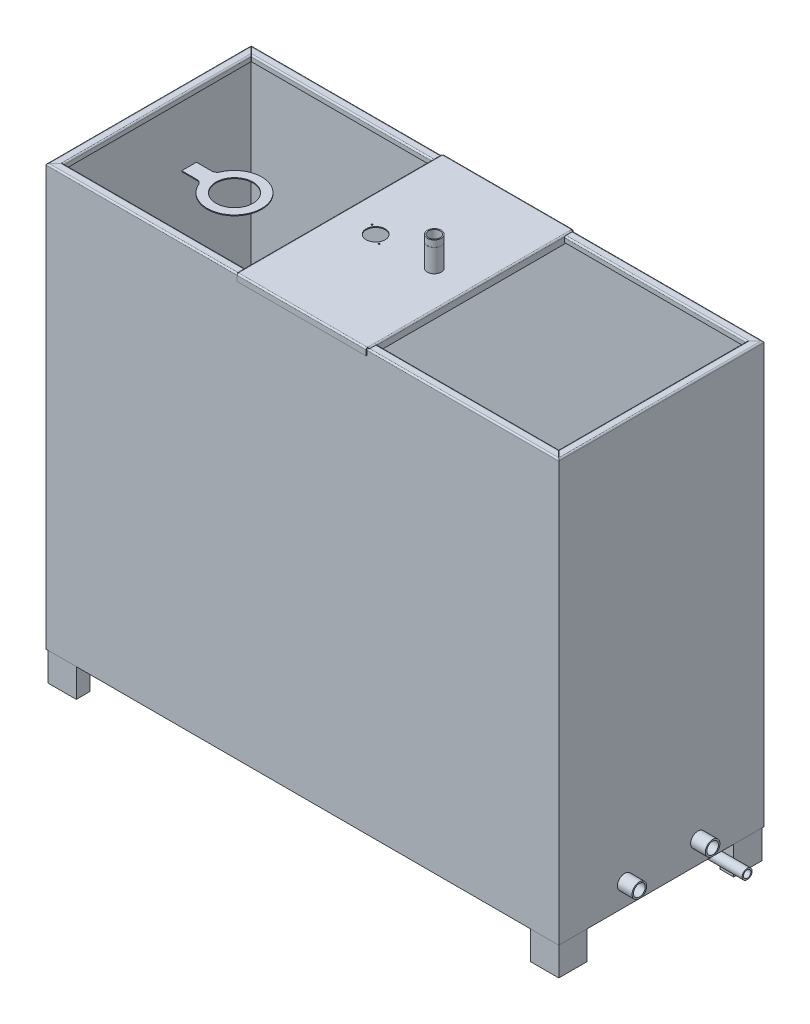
ISO-10303-21;
HEADER;
FILE_DESCRIPTION(('STEP AP214'),'2;1');
FILE_NAME('part.step','',(''),(''),'','','');
FILE_SCHEMA(('AUTOMOTIVE_DESIGN { 1 0 10303 214 1 1 1 1 }'));
ENDSEC;
DATA;
#1=APPLICATION_CONTEXT('core data for automotive mechanical design processes');
#2=APPLICATION_PROTOCOL_DEFINITION('international standard','automotive_design',2000,#1);
#3=PRODUCT_CONTEXT('',#1,'mechanical');
#4=PRODUCT('Part','Part','',(#3));
#5=PRODUCT_RELATED_PRODUCT_CATEGORY('part','',(#4));
#6=PRODUCT_DEFINITION_FORMATION('','',#4);
#7=PRODUCT_DEFINITION_CONTEXT('part definition',#1,'design');
#8=PRODUCT_DEFINITION('design','',#6,#7);
#9=PRODUCT_DEFINITION_SHAPE('','',#8);
#10=(LENGTH_UNIT() NAMED_UNIT(*) SI_UNIT(.MILLI.,.METRE.));
#11=(NAMED_UNIT(*) PLANE_ANGLE_UNIT() SI_UNIT($,.RADIAN.));
#12=(NAMED_UNIT(*) SI_UNIT($,.STERADIAN.) SOLID_ANGLE_UNIT());
#13=UNCERTAINTY_MEASURE_WITH_UNIT(LENGTH_MEASURE(1.E-05),#10,'distance_accuracy_value','');
#14=(GEOMETRIC_REPRESENTATION_CONTEXT(3) GLOBAL_UNCERTAINTY_ASSIGNED_CONTEXT((#13)) GLOBAL_UNIT_ASSIGNED_CONTEXT((#10,
#11,#12)) REPRESENTATION_CONTEXT('',''));
#15=CARTESIAN_POINT('',(0.,0.,0.));
#16=DIRECTION('',(0.,0.,1.));
#17=DIRECTION('',(1.,0.,0.));
#18=AXIS2_PLACEMENT_3D('',#15,#16,#17);
#19=CARTESIAN_POINT('',(-925.,93.,0.));
#20=DIRECTION('',(1.,0.,0.));
#21=DIRECTION('',(0.,0.,-1.));
#22=AXIS2_PLACEMENT_3D('',#19,#20,#21);
#23=CYLINDRICAL_SURFACE('',#22,30.);
#24=CARTESIAN_POINT('',(-872.,93.,0.));
#25=DIRECTION('',(1.,0.,0.));
#26=DIRECTION('',(0.,0.,-1.));
#27=AXIS2_PLACEMENT_3D('',#24,#25,#26);
#28=CIRCLE('',#27,30.);
#29=CARTESIAN_POINT('',(-872.,93.,-30.));
#30=VERTEX_POINT('',#29);
#31=EDGE_CURVE('E1646',#30,#30,#28,.T.);
#32=ORIENTED_EDGE('',*,*,#31,.T.);
#33=EDGE_LOOP('',(#32));
#34=FACE_BOUND('',#33,.T.);
#35=CARTESIAN_POINT('',(-852.,93.,0.));
#36=DIRECTION('',(-1.,0.,0.));
#37=DIRECTION('',(0.,0.,1.));
#38=AXIS2_PLACEMENT_3D('',#35,#36,#37);
#39=CIRCLE('',#38,30.);
#40=CARTESIAN_POINT('',(-852.,123.,0.));
#41=VERTEX_POINT('',#40);
#42=EDGE_CURVE('E1652',#41,#41,#39,.T.);
#43=ORIENTED_EDGE('',*,*,#42,.T.);
#44=EDGE_LOOP('',(#43));
#45=FACE_BOUND('',#44,.T.);
#46=ADVANCED_FACE('F47',(#34,#45),#23,.T.);
#47=CARTESIAN_POINT('',(-925.,93.,0.));
#48=DIRECTION('',(1.,0.,0.));
#49=DIRECTION('',(0.,0.,-1.));
#50=AXIS2_PLACEMENT_3D('',#47,#48,#49);
#51=CYLINDRICAL_SURFACE('',#50,25.);
#52=CARTESIAN_POINT('',(-872.,93.,0.));
#53=DIRECTION('',(1.,0.,0.));
#54=DIRECTION('',(0.,0.,-1.));
#55=AXIS2_PLACEMENT_3D('',#52,#53,#54);
#56=CIRCLE('',#55,25.);
#57=CARTESIAN_POINT('',(-872.,93.,-25.));
#58=VERTEX_POINT('',#57);
#59=EDGE_CURVE('E50',#58,#58,#56,.T.);
#60=ORIENTED_EDGE('',*,*,#59,.F.);
#61=EDGE_LOOP('',(#60));
#62=FACE_BOUND('',#61,.T.);
#63=CARTESIAN_POINT('',(-852.,93.,0.));
#64=DIRECTION('',(-1.,0.,0.));
#65=DIRECTION('',(0.,0.,1.));
#66=AXIS2_PLACEMENT_3D('',#63,#64,#65);
#67=CIRCLE('',#66,25.);
#68=CARTESIAN_POINT('',(-852.,118.,0.));
#69=VERTEX_POINT('',#68);
#70=EDGE_CURVE('E1649',#69,#69,#67,.T.);
#71=ORIENTED_EDGE('',*,*,#70,.F.);
#72=EDGE_LOOP('',(#71));
#73=FACE_BOUND('',#72,.T.);
#74=ADVANCED_FACE('F1688',(#62,#73),#51,.F.);
#75=CARTESIAN_POINT('',(-802.,43.,0.));
#76=DIRECTION('',(0.,-1.,0.));
#77=DIRECTION('',(0.,0.,-1.));
#78=AXIS2_PLACEMENT_3D('',#75,#76,#77);
#79=CYLINDRICAL_SURFACE('',#78,30.);
#80=CARTESIAN_POINT('',(-802.,43.,0.));
#81=DIRECTION('',(0.,1.,0.));
#82=DIRECTION('',(0.,0.,1.));
#83=AXIS2_PLACEMENT_3D('',#80,#81,#82);
#84=CIRCLE('',#83,30.);
#85=CARTESIAN_POINT('',(-772.,43.0000000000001,0.));
#86=VERTEX_POINT('',#85);
#87=EDGE_CURVE('E1658',#86,#86,#84,.T.);
#88=ORIENTED_EDGE('',*,*,#87,.F.);
#89=EDGE_LOOP('',(#88));
#90=FACE_BOUND('',#89,.T.);
#91=CARTESIAN_POINT('',(-802.,23.,0.));
#92=DIRECTION('',(0.,1.,0.));
#93=DIRECTION('',(0.,0.,1.));
#94=AXIS2_PLACEMENT_3D('',#91,#92,#93);
#95=CIRCLE('',#94,30.);
#96=CARTESIAN_POINT('',(-802.,23.,30.));
#97=VERTEX_POINT('',#96);
#98=EDGE_CURVE('E1664',#97,#97,#95,.T.);
#99=ORIENTED_EDGE('',*,*,#98,.T.);
#100=EDGE_LOOP('',(#99));
#101=FACE_BOUND('',#100,.T.);
#102=ADVANCED_FACE('F1705',(#90,#101),#79,.T.);
#103=CARTESIAN_POINT('',(-802.,43.,0.));
#104=DIRECTION('',(0.,-1.,0.));
#105=DIRECTION('',(0.,0.,-1.));
#106=AXIS2_PLACEMENT_3D('',#103,#104,#105);
#107=CYLINDRICAL_SURFACE('',#106,25.);
#108=CARTESIAN_POINT('',(-802.,43.,0.));
#109=DIRECTION('',(0.,1.,0.));
#110=DIRECTION('',(0.,0.,1.));
#111=AXIS2_PLACEMENT_3D('',#108,#109,#110);
#112=CIRCLE('',#111,25.);
#113=CARTESIAN_POINT('',(-777.,43.0000000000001,0.));
#114=VERTEX_POINT('',#113);
#115=EDGE_CURVE('E1655',#114,#114,#112,.T.);
#116=ORIENTED_EDGE('',*,*,#115,.T.);
#117=EDGE_LOOP('',(#116));
#118=FACE_BOUND('',#117,.T.);
#119=CARTESIAN_POINT('',(-802.,23.,0.));
#120=DIRECTION('',(0.,1.,0.));
#121=DIRECTION('',(0.,0.,1.));
#122=AXIS2_PLACEMENT_3D('',#119,#120,#121);
#123=CIRCLE('',#122,25.);
#124=CARTESIAN_POINT('',(-802.,23.,25.));
#125=VERTEX_POINT('',#124);
#126=EDGE_CURVE('E1661',#125,#125,#123,.T.);
#127=ORIENTED_EDGE('',*,*,#126,.F.);
#128=EDGE_LOOP('',(#127));
#129=FACE_BOUND('',#128,.T.);
#130=ADVANCED_FACE('F3458',(#118,#129),#107,.F.);
#131=CARTESIAN_POINT('',(-852.,43.,0.));
#132=DIRECTION('',(0.,0.,-1.));
#133=DIRECTION('',(-1.,0.,0.));
#134=AXIS2_PLACEMENT_3D('',#131,#132,#133);
#135=TOROIDAL_SURFACE('',#134,50.,30.);
#136=CARTESIAN_POINT('',(-852.,43.,0.));
#137=DIRECTION('',(0.,0.,-1.));
#138=DIRECTION('',(-1.,0.,0.));
#139=AXIS2_PLACEMENT_3D('',#136,#137,#138);
#140=CIRCLE('',#139,80.);
#141=EDGE_CURVE('',#41,#86,#140,.T.);
#142=ORIENTED_EDGE('',*,*,#42,.F.);
#143=ORIENTED_EDGE('',*,*,#87,.T.);
#144=ORIENTED_EDGE('',*,*,#141,.T.);
#145=ORIENTED_EDGE('',*,*,#141,.F.);
#146=EDGE_LOOP('',(#142,#144,#143,#145));
#147=FACE_BOUND('',#146,.T.);
#148=ADVANCED_FACE('F3454',(#147),#135,.T.);
#149=CARTESIAN_POINT('',(-852.,43.,0.));
#150=DIRECTION('',(0.,0.,-1.));
#151=DIRECTION('',(-1.,0.,0.));
#152=AXIS2_PLACEMENT_3D('',#149,#150,#151);
#153=TOROIDAL_SURFACE('',#152,50.,25.);
#154=CARTESIAN_POINT('',(-852.,43.,0.));
#155=DIRECTION('',(0.,0.,-1.));
#156=DIRECTION('',(-1.,0.,0.));
#157=AXIS2_PLACEMENT_3D('',#154,#155,#156);
#158=CIRCLE('',#157,75.);
#159=EDGE_CURVE('',#69,#114,#158,.T.);
#160=ORIENTED_EDGE('',*,*,#70,.T.);
#161=ORIENTED_EDGE('',*,*,#115,.F.);
#162=ORIENTED_EDGE('',*,*,#159,.T.);
#163=ORIENTED_EDGE('',*,*,#159,.F.);
#164=EDGE_LOOP('',(#160,#162,#161,#163));
#165=FACE_BOUND('',#164,.T.);
#166=ADVANCED_FACE('F3450',(#165),#153,.F.);
#167=CARTESIAN_POINT('',(-802.,23.,0.));
#168=DIRECTION('',(0.,1.,0.));
#169=DIRECTION('',(0.,0.,1.));
#170=AXIS2_PLACEMENT_3D('',#167,#168,#169);
#171=PLANE('',#170);
#172=ORIENTED_EDGE('',*,*,#126,.T.);
#173=EDGE_LOOP('',(#172));
#174=FACE_BOUND('',#173,.T.);
#175=ORIENTED_EDGE('',*,*,#98,.F.);
#176=EDGE_LOOP('',(#175));
#177=FACE_BOUND('',#176,.T.);
#178=ADVANCED_FACE('F2166',(#174,#177),#171,.F.);
#179=CARTESIAN_POINT('',(-872.,0.,350.));
#180=DIRECTION('',(1.,0.,0.));
#181=DIRECTION('',(0.,0.,-1.));
#182=AXIS2_PLACEMENT_3D('',#179,#180,#181);
#183=PLANE('',#182);
#184=ORIENTED_EDGE('',*,*,#59,.T.);
#185=EDGE_LOOP('',(#184));
#186=FACE_BOUND('',#185,.T.);
#187=ADVANCED_FACE('F2163',(#186),#183,.T.);
#188=DIRECTION('',(0.,1.,0.));
#189=VECTOR('',#188,1.);
#190=CARTESIAN_POINT('',(-872.,1183.,-160.));
#191=LINE('',#190,#189);
#192=CARTESIAN_POINT('',(-872.,1183.,-160.));
#193=VERTEX_POINT('',#192);
#194=CARTESIAN_POINT('',(-872.,1186.,-160.));
#195=VERTEX_POINT('',#194);
#196=EDGE_CURVE('E1375',#193,#195,#191,.T.);
#197=ORIENTED_EDGE('',*,*,#196,.F.);
#198=DIRECTION('',(0.,0.,1.));
#199=VECTOR('',#198,1.);
#200=CARTESIAN_POINT('',(-872.,1183.,-110.));
#201=LINE('',#200,#199);
#202=CARTESIAN_POINT('',(-872.,1183.,-110.));
#203=VERTEX_POINT('',#202);
#204=EDGE_CURVE('E1338',#193,#203,#201,.T.);
#205=ORIENTED_EDGE('',*,*,#204,.T.);
#206=DIRECTION('',(0.,1.,0.));
#207=VECTOR('',#206,1.);
#208=CARTESIAN_POINT('',(-872.,1183.,-110.));
#209=LINE('',#208,#207);
#210=CARTESIAN_POINT('',(-872.,1186.,-110.));
#211=VERTEX_POINT('',#210);
#212=EDGE_CURVE('E1373',#203,#211,#209,.T.);
#213=ORIENTED_EDGE('',*,*,#212,.T.);
#214=DIRECTION('',(0.,0.,1.));
#215=VECTOR('',#214,1.);
#216=CARTESIAN_POINT('',(-872.,1186.,-110.));
#217=LINE('',#216,#215);
#218=EDGE_CURVE('E1355',#195,#211,#217,.T.);
#219=ORIENTED_EDGE('',*,*,#218,.F.);
#220=EDGE_LOOP('',(#197,#205,#213,#219));
#221=FACE_BOUND('',#220,.T.);
#222=DIRECTION('',(0.,1.,0.));
#223=VECTOR('',#222,1.);
#224=CARTESIAN_POINT('',(-872.,820.,-110.));
#225=LINE('',#224,#223);
#226=CARTESIAN_POINT('',(-872.,820.,-110.));
#227=VERTEX_POINT('',#226);
#228=CARTESIAN_POINT('',(-872.,823.,-110.));
#229=VERTEX_POINT('',#228);
#230=EDGE_CURVE('E1313',#227,#229,#225,.T.);
#231=ORIENTED_EDGE('',*,*,#230,.T.);
#232=DIRECTION('',(0.,0.,1.));
#233=VECTOR('',#232,1.);
#234=CARTESIAN_POINT('',(-872.,823.,-110.));
#235=LINE('',#234,#233);
#236=CARTESIAN_POINT('',(-872.,823.,-160.));
#237=VERTEX_POINT('',#236);
#238=EDGE_CURVE('E1269',#237,#229,#235,.T.);
#239=ORIENTED_EDGE('',*,*,#238,.F.);
#240=DIRECTION('',(0.,1.,0.));
#241=VECTOR('',#240,1.);
#242=CARTESIAN_POINT('',(-872.,820.,-160.));
#243=LINE('',#242,#241);
#244=CARTESIAN_POINT('',(-872.,820.,-160.));
#245=VERTEX_POINT('',#244);
#246=EDGE_CURVE('E1296',#245,#237,#243,.T.);
#247=ORIENTED_EDGE('',*,*,#246,.F.);
#248=DIRECTION('',(0.,0.,1.));
#249=VECTOR('',#248,1.);
#250=CARTESIAN_POINT('',(-872.,820.,-110.));
#251=LINE('',#250,#249);
#252=EDGE_CURVE('E1311',#245,#227,#251,.T.);
#253=ORIENTED_EDGE('',*,*,#252,.T.);
#254=EDGE_LOOP('',(#231,#239,#247,#253));
#255=FACE_BOUND('',#254,.T.);
#256=CARTESIAN_POINT('',(-872.,650.,-135.));
#257=DIRECTION('',(1.,0.,0.));
#258=DIRECTION('',(0.,0.,-1.));
#259=AXIS2_PLACEMENT_3D('',#256,#257,#258);
#260=CIRCLE('',#259,62.5000000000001);
#261=CARTESIAN_POINT('',(-872.,650.,-197.5));
#262=VERTEX_POINT('',#261);
#263=EDGE_CURVE('E1264',#262,#262,#260,.T.);
#264=ORIENTED_EDGE('',*,*,#263,.F.);
#265=EDGE_LOOP('',(#264));
#266=FACE_BOUND('',#265,.T.);
#267=DIRECTION('',(0.,0.,-1.));
#268=VECTOR('',#267,1.);
#269=CARTESIAN_POINT('',(-872.,1433.,350.));
#270=LINE('',#269,#268);
#271=CARTESIAN_POINT('',(-872.,1433.,347.));
#272=VERTEX_POINT('',#271);
#273=CARTESIAN_POINT('',(-872.,1433.,-347.));
#274=VERTEX_POINT('',#273);
#275=EDGE_CURVE('E910',#272,#274,#270,.T.);
#276=ORIENTED_EDGE('',*,*,#275,.F.);
#277=DIRECTION('',(0.,-1.,0.));
#278=VECTOR('',#277,1.);
#279=CARTESIAN_POINT('',(-872.,0.,347.));
#280=LINE('',#279,#278);
#281=CARTESIAN_POINT('',(-872.,3.,347.));
#282=VERTEX_POINT('',#281);
#283=EDGE_CURVE('E1386',#272,#282,#280,.T.);
#284=ORIENTED_EDGE('',*,*,#283,.T.);
#285=DIRECTION('',(0.,0.,-1.));
#286=VECTOR('',#285,1.);
#287=CARTESIAN_POINT('',(-872.,3.,350.));
#288=LINE('',#287,#286);
#289=CARTESIAN_POINT('',(-872.,3.,-347.));
#290=VERTEX_POINT('',#289);
#291=EDGE_CURVE('E1381',#282,#290,#288,.T.);
#292=ORIENTED_EDGE('',*,*,#291,.T.);
#293=DIRECTION('',(0.,-1.,0.));
#294=VECTOR('',#293,1.);
#295=CARTESIAN_POINT('',(-872.,0.,-347.));
#296=LINE('',#295,#294);
#297=EDGE_CURVE('E1368',#274,#290,#296,.T.);
#298=ORIENTED_EDGE('',*,*,#297,.F.);
#299=EDGE_LOOP('',(#276,#284,#292,#298));
#300=FACE_BOUND('',#299,.T.);
#301=ORIENTED_EDGE('',*,*,#31,.F.);
#302=EDGE_LOOP('',(#301));
#303=FACE_BOUND('',#302,.T.);
#304=ADVANCED_FACE('F1693',(#221,#255,#266,#300,#303),#183,.T.);
#305=CARTESIAN_POINT('',(-875.,0.,350.));
#306=DIRECTION('',(1.,0.,0.));
#307=DIRECTION('',(0.,0.,-1.));
#308=AXIS2_PLACEMENT_3D('',#305,#306,#307);
#309=PLANE('',#308);
#310=CARTESIAN_POINT('',(-875.,650.,-135.));
#311=DIRECTION('',(1.,0.,0.));
#312=DIRECTION('',(0.,0.,-1.));
#313=AXIS2_PLACEMENT_3D('',#310,#311,#312);
#314=CIRCLE('',#313,62.5000000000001);
#315=CARTESIAN_POINT('',(-875.,650.,-197.5));
#316=VERTEX_POINT('',#315);
#317=EDGE_CURVE('E1263',#316,#316,#314,.T.);
#318=ORIENTED_EDGE('',*,*,#317,.T.);
#319=EDGE_LOOP('',(#318));
#320=FACE_BOUND('',#319,.T.);
#321=DIRECTION('',(0.,-1.,0.));
#322=VECTOR('',#321,1.);
#323=CARTESIAN_POINT('',(-875.,0.,350.));
#324=LINE('',#323,#322);
#325=CARTESIAN_POINT('',(-875.,1431.,350.));
#326=VERTEX_POINT('',#325);
#327=CARTESIAN_POINT('',(-875.,0.,350.));
#328=VERTEX_POINT('',#327);
#329=EDGE_CURVE('E1402',#326,#328,#324,.T.);
#330=ORIENTED_EDGE('',*,*,#329,.F.);
#331=DIRECTION('',(0.,0.,-1.));
#332=VECTOR('',#331,1.);
#333=CARTESIAN_POINT('',(-875.,1431.,350.));
#334=LINE('',#333,#332);
#335=CARTESIAN_POINT('',(-875.,1431.,-350.));
#336=VERTEX_POINT('',#335);
#337=EDGE_CURVE('E1569',#326,#336,#334,.T.);
#338=ORIENTED_EDGE('',*,*,#337,.T.);
#339=DIRECTION('',(0.,-1.,0.));
#340=VECTOR('',#339,1.);
#341=CARTESIAN_POINT('',(-875.,0.,-350.));
#342=LINE('',#341,#340);
#343=CARTESIAN_POINT('',(-875.,0.,-350.));
#344=VERTEX_POINT('',#343);
#345=EDGE_CURVE('E1384',#336,#344,#342,.T.);
#346=ORIENTED_EDGE('',*,*,#345,.T.);
#347=DIRECTION('',(0.,0.,-1.));
#348=VECTOR('',#347,1.);
#349=CARTESIAN_POINT('',(-875.,0.,350.));
#350=LINE('',#349,#348);
#351=EDGE_CURVE('E1418',#328,#344,#350,.T.);
#352=ORIENTED_EDGE('',*,*,#351,.F.);
#353=EDGE_LOOP('',(#330,#338,#346,#352));
#354=FACE_BOUND('',#353,.T.);
#355=CARTESIAN_POINT('',(-875.,93.,0.));
#356=DIRECTION('',(1.,0.,0.));
#357=DIRECTION('',(0.,0.,-1.));
#358=AXIS2_PLACEMENT_3D('',#355,#356,#357);
#359=CIRCLE('',#358,30.);
#360=CARTESIAN_POINT('',(-875.,93.,-30.));
#361=VERTEX_POINT('',#360);
#362=EDGE_CURVE('E14',#361,#361,#359,.T.);
#363=ORIENTED_EDGE('',*,*,#362,.T.);
#364=EDGE_LOOP('',(#363));
#365=FACE_BOUND('',#364,.T.);
#366=ADVANCED_FACE('F1680',(#320,#354,#365),#309,.F.);
#367=CARTESIAN_POINT('',(-875.,1436.,350.));
#368=DIRECTION('',(0.,-1.,0.));
#369=DIRECTION('',(0.,0.,-1.));
#370=AXIS2_PLACEMENT_3D('',#367,#368,#369);
#371=PLANE('',#370);
#372=DIRECTION('',(1.,0.,0.));
#373=VECTOR('',#372,1.);
#374=CARTESIAN_POINT('',(845.,1436.,-325.));
#375=LINE('',#374,#373);
#376=CARTESIAN_POINT('',(225.,1436.,-325.));
#377=VERTEX_POINT('',#376);
#378=CARTESIAN_POINT('',(849.646446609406,1436.,-325.));
#379=VERTEX_POINT('',#378);
#380=EDGE_CURVE('E1514',#377,#379,#375,.T.);
#381=ORIENTED_EDGE('',*,*,#380,.T.);
#382=DIRECTION('',(-0.707106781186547,0.,0.707106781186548));
#383=VECTOR('',#382,1.);
#384=CARTESIAN_POINT('',(869.823223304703,1436.,-345.176776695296));
#385=LINE('',#384,#383);
#386=CARTESIAN_POINT('',(869.646446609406,1436.,-345.));
#387=VERTEX_POINT('',#386);
#388=EDGE_CURVE('E779',#387,#379,#385,.T.);
#389=ORIENTED_EDGE('',*,*,#388,.F.);
#390=DIRECTION('',(-1.,0.,0.));
#391=VECTOR('',#390,1.);
#392=CARTESIAN_POINT('',(220.,1436.,-345.));
#393=LINE('',#392,#391);
#394=CARTESIAN_POINT('',(225.,1436.,-345.));
#395=VERTEX_POINT('',#394);
#396=EDGE_CURVE('E1521',#387,#395,#393,.T.);
#397=ORIENTED_EDGE('',*,*,#396,.T.);
#398=DIRECTION('',(0.,0.,1.));
#399=VECTOR('',#398,1.);
#400=CARTESIAN_POINT('',(225.,1436.,-350.));
#401=LINE('',#400,#399);
#402=EDGE_CURVE('E839',#395,#377,#401,.T.);
#403=ORIENTED_EDGE('',*,*,#402,.T.);
#404=EDGE_LOOP('',(#381,#389,#397,#403));
#405=FACE_BOUND('',#404,.T.);
#406=ADVANCED_FACE('F1692',(#405),#371,.F.);
#407=CARTESIAN_POINT('',(0.,1417.,0.));
#408=DIRECTION('',(0.,1.,0.));
#409=DIRECTION('',(0.,0.,1.));
#410=AXIS2_PLACEMENT_3D('',#407,#408,#409);
#411=PLANE('',#410);
#412=DIRECTION('',(-1.,0.,0.));
#413=VECTOR('',#412,1.);
#414=CARTESIAN_POINT('',(848.,1417.,-323.));
#415=LINE('',#414,#413);
#416=CARTESIAN_POINT('',(847.646446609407,1417.,-323.));
#417=VERTEX_POINT('',#416);
#418=CARTESIAN_POINT('',(225.,1417.,-323.));
#419=VERTEX_POINT('',#418);
#420=EDGE_CURVE('E2283',#417,#419,#415,.T.);
#421=ORIENTED_EDGE('',*,*,#420,.F.);
#422=DIRECTION('',(-0.707106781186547,0.,0.707106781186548));
#423=VECTOR('',#422,1.);
#424=CARTESIAN_POINT('',(869.823223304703,1417.,-345.176776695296));
#425=LINE('',#424,#423);
#426=CARTESIAN_POINT('',(844.646446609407,1417.,-320.));
#427=VERTEX_POINT('',#426);
#428=EDGE_CURVE('E778',#417,#427,#425,.T.);
#429=ORIENTED_EDGE('',*,*,#428,.T.);
#430=DIRECTION('',(1.,0.,0.));
#431=VECTOR('',#430,1.);
#432=CARTESIAN_POINT('',(225.,1417.,-320.));
#433=LINE('',#432,#431);
#434=CARTESIAN_POINT('',(225.,1417.,-320.));
#435=VERTEX_POINT('',#434);
#436=EDGE_CURVE('E795',#435,#427,#433,.T.);
#437=ORIENTED_EDGE('',*,*,#436,.F.);
#438=DIRECTION('',(0.,0.,1.));
#439=VECTOR('',#438,1.);
#440=CARTESIAN_POINT('',(225.,1417.,-323.));
#441=LINE('',#440,#439);
#442=EDGE_CURVE('E800',#419,#435,#441,.T.);
#443=ORIENTED_EDGE('',*,*,#442,.F.);
#444=EDGE_LOOP('',(#421,#429,#437,#443));
#445=FACE_BOUND('',#444,.T.);
#446=ADVANCED_FACE('F1773',(#445),#411,.F.);
#447=DIRECTION('',(0.,0.,-1.));
#448=VECTOR('',#447,1.);
#449=CARTESIAN_POINT('',(870.,1436.,350.));
#450=LINE('',#449,#448);
#451=CARTESIAN_POINT('',(870.,1436.,344.646446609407));
#452=VERTEX_POINT('',#451);
#453=CARTESIAN_POINT('',(870.,1436.,-344.646446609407));
#454=VERTEX_POINT('',#453);
#455=EDGE_CURVE('E1523',#452,#454,#450,.T.);
#456=ORIENTED_EDGE('',*,*,#455,.T.);
#457=DIRECTION('',(0.707106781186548,0.,-0.707106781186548));
#458=VECTOR('',#457,1.);
#459=CARTESIAN_POINT('',(845.,1436.,-319.646446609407));
#460=LINE('',#459,#458);
#461=CARTESIAN_POINT('',(850.,1436.,-324.646446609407));
#462=VERTEX_POINT('',#461);
#463=EDGE_CURVE('E2595',#462,#454,#460,.T.);
#464=ORIENTED_EDGE('',*,*,#463,.F.);
#465=DIRECTION('',(0.,0.,1.));
#466=VECTOR('',#465,1.);
#467=CARTESIAN_POINT('',(850.,1436.,320.));
#468=LINE('',#467,#466);
#469=CARTESIAN_POINT('',(850.,1436.,324.646446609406));
#470=VERTEX_POINT('',#469);
#471=EDGE_CURVE('E1517',#462,#470,#468,.T.);
#472=ORIENTED_EDGE('',*,*,#471,.T.);
#473=DIRECTION('',(-0.707106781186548,0.,-0.707106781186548));
#474=VECTOR('',#473,1.);
#475=CARTESIAN_POINT('',(845.,1436.,319.646446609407));
#476=LINE('',#475,#474);
#477=EDGE_CURVE('E2389',#452,#470,#476,.T.);
#478=ORIENTED_EDGE('',*,*,#477,.F.);
#479=EDGE_LOOP('',(#456,#464,#472,#478));
#480=FACE_BOUND('',#479,.T.);
#481=ADVANCED_FACE('F2592',(#480),#371,.F.);
#482=DIRECTION('',(0.,0.,1.));
#483=VECTOR('',#482,1.);
#484=CARTESIAN_POINT('',(845.,1417.,-320.));
#485=LINE('',#484,#483);
#486=CARTESIAN_POINT('',(845.,1417.,-319.646446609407));
#487=VERTEX_POINT('',#486);
#488=CARTESIAN_POINT('',(845.,1417.,319.646446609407));
#489=VERTEX_POINT('',#488);
#490=EDGE_CURVE('E785',#487,#489,#485,.T.);
#491=ORIENTED_EDGE('',*,*,#490,.F.);
#492=DIRECTION('',(0.707106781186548,0.,-0.707106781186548));
#493=VECTOR('',#492,1.);
#494=CARTESIAN_POINT('',(845.,1417.,-319.646446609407));
#495=LINE('',#494,#493);
#496=CARTESIAN_POINT('',(848.,1417.,-322.646446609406));
#497=VERTEX_POINT('',#496);
#498=EDGE_CURVE('E770',#487,#497,#495,.T.);
#499=ORIENTED_EDGE('',*,*,#498,.T.);
#500=DIRECTION('',(0.,0.,-1.));
#501=VECTOR('',#500,1.);
#502=CARTESIAN_POINT('',(848.,1417.,323.));
#503=LINE('',#502,#501);
#504=CARTESIAN_POINT('',(848.,1417.,322.646446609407));
#505=VERTEX_POINT('',#504);
#506=EDGE_CURVE('E1615',#505,#497,#503,.T.);
#507=ORIENTED_EDGE('',*,*,#506,.F.);
#508=DIRECTION('',(-0.707106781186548,0.,-0.707106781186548));
#509=VECTOR('',#508,1.);
#510=CARTESIAN_POINT('',(845.,1417.,319.646446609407));
#511=LINE('',#510,#509);
#512=EDGE_CURVE('E793',#505,#489,#511,.T.);
#513=ORIENTED_EDGE('',*,*,#512,.T.);
#514=EDGE_LOOP('',(#491,#499,#507,#513));
#515=FACE_BOUND('',#514,.T.);
#516=ADVANCED_FACE('F792',(#515),#411,.F.);
#517=DIRECTION('',(-1.,0.,0.));
#518=VECTOR('',#517,1.);
#519=CARTESIAN_POINT('',(-845.,1436.,325.));
#520=LINE('',#519,#518);
#521=CARTESIAN_POINT('',(-225.,1436.,325.));
#522=VERTEX_POINT('',#521);
#523=CARTESIAN_POINT('',(-849.646446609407,1436.,325.));
#524=VERTEX_POINT('',#523);
#525=EDGE_CURVE('E1553',#522,#524,#520,.T.);
#526=ORIENTED_EDGE('',*,*,#525,.T.);
#527=DIRECTION('',(0.707106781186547,0.,-0.707106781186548));
#528=VECTOR('',#527,1.);
#529=CARTESIAN_POINT('',(-869.823223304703,1436.,345.176776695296));
#530=LINE('',#529,#528);
#531=CARTESIAN_POINT('',(-869.646446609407,1436.,345.));
#532=VERTEX_POINT('',#531);
#533=EDGE_CURVE('E2427',#532,#524,#530,.T.);
#534=ORIENTED_EDGE('',*,*,#533,.F.);
#535=DIRECTION('',(-1.,0.,0.));
#536=VECTOR('',#535,1.);
#537=CARTESIAN_POINT('',(-875.,1436.,345.));
#538=LINE('',#537,#536);
#539=CARTESIAN_POINT('',(-225.,1436.,345.));
#540=VERTEX_POINT('',#539);
#541=EDGE_CURVE('E1556',#532,#540,#538,.F.);
#542=ORIENTED_EDGE('',*,*,#541,.T.);
#543=DIRECTION('',(0.,0.,-1.));
#544=VECTOR('',#543,1.);
#545=CARTESIAN_POINT('',(-225.,1436.,320.));
#546=LINE('',#545,#544);
#547=EDGE_CURVE('E879',#540,#522,#546,.T.);
#548=ORIENTED_EDGE('',*,*,#547,.T.);
#549=EDGE_LOOP('',(#526,#534,#542,#548));
#550=FACE_BOUND('',#549,.T.);
#551=ADVANCED_FACE('F2524',(#550),#371,.F.);
#552=CARTESIAN_POINT('',(0.,1417.,0.));
#553=DIRECTION('',(0.,-1.,0.));
#554=DIRECTION('',(0.,0.,-1.));
#555=AXIS2_PLACEMENT_3D('',#552,#553,#554);
#556=PLANE('',#555);
#557=DIRECTION('',(0.707106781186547,0.,-0.707106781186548));
#558=VECTOR('',#557,1.);
#559=CARTESIAN_POINT('',(-869.823223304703,1417.,345.176776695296));
#560=LINE('',#559,#558);
#561=CARTESIAN_POINT('',(-847.646446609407,1417.,323.));
#562=VERTEX_POINT('',#561);
#563=CARTESIAN_POINT('',(-844.646446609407,1417.,320.));
#564=VERTEX_POINT('',#563);
#565=EDGE_CURVE('E2426',#562,#564,#560,.T.);
#566=ORIENTED_EDGE('',*,*,#565,.T.);
#567=DIRECTION('',(-1.,0.,0.));
#568=VECTOR('',#567,1.);
#569=CARTESIAN_POINT('',(-845.,1417.,320.));
#570=LINE('',#569,#568);
#571=CARTESIAN_POINT('',(-225.,1417.,320.));
#572=VERTEX_POINT('',#571);
#573=EDGE_CURVE('E826',#572,#564,#570,.T.);
#574=ORIENTED_EDGE('',*,*,#573,.F.);
#575=DIRECTION('',(0.,0.,-1.));
#576=VECTOR('',#575,1.);
#577=CARTESIAN_POINT('',(-225.,1417.,320.));
#578=LINE('',#577,#576);
#579=CARTESIAN_POINT('',(-225.,1417.,323.));
#580=VERTEX_POINT('',#579);
#581=EDGE_CURVE('E823',#580,#572,#578,.T.);
#582=ORIENTED_EDGE('',*,*,#581,.F.);
#583=DIRECTION('',(1.,0.,0.));
#584=VECTOR('',#583,1.);
#585=CARTESIAN_POINT('',(-225.,1417.,323.));
#586=LINE('',#585,#584);
#587=EDGE_CURVE('E821',#562,#580,#586,.T.);
#588=ORIENTED_EDGE('',*,*,#587,.F.);
#589=EDGE_LOOP('',(#566,#574,#582,#588));
#590=FACE_BOUND('',#589,.T.);
#591=ADVANCED_FACE('F1790',(#590),#556,.T.);
#592=DIRECTION('',(0.,0.,-1.));
#593=VECTOR('',#592,1.);
#594=CARTESIAN_POINT('',(-870.,1436.,350.));
#595=LINE('',#594,#593);
#596=CARTESIAN_POINT('',(-870.,1436.,-344.646446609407));
#597=VERTEX_POINT('',#596);
#598=CARTESIAN_POINT('',(-870.,1436.,344.646446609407));
#599=VERTEX_POINT('',#598);
#600=EDGE_CURVE('E1558',#597,#599,#595,.F.);
#601=ORIENTED_EDGE('',*,*,#600,.T.);
#602=DIRECTION('',(-0.707106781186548,0.,0.707106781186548));
#603=VECTOR('',#602,1.);
#604=CARTESIAN_POINT('',(-845.,1436.,319.646446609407));
#605=LINE('',#604,#603);
#606=CARTESIAN_POINT('',(-850.,1436.,324.646446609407));
#607=VERTEX_POINT('',#606);
#608=EDGE_CURVE('E2422',#607,#599,#605,.T.);
#609=ORIENTED_EDGE('',*,*,#608,.F.);
#610=DIRECTION('',(0.,0.,-1.));
#611=VECTOR('',#610,1.);
#612=CARTESIAN_POINT('',(-850.,1436.,-320.));
#613=LINE('',#612,#611);
#614=CARTESIAN_POINT('',(-850.,1436.,-324.646446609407));
#615=VERTEX_POINT('',#614);
#616=EDGE_CURVE('E1551',#607,#615,#613,.T.);
#617=ORIENTED_EDGE('',*,*,#616,.T.);
#618=DIRECTION('',(0.707106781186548,0.,0.707106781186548));
#619=VECTOR('',#618,1.);
#620=CARTESIAN_POINT('',(-845.,1436.,-319.646446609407));
#621=LINE('',#620,#619);
#622=EDGE_CURVE('E2459',#597,#615,#621,.T.);
#623=ORIENTED_EDGE('',*,*,#622,.F.);
#624=EDGE_LOOP('',(#601,#609,#617,#623));
#625=FACE_BOUND('',#624,.T.);
#626=ADVANCED_FACE('F2570',(#625),#371,.F.);
#627=DIRECTION('',(-0.707106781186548,0.,0.707106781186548));
#628=VECTOR('',#627,1.);
#629=CARTESIAN_POINT('',(-845.,1417.,319.646446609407));
#630=LINE('',#629,#628);
#631=CARTESIAN_POINT('',(-845.,1417.,319.646446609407));
#632=VERTEX_POINT('',#631);
#633=CARTESIAN_POINT('',(-848.,1417.,322.646446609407));
#634=VERTEX_POINT('',#633);
#635=EDGE_CURVE('E2423',#632,#634,#630,.T.);
#636=ORIENTED_EDGE('',*,*,#635,.T.);
#637=DIRECTION('',(0.,0.,1.));
#638=VECTOR('',#637,1.);
#639=CARTESIAN_POINT('',(-848.,1417.,323.));
#640=LINE('',#639,#638);
#641=CARTESIAN_POINT('',(-848.,1417.,-322.646446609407));
#642=VERTEX_POINT('',#641);
#643=EDGE_CURVE('E818',#642,#634,#640,.T.);
#644=ORIENTED_EDGE('',*,*,#643,.F.);
#645=DIRECTION('',(0.707106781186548,0.,0.707106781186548));
#646=VECTOR('',#645,1.);
#647=CARTESIAN_POINT('',(-845.,1417.,-319.646446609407));
#648=LINE('',#647,#646);
#649=CARTESIAN_POINT('',(-845.,1417.,-319.646446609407));
#650=VERTEX_POINT('',#649);
#651=EDGE_CURVE('E2460',#642,#650,#648,.T.);
#652=ORIENTED_EDGE('',*,*,#651,.T.);
#653=DIRECTION('',(0.,0.,-1.));
#654=VECTOR('',#653,1.);
#655=CARTESIAN_POINT('',(-845.,1417.,-320.));
#656=LINE('',#655,#654);
#657=EDGE_CURVE('E829',#632,#650,#656,.T.);
#658=ORIENTED_EDGE('',*,*,#657,.F.);
#659=EDGE_LOOP('',(#636,#644,#652,#658));
#660=FACE_BOUND('',#659,.T.);
#661=ADVANCED_FACE('F1791',(#660),#556,.T.);
#662=CARTESIAN_POINT('',(872.,0.,350.));
#663=DIRECTION('',(-1.,0.,0.));
#664=DIRECTION('',(0.,0.,1.));
#665=AXIS2_PLACEMENT_3D('',#662,#663,#664);
#666=PLANE('',#665);
#667=DIRECTION('',(0.,1.,0.));
#668=VECTOR('',#667,1.);
#669=CARTESIAN_POINT('',(872.,0.,347.));
#670=LINE('',#669,#668);
#671=CARTESIAN_POINT('',(872.,3.,347.));
#672=VERTEX_POINT('',#671);
#673=CARTESIAN_POINT('',(872.,1433.,347.));
#674=VERTEX_POINT('',#673);
#675=EDGE_CURVE('E1394',#672,#674,#670,.T.);
#676=ORIENTED_EDGE('',*,*,#675,.T.);
#677=DIRECTION('',(0.,0.,-1.));
#678=VECTOR('',#677,1.);
#679=CARTESIAN_POINT('',(872.,1433.,350.));
#680=LINE('',#679,#678);
#681=CARTESIAN_POINT('',(872.,1433.,-347.));
#682=VERTEX_POINT('',#681);
#683=EDGE_CURVE('E875',#674,#682,#680,.T.);
#684=ORIENTED_EDGE('',*,*,#683,.T.);
#685=DIRECTION('',(0.,1.,0.));
#686=VECTOR('',#685,1.);
#687=CARTESIAN_POINT('',(872.,0.,-347.));
#688=LINE('',#687,#686);
#689=CARTESIAN_POINT('',(872.,3.,-347.));
#690=VERTEX_POINT('',#689);
#691=EDGE_CURVE('E1391',#690,#682,#688,.T.);
#692=ORIENTED_EDGE('',*,*,#691,.F.);
#693=DIRECTION('',(0.,0.,-1.));
#694=VECTOR('',#693,1.);
#695=CARTESIAN_POINT('',(872.,3.,350.));
#696=LINE('',#695,#694);
#697=EDGE_CURVE('E1385',#672,#690,#696,.T.);
#698=ORIENTED_EDGE('',*,*,#697,.F.);
#699=EDGE_LOOP('',(#676,#684,#692,#698));
#700=FACE_BOUND('',#699,.T.);
#701=ADVANCED_FACE('F2174',(#700),#666,.T.);
#702=CARTESIAN_POINT('',(220.,0.,0.));
#703=DIRECTION('',(-1.,0.,0.));
#704=DIRECTION('',(0.,0.,1.));
#705=AXIS2_PLACEMENT_3D('',#702,#703,#704);
#706=PLANE('',#705);
#707=DIRECTION('',(0.,1.,0.));
#708=VECTOR('',#707,1.);
#709=CARTESIAN_POINT('',(220.,1436.,-353.));
#710=LINE('',#709,#708);
#711=CARTESIAN_POINT('',(220.,1416.,-353.));
#712=VERTEX_POINT('',#711);
#713=CARTESIAN_POINT('',(220.,1434.,-353.));
#714=VERTEX_POINT('',#713);
#715=EDGE_CURVE('E1015',#712,#714,#710,.T.);
#716=ORIENTED_EDGE('',*,*,#715,.T.);
#717=CARTESIAN_POINT('',(220.,1434.,-348.));
#718=DIRECTION('',(-1.,0.,0.));
#719=DIRECTION('',(0.,0.,1.));
#720=AXIS2_PLACEMENT_3D('',#717,#718,#719);
#721=CIRCLE('',#720,5.);
#722=CARTESIAN_POINT('',(220.,1439.,-348.));
#723=VERTEX_POINT('',#722);
#724=EDGE_CURVE('E1461',#714,#723,#721,.F.);
#725=ORIENTED_EDGE('',*,*,#724,.T.);
#726=DIRECTION('',(0.,0.,-1.));
#727=VECTOR('',#726,1.);
#728=CARTESIAN_POINT('',(220.,1439.,-350.));
#729=LINE('',#728,#727);
#730=CARTESIAN_POINT('',(220.,1439.,-346.9));
#731=VERTEX_POINT('',#730);
#732=EDGE_CURVE('E1019',#723,#731,#729,.F.);
#733=ORIENTED_EDGE('',*,*,#732,.T.);
#734=DIRECTION('',(0.,-1.,0.));
#735=VECTOR('',#734,1.);
#736=CARTESIAN_POINT('',(220.,0.,-346.9));
#737=LINE('',#736,#735);
#738=CARTESIAN_POINT('',(220.,1436.,-346.9));
#739=VERTEX_POINT('',#738);
#740=EDGE_CURVE('E1435',#731,#739,#737,.T.);
#741=ORIENTED_EDGE('',*,*,#740,.T.);
#742=DIRECTION('',(0.,0.,1.));
#743=VECTOR('',#742,1.);
#744=CARTESIAN_POINT('',(220.,1436.,-350.));
#745=LINE('',#744,#743);
#746=CARTESIAN_POINT('',(220.,1436.,-347.));
#747=VERTEX_POINT('',#746);
#748=EDGE_CURVE('E1008',#747,#739,#745,.T.);
#749=ORIENTED_EDGE('',*,*,#748,.F.);
#750=DIRECTION('',(0.,1.,0.));
#751=VECTOR('',#750,1.);
#752=CARTESIAN_POINT('',(220.,0.,-347.));
#753=LINE('',#752,#751);
#754=CARTESIAN_POINT('',(220.,1435.58257569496,-347.));
#755=VERTEX_POINT('',#754);
#756=EDGE_CURVE('E1539',#755,#747,#753,.T.);
#757=ORIENTED_EDGE('',*,*,#756,.F.);
#758=CARTESIAN_POINT('',(220.,1431.,-345.));
#759=DIRECTION('',(-1.,0.,0.));
#760=DIRECTION('',(0.,0.,1.));
#761=AXIS2_PLACEMENT_3D('',#758,#759,#760);
#762=CIRCLE('',#761,5.);
#763=CARTESIAN_POINT('',(220.,1431.,-350.));
#764=VERTEX_POINT('',#763);
#765=EDGE_CURVE('E1591',#755,#764,#762,.T.);
#766=ORIENTED_EDGE('',*,*,#765,.T.);
#767=DIRECTION('',(0.,1.,0.));
#768=VECTOR('',#767,1.);
#769=CARTESIAN_POINT('',(220.,1436.,-350.));
#770=LINE('',#769,#768);
#771=CARTESIAN_POINT('',(220.,1416.,-350.));
#772=VERTEX_POINT('',#771);
#773=EDGE_CURVE('E1009',#772,#764,#770,.T.);
#774=ORIENTED_EDGE('',*,*,#773,.F.);
#775=DIRECTION('',(0.,0.,1.));
#776=VECTOR('',#775,1.);
#777=CARTESIAN_POINT('',(220.,1416.,-353.));
#778=LINE('',#777,#776);
#779=EDGE_CURVE('E1012',#712,#772,#778,.T.);
#780=ORIENTED_EDGE('',*,*,#779,.F.);
#781=EDGE_LOOP('',(#716,#725,#733,#741,#749,#757,#766,#774,#780));
#782=FACE_BOUND('',#781,.T.);
#783=ADVANCED_FACE('F1931',(#782),#706,.F.);
#784=CARTESIAN_POINT('',(-220.,0.,0.));
#785=DIRECTION('',(-1.,0.,0.));
#786=DIRECTION('',(0.,0.,1.));
#787=AXIS2_PLACEMENT_3D('',#784,#785,#786);
#788=PLANE('',#787);
#789=DIRECTION('',(0.,-1.,0.));
#790=VECTOR('',#789,1.);
#791=CARTESIAN_POINT('',(-220.,1436.,353.));
#792=LINE('',#791,#790);
#793=CARTESIAN_POINT('',(-220.,1434.,353.));
#794=VERTEX_POINT('',#793);
#795=CARTESIAN_POINT('',(-220.,1416.,353.));
#796=VERTEX_POINT('',#795);
#797=EDGE_CURVE('E995',#794,#796,#792,.T.);
#798=ORIENTED_EDGE('',*,*,#797,.F.);
#799=CARTESIAN_POINT('',(-220.,1434.,348.));
#800=DIRECTION('',(-1.,0.,0.));
#801=DIRECTION('',(0.,0.,1.));
#802=AXIS2_PLACEMENT_3D('',#799,#800,#801);
#803=CIRCLE('',#802,5.);
#804=CARTESIAN_POINT('',(-220.,1439.,348.));
#805=VERTEX_POINT('',#804);
#806=EDGE_CURVE('E1466',#794,#805,#803,.T.);
#807=ORIENTED_EDGE('',*,*,#806,.T.);
#808=DIRECTION('',(0.,0.,-1.));
#809=VECTOR('',#808,1.);
#810=CARTESIAN_POINT('',(-220.,1439.,-350.));
#811=LINE('',#810,#809);
#812=CARTESIAN_POINT('',(-220.,1439.,346.9));
#813=VERTEX_POINT('',#812);
#814=EDGE_CURVE('E1043',#813,#805,#811,.F.);
#815=ORIENTED_EDGE('',*,*,#814,.F.);
#816=DIRECTION('',(0.,1.,0.));
#817=VECTOR('',#816,1.);
#818=CARTESIAN_POINT('',(-220.,0.,346.9));
#819=LINE('',#818,#817);
#820=CARTESIAN_POINT('',(-220.,1436.,346.9));
#821=VERTEX_POINT('',#820);
#822=EDGE_CURVE('E1429',#821,#813,#819,.T.);
#823=ORIENTED_EDGE('',*,*,#822,.F.);
#824=DIRECTION('',(0.,0.,1.));
#825=VECTOR('',#824,1.);
#826=CARTESIAN_POINT('',(-220.,1436.,-350.));
#827=LINE('',#826,#825);
#828=CARTESIAN_POINT('',(-220.,1436.,347.));
#829=VERTEX_POINT('',#828);
#830=EDGE_CURVE('E1029',#821,#829,#827,.T.);
#831=ORIENTED_EDGE('',*,*,#830,.T.);
#832=DIRECTION('',(0.,1.,0.));
#833=VECTOR('',#832,1.);
#834=CARTESIAN_POINT('',(-220.,0.,347.));
#835=LINE('',#834,#833);
#836=CARTESIAN_POINT('',(-220.,1435.58257569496,347.));
#837=VERTEX_POINT('',#836);
#838=EDGE_CURVE('E1502',#837,#829,#835,.T.);
#839=ORIENTED_EDGE('',*,*,#838,.F.);
#840=CARTESIAN_POINT('',(-220.,1431.,345.));
#841=DIRECTION('',(-1.,0.,0.));
#842=DIRECTION('',(0.,0.,1.));
#843=AXIS2_PLACEMENT_3D('',#840,#841,#842);
#844=CIRCLE('',#843,5.);
#845=CARTESIAN_POINT('',(-220.,1431.,350.));
#846=VERTEX_POINT('',#845);
#847=EDGE_CURVE('E1595',#837,#846,#844,.F.);
#848=ORIENTED_EDGE('',*,*,#847,.T.);
#849=DIRECTION('',(0.,-1.,0.));
#850=VECTOR('',#849,1.);
#851=CARTESIAN_POINT('',(-220.,1436.,350.));
#852=LINE('',#851,#850);
#853=CARTESIAN_POINT('',(-220.,1416.,350.));
#854=VERTEX_POINT('',#853);
#855=EDGE_CURVE('E1027',#846,#854,#852,.T.);
#856=ORIENTED_EDGE('',*,*,#855,.T.);
#857=DIRECTION('',(0.,0.,1.));
#858=VECTOR('',#857,1.);
#859=CARTESIAN_POINT('',(-220.,1416.,350.));
#860=LINE('',#859,#858);
#861=EDGE_CURVE('E1024',#854,#796,#860,.T.);
#862=ORIENTED_EDGE('',*,*,#861,.T.);
#863=EDGE_LOOP('',(#798,#807,#815,#823,#831,#839,#848,#856,#862));
#864=FACE_BOUND('',#863,.T.);
#865=ADVANCED_FACE('F1935',(#864),#788,.T.);
#866=DIRECTION('',(-1.,0.,0.));
#867=VECTOR('',#866,1.);
#868=CARTESIAN_POINT('',(-875.,1436.,345.));
#869=LINE('',#868,#867);
#870=CARTESIAN_POINT('',(225.,1436.,345.));
#871=VERTEX_POINT('',#870);
#872=CARTESIAN_POINT('',(869.646446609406,1436.,345.));
#873=VERTEX_POINT('',#872);
#874=EDGE_CURVE('E1526',#871,#873,#869,.F.);
#875=ORIENTED_EDGE('',*,*,#874,.T.);
#876=DIRECTION('',(0.707106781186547,0.,0.707106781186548));
#877=VECTOR('',#876,1.);
#878=CARTESIAN_POINT('',(869.823223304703,1436.,345.176776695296));
#879=LINE('',#878,#877);
#880=CARTESIAN_POINT('',(849.646446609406,1436.,325.));
#881=VERTEX_POINT('',#880);
#882=EDGE_CURVE('E2388',#881,#873,#879,.T.);
#883=ORIENTED_EDGE('',*,*,#882,.F.);
#884=DIRECTION('',(-1.,0.,0.));
#885=VECTOR('',#884,1.);
#886=CARTESIAN_POINT('',(225.,1436.,325.));
#887=LINE('',#886,#885);
#888=CARTESIAN_POINT('',(225.,1436.,325.));
#889=VERTEX_POINT('',#888);
#890=EDGE_CURVE('E1519',#881,#889,#887,.T.);
#891=ORIENTED_EDGE('',*,*,#890,.T.);
#892=DIRECTION('',(0.,0.,1.));
#893=VECTOR('',#892,1.);
#894=CARTESIAN_POINT('',(225.,1436.,320.));
#895=LINE('',#894,#893);
#896=EDGE_CURVE('E846',#889,#871,#895,.T.);
#897=ORIENTED_EDGE('',*,*,#896,.T.);
#898=EDGE_LOOP('',(#875,#883,#891,#897));
#899=FACE_BOUND('',#898,.T.);
#900=ADVANCED_FACE('F2188',(#899),#371,.F.);
#901=CARTESIAN_POINT('',(0.,0.,350.));
#902=DIRECTION('',(0.,0.,-1.));
#903=DIRECTION('',(-1.,0.,0.));
#904=AXIS2_PLACEMENT_3D('',#901,#902,#903);
#905=PLANE('',#904);
#906=DIRECTION('',(0.,1.,0.));
#907=VECTOR('',#906,1.);
#908=CARTESIAN_POINT('',(875.,0.,350.));
#909=LINE('',#908,#907);
#910=CARTESIAN_POINT('',(875.,0.,350.));
#911=VERTEX_POINT('',#910);
#912=CARTESIAN_POINT('',(875.,1431.,350.));
#913=VERTEX_POINT('',#912);
#914=EDGE_CURVE('E1407',#911,#913,#909,.T.);
#915=ORIENTED_EDGE('',*,*,#914,.T.);
#916=DIRECTION('',(-1.,0.,0.));
#917=VECTOR('',#916,1.);
#918=CARTESIAN_POINT('',(0.,1431.,350.));
#919=LINE('',#918,#917);
#920=CARTESIAN_POINT('',(220.,1431.,350.));
#921=VERTEX_POINT('',#920);
#922=EDGE_CURVE('E1496',#913,#921,#919,.T.);
#923=ORIENTED_EDGE('',*,*,#922,.T.);
#924=DIRECTION('',(0.,-1.,0.));
#925=VECTOR('',#924,1.);
#926=CARTESIAN_POINT('',(220.,1436.,350.));
#927=LINE('',#926,#925);
#928=CARTESIAN_POINT('',(220.,1416.,350.));
#929=VERTEX_POINT('',#928);
#930=EDGE_CURVE('E1002',#921,#929,#927,.T.);
#931=ORIENTED_EDGE('',*,*,#930,.T.);
#932=DIRECTION('',(-1.,0.,0.));
#933=VECTOR('',#932,1.);
#934=CARTESIAN_POINT('',(220.,1416.,350.));
#935=LINE('',#934,#933);
#936=EDGE_CURVE('E1049',#929,#854,#935,.T.);
#937=ORIENTED_EDGE('',*,*,#936,.T.);
#938=ORIENTED_EDGE('',*,*,#855,.F.);
#939=DIRECTION('',(-1.,0.,0.));
#940=VECTOR('',#939,1.);
#941=CARTESIAN_POINT('',(0.,1431.,350.));
#942=LINE('',#941,#940);
#943=EDGE_CURVE('E1494',#846,#326,#942,.T.);
#944=ORIENTED_EDGE('',*,*,#943,.T.);
#945=ORIENTED_EDGE('',*,*,#329,.T.);
#946=DIRECTION('',(1.,0.,0.));
#947=VECTOR('',#946,1.);
#948=CARTESIAN_POINT('',(-875.,0.,350.));
#949=LINE('',#948,#947);
#950=EDGE_CURVE('E1404',#328,#911,#949,.T.);
#951=ORIENTED_EDGE('',*,*,#950,.T.);
#952=EDGE_LOOP('',(#915,#923,#931,#937,#938,#944,#945,#951));
#953=FACE_BOUND('',#952,.T.);
#954=ADVANCED_FACE('F2184',(#953),#905,.F.);
#955=CARTESIAN_POINT('',(0.,0.,-350.));
#956=DIRECTION('',(0.,0.,-1.));
#957=DIRECTION('',(-1.,0.,0.));
#958=AXIS2_PLACEMENT_3D('',#955,#956,#957);
#959=PLANE('',#958);
#960=ORIENTED_EDGE('',*,*,#773,.T.);
#961=DIRECTION('',(-1.,0.,0.));
#962=VECTOR('',#961,1.);
#963=CARTESIAN_POINT('',(875.,1431.,-350.));
#964=LINE('',#963,#962);
#965=CARTESIAN_POINT('',(875.,1431.,-350.));
#966=VERTEX_POINT('',#965);
#967=EDGE_CURVE('E1547',#764,#966,#964,.F.);
#968=ORIENTED_EDGE('',*,*,#967,.T.);
#969=DIRECTION('',(0.,1.,0.));
#970=VECTOR('',#969,1.);
#971=CARTESIAN_POINT('',(875.,0.,-350.));
#972=LINE('',#971,#970);
#973=CARTESIAN_POINT('',(875.,0.,-350.));
#974=VERTEX_POINT('',#973);
#975=EDGE_CURVE('E1405',#974,#966,#972,.T.);
#976=ORIENTED_EDGE('',*,*,#975,.F.);
#977=DIRECTION('',(1.,0.,0.));
#978=VECTOR('',#977,1.);
#979=CARTESIAN_POINT('',(-875.,0.,-350.));
#980=LINE('',#979,#978);
#981=EDGE_CURVE('E1412',#344,#974,#980,.T.);
#982=ORIENTED_EDGE('',*,*,#981,.F.);
#983=ORIENTED_EDGE('',*,*,#345,.F.);
#984=DIRECTION('',(-1.,0.,0.));
#985=VECTOR('',#984,1.);
#986=CARTESIAN_POINT('',(-220.,1431.,-350.));
#987=LINE('',#986,#985);
#988=CARTESIAN_POINT('',(-220.,1431.,-350.));
#989=VERTEX_POINT('',#988);
#990=EDGE_CURVE('E1545',#336,#989,#987,.F.);
#991=ORIENTED_EDGE('',*,*,#990,.T.);
#992=DIRECTION('',(0.,1.,0.));
#993=VECTOR('',#992,1.);
#994=CARTESIAN_POINT('',(-220.,1436.,-350.));
#995=LINE('',#994,#993);
#996=CARTESIAN_POINT('',(-220.,1416.,-350.));
#997=VERTEX_POINT('',#996);
#998=EDGE_CURVE('E1034',#997,#989,#995,.T.);
#999=ORIENTED_EDGE('',*,*,#998,.F.);
#1000=DIRECTION('',(-1.,0.,0.));
#1001=VECTOR('',#1000,1.);
#1002=CARTESIAN_POINT('',(220.,1416.,-350.));
#1003=LINE('',#1002,#1001);
#1004=EDGE_CURVE('E1047',#772,#997,#1003,.T.);
#1005=ORIENTED_EDGE('',*,*,#1004,.F.);
#1006=EDGE_LOOP('',(#960,#968,#976,#982,#983,#991,#999,#1005));
#1007=FACE_BOUND('',#1006,.T.);
#1008=ADVANCED_FACE('F2187',(#1007),#959,.T.);
#1009=CARTESIAN_POINT('',(-875.,0.,350.));
#1010=DIRECTION('',(0.,1.,0.));
#1011=DIRECTION('',(0.,0.,1.));
#1012=AXIS2_PLACEMENT_3D('',#1009,#1010,#1011);
#1013=PLANE('',#1012);
#1014=DIRECTION('',(0.,0.,-1.));
#1015=VECTOR('',#1014,1.);
#1016=CARTESIAN_POINT('',(775.,0.,-347.));
#1017=LINE('',#1016,#1015);
#1018=CARTESIAN_POINT('',(775.,0.,-300.));
#1019=VERTEX_POINT('',#1018);
#1020=CARTESIAN_POINT('',(775.,0.,-347.));
#1021=VERTEX_POINT('',#1020);
#1022=EDGE_CURVE('E1084',#1019,#1021,#1017,.T.);
#1023=ORIENTED_EDGE('',*,*,#1022,.F.);
#1024=DIRECTION('',(-0.707106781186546,0.,-0.707106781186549));
#1025=VECTOR('',#1024,1.);
#1026=CARTESIAN_POINT('',(775.,0.,-300.));
#1027=LINE('',#1026,#1025);
#1028=CARTESIAN_POINT('',(825.,0.,-250.));
#1029=VERTEX_POINT('',#1028);
#1030=EDGE_CURVE('E1089',#1029,#1019,#1027,.T.);
#1031=ORIENTED_EDGE('',*,*,#1030,.F.);
#1032=DIRECTION('',(-1.,0.,0.));
#1033=VECTOR('',#1032,1.);
#1034=CARTESIAN_POINT('',(872.,0.,-250.));
#1035=LINE('',#1034,#1033);
#1036=CARTESIAN_POINT('',(872.,0.,-250.));
#1037=VERTEX_POINT('',#1036);
#1038=EDGE_CURVE('E1106',#1037,#1029,#1035,.T.);
#1039=ORIENTED_EDGE('',*,*,#1038,.F.);
#1040=DIRECTION('',(0.,0.,1.));
#1041=VECTOR('',#1040,1.);
#1042=CARTESIAN_POINT('',(872.,0.,-347.));
#1043=LINE('',#1042,#1041);
#1044=CARTESIAN_POINT('',(872.,0.,-347.));
#1045=VERTEX_POINT('',#1044);
#1046=EDGE_CURVE('E1103',#1045,#1037,#1043,.T.);
#1047=ORIENTED_EDGE('',*,*,#1046,.F.);
#1048=DIRECTION('',(1.,0.,0.));
#1049=VECTOR('',#1048,1.);
#1050=CARTESIAN_POINT('',(775.,0.,-347.));
#1051=LINE('',#1050,#1049);
#1052=EDGE_CURVE('E1100',#1021,#1045,#1051,.T.);
#1053=ORIENTED_EDGE('',*,*,#1052,.F.);
#1054=EDGE_LOOP('',(#1023,#1031,#1039,#1047,#1053));
#1055=FACE_BOUND('',#1054,.T.);
#1056=DIRECTION('',(0.,0.,-1.));
#1057=VECTOR('',#1056,1.);
#1058=CARTESIAN_POINT('',(775.,0.,347.));
#1059=LINE('',#1058,#1057);
#1060=CARTESIAN_POINT('',(775.,0.,347.));
#1061=VERTEX_POINT('',#1060);
#1062=CARTESIAN_POINT('',(775.000000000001,0.,300.));
#1063=VERTEX_POINT('',#1062);
#1064=EDGE_CURVE('E1166',#1061,#1063,#1059,.T.);
#1065=ORIENTED_EDGE('',*,*,#1064,.F.);
#1066=DIRECTION('',(-1.,0.,0.));
#1067=VECTOR('',#1066,1.);
#1068=CARTESIAN_POINT('',(775.,0.,347.));
#1069=LINE('',#1068,#1067);
#1070=CARTESIAN_POINT('',(872.,0.,347.));
#1071=VERTEX_POINT('',#1070);
#1072=EDGE_CURVE('E1171',#1071,#1061,#1069,.T.);
#1073=ORIENTED_EDGE('',*,*,#1072,.F.);
#1074=DIRECTION('',(0.,0.,1.));
#1075=VECTOR('',#1074,1.);
#1076=CARTESIAN_POINT('',(872.,0.,347.));
#1077=LINE('',#1076,#1075);
#1078=CARTESIAN_POINT('',(872.,0.,250.));
#1079=VERTEX_POINT('',#1078);
#1080=EDGE_CURVE('E1188',#1079,#1071,#1077,.T.);
#1081=ORIENTED_EDGE('',*,*,#1080,.F.);
#1082=DIRECTION('',(1.,0.,0.));
#1083=VECTOR('',#1082,1.);
#1084=CARTESIAN_POINT('',(872.,0.,250.));
#1085=LINE('',#1084,#1083);
#1086=CARTESIAN_POINT('',(825.,0.,250.));
#1087=VERTEX_POINT('',#1086);
#1088=EDGE_CURVE('E1185',#1087,#1079,#1085,.T.);
#1089=ORIENTED_EDGE('',*,*,#1088,.F.);
#1090=DIRECTION('',(0.707106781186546,0.,-0.707106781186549));
#1091=VECTOR('',#1090,1.);
#1092=CARTESIAN_POINT('',(775.,0.,300.));
#1093=LINE('',#1092,#1091);
#1094=EDGE_CURVE('E1182',#1063,#1087,#1093,.T.);
#1095=ORIENTED_EDGE('',*,*,#1094,.F.);
#1096=EDGE_LOOP('',(#1065,#1073,#1081,#1089,#1095));
#1097=FACE_BOUND('',#1096,.T.);
#1098=ORIENTED_EDGE('',*,*,#981,.T.);
#1099=DIRECTION('',(0.,0.,-1.));
#1100=VECTOR('',#1099,1.);
#1101=CARTESIAN_POINT('',(875.,0.,350.));
#1102=LINE('',#1101,#1100);
#1103=EDGE_CURVE('E1410',#911,#974,#1102,.T.);
#1104=ORIENTED_EDGE('',*,*,#1103,.F.);
#1105=ORIENTED_EDGE('',*,*,#950,.F.);
#1106=ORIENTED_EDGE('',*,*,#351,.T.);
#1107=EDGE_LOOP('',(#1098,#1104,#1105,#1106));
#1108=FACE_BOUND('',#1107,.T.);
#1109=DIRECTION('',(0.,0.,1.));
#1110=VECTOR('',#1109,1.);
#1111=CARTESIAN_POINT('',(-775.,0.,347.));
#1112=LINE('',#1111,#1110);
#1113=CARTESIAN_POINT('',(-775.,0.,300.));
#1114=VERTEX_POINT('',#1113);
#1115=CARTESIAN_POINT('',(-775.,0.,347.));
#1116=VERTEX_POINT('',#1115);
#1117=EDGE_CURVE('E1207',#1114,#1116,#1112,.T.);
#1118=ORIENTED_EDGE('',*,*,#1117,.F.);
#1119=DIRECTION('',(0.707106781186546,0.,0.707106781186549));
#1120=VECTOR('',#1119,1.);
#1121=CARTESIAN_POINT('',(-775.,0.,300.));
#1122=LINE('',#1121,#1120);
#1123=CARTESIAN_POINT('',(-825.,0.,250.));
#1124=VERTEX_POINT('',#1123);
#1125=EDGE_CURVE('E1212',#1124,#1114,#1122,.T.);
#1126=ORIENTED_EDGE('',*,*,#1125,.F.);
#1127=DIRECTION('',(1.,0.,0.));
#1128=VECTOR('',#1127,1.);
#1129=CARTESIAN_POINT('',(-872.,0.,250.));
#1130=LINE('',#1129,#1128);
#1131=CARTESIAN_POINT('',(-872.,0.,250.));
#1132=VERTEX_POINT('',#1131);
#1133=EDGE_CURVE('E1229',#1132,#1124,#1130,.T.);
#1134=ORIENTED_EDGE('',*,*,#1133,.F.);
#1135=DIRECTION('',(0.,0.,-1.));
#1136=VECTOR('',#1135,1.);
#1137=CARTESIAN_POINT('',(-872.,0.,347.));
#1138=LINE('',#1137,#1136);
#1139=CARTESIAN_POINT('',(-872.,0.,347.));
#1140=VERTEX_POINT('',#1139);
#1141=EDGE_CURVE('E1226',#1140,#1132,#1138,.T.);
#1142=ORIENTED_EDGE('',*,*,#1141,.F.);
#1143=DIRECTION('',(-1.,0.,0.));
#1144=VECTOR('',#1143,1.);
#1145=CARTESIAN_POINT('',(-775.,0.,347.));
#1146=LINE('',#1145,#1144);
#1147=EDGE_CURVE('E1223',#1116,#1140,#1146,.T.);
#1148=ORIENTED_EDGE('',*,*,#1147,.F.);
#1149=EDGE_LOOP('',(#1118,#1126,#1134,#1142,#1148));
#1150=FACE_BOUND('',#1149,.T.);
#1151=DIRECTION('',(0.,0.,1.));
#1152=VECTOR('',#1151,1.);
#1153=CARTESIAN_POINT('',(-775.,0.,-347.));
#1154=LINE('',#1153,#1152);
#1155=CARTESIAN_POINT('',(-775.,0.,-347.));
#1156=VERTEX_POINT('',#1155);
#1157=CARTESIAN_POINT('',(-775.,0.,-300.));
#1158=VERTEX_POINT('',#1157);
#1159=EDGE_CURVE('E1125',#1156,#1158,#1154,.T.);
#1160=ORIENTED_EDGE('',*,*,#1159,.F.);
#1161=DIRECTION('',(1.,0.,0.));
#1162=VECTOR('',#1161,1.);
#1163=CARTESIAN_POINT('',(-775.,0.,-347.));
#1164=LINE('',#1163,#1162);
#1165=CARTESIAN_POINT('',(-872.,0.,-347.));
#1166=VERTEX_POINT('',#1165);
#1167=EDGE_CURVE('E1130',#1166,#1156,#1164,.T.);
#1168=ORIENTED_EDGE('',*,*,#1167,.F.);
#1169=DIRECTION('',(0.,0.,-1.));
#1170=VECTOR('',#1169,1.);
#1171=CARTESIAN_POINT('',(-872.,0.,-347.));
#1172=LINE('',#1171,#1170);
#1173=CARTESIAN_POINT('',(-872.,0.,-250.));
#1174=VERTEX_POINT('',#1173);
#1175=EDGE_CURVE('E1147',#1174,#1166,#1172,.T.);
#1176=ORIENTED_EDGE('',*,*,#1175,.F.);
#1177=DIRECTION('',(-1.,0.,0.));
#1178=VECTOR('',#1177,1.);
#1179=CARTESIAN_POINT('',(-872.,0.,-250.));
#1180=LINE('',#1179,#1178);
#1181=CARTESIAN_POINT('',(-825.,0.,-250.));
#1182=VERTEX_POINT('',#1181);
#1183=EDGE_CURVE('E1144',#1182,#1174,#1180,.T.);
#1184=ORIENTED_EDGE('',*,*,#1183,.F.);
#1185=DIRECTION('',(-0.707106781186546,0.,0.707106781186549));
#1186=VECTOR('',#1185,1.);
#1187=CARTESIAN_POINT('',(-775.,0.,-300.));
#1188=LINE('',#1187,#1186);
#1189=EDGE_CURVE('E1141',#1158,#1182,#1188,.T.);
#1190=ORIENTED_EDGE('',*,*,#1189,.F.);
#1191=EDGE_LOOP('',(#1160,#1168,#1176,#1184,#1190));
#1192=FACE_BOUND('',#1191,.T.);
#1193=CARTESIAN_POINT('',(787.,0.,-230.));
#1194=DIRECTION('',(0.,1.,0.));
#1195=DIRECTION('',(0.,0.,1.));
#1196=AXIS2_PLACEMENT_3D('',#1193,#1194,#1195);
#1197=CIRCLE('',#1196,17.);
#1198=CARTESIAN_POINT('',(787.,0.,-213.));
#1199=VERTEX_POINT('',#1198);
#1200=EDGE_CURVE('E1267',#1199,#1199,#1197,.F.);
#1201=ORIENTED_EDGE('',*,*,#1200,.F.);
#1202=EDGE_LOOP('',(#1201));
#1203=FACE_BOUND('',#1202,.T.);
#1204=ADVANCED_FACE('F2192',(#1055,#1097,#1108,#1150,#1192,#1203),#1013,.F.);
#1205=DIRECTION('',(-1.,0.,0.));
#1206=VECTOR('',#1205,1.);
#1207=CARTESIAN_POINT('',(-875.,1436.,-345.));
#1208=LINE('',#1207,#1206);
#1209=CARTESIAN_POINT('',(-225.,1436.,-345.));
#1210=VERTEX_POINT('',#1209);
#1211=CARTESIAN_POINT('',(-869.646446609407,1436.,-345.));
#1212=VERTEX_POINT('',#1211);
#1213=EDGE_CURVE('E1561',#1210,#1212,#1208,.T.);
#1214=ORIENTED_EDGE('',*,*,#1213,.T.);
#1215=DIRECTION('',(-0.707106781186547,0.,-0.707106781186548));
#1216=VECTOR('',#1215,1.);
#1217=CARTESIAN_POINT('',(-869.823223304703,1436.,-345.176776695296));
#1218=LINE('',#1217,#1216);
#1219=CARTESIAN_POINT('',(-849.646446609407,1436.,-325.));
#1220=VERTEX_POINT('',#1219);
#1221=EDGE_CURVE('E2464',#1220,#1212,#1218,.T.);
#1222=ORIENTED_EDGE('',*,*,#1221,.F.);
#1223=DIRECTION('',(1.,0.,0.));
#1224=VECTOR('',#1223,1.);
#1225=CARTESIAN_POINT('',(-225.,1436.,-325.));
#1226=LINE('',#1225,#1224);
#1227=CARTESIAN_POINT('',(-225.,1436.,-325.));
#1228=VERTEX_POINT('',#1227);
#1229=EDGE_CURVE('E1549',#1220,#1228,#1226,.T.);
#1230=ORIENTED_EDGE('',*,*,#1229,.T.);
#1231=DIRECTION('',(0.,0.,-1.));
#1232=VECTOR('',#1231,1.);
#1233=CARTESIAN_POINT('',(-225.,1436.,-350.));
#1234=LINE('',#1233,#1232);
#1235=EDGE_CURVE('E884',#1228,#1210,#1234,.T.);
#1236=ORIENTED_EDGE('',*,*,#1235,.T.);
#1237=EDGE_LOOP('',(#1214,#1222,#1230,#1236));
#1238=FACE_BOUND('',#1237,.T.);
#1239=ADVANCED_FACE('F2194',(#1238),#371,.F.);
#1240=CARTESIAN_POINT('',(875.,0.,350.));
#1241=DIRECTION('',(-1.,0.,0.));
#1242=DIRECTION('',(0.,0.,1.));
#1243=AXIS2_PLACEMENT_3D('',#1240,#1241,#1242);
#1244=PLANE('',#1243);
#1245=ORIENTED_EDGE('',*,*,#975,.T.);
#1246=DIRECTION('',(0.,0.,-1.));
#1247=VECTOR('',#1246,1.);
#1248=CARTESIAN_POINT('',(875.,1431.,350.));
#1249=LINE('',#1248,#1247);
#1250=EDGE_CURVE('E1529',#966,#913,#1249,.F.);
#1251=ORIENTED_EDGE('',*,*,#1250,.T.);
#1252=ORIENTED_EDGE('',*,*,#914,.F.);
#1253=ORIENTED_EDGE('',*,*,#1103,.T.);
#1254=EDGE_LOOP('',(#1245,#1251,#1252,#1253));
#1255=FACE_BOUND('',#1254,.T.);
#1256=ADVANCED_FACE('F2172',(#1255),#1244,.F.);
#1257=CARTESIAN_POINT('',(-875.,3.,350.));
#1258=DIRECTION('',(0.,1.,0.));
#1259=DIRECTION('',(0.,0.,1.));
#1260=AXIS2_PLACEMENT_3D('',#1257,#1258,#1259);
#1261=PLANE('',#1260);
#1262=CARTESIAN_POINT('',(787.,3.,-230.));
#1263=DIRECTION('',(0.,1.,0.));
#1264=DIRECTION('',(0.,0.,1.));
#1265=AXIS2_PLACEMENT_3D('',#1262,#1263,#1264);
#1266=CIRCLE('',#1265,12.5);
#1267=CARTESIAN_POINT('',(787.,3.,-217.5));
#1268=VERTEX_POINT('',#1267);
#1269=EDGE_CURVE('E1078',#1268,#1268,#1266,.T.);
#1270=ORIENTED_EDGE('',*,*,#1269,.F.);
#1271=EDGE_LOOP('',(#1270));
#1272=FACE_BOUND('',#1271,.T.);
#1273=DIRECTION('',(1.,0.,0.));
#1274=VECTOR('',#1273,1.);
#1275=CARTESIAN_POINT('',(0.,3.,-347.));
#1276=LINE('',#1275,#1274);
#1277=EDGE_CURVE('E1380',#290,#690,#1276,.T.);
#1278=ORIENTED_EDGE('',*,*,#1277,.F.);
#1279=ORIENTED_EDGE('',*,*,#291,.F.);
#1280=DIRECTION('',(1.,0.,0.));
#1281=VECTOR('',#1280,1.);
#1282=CARTESIAN_POINT('',(0.,3.,347.));
#1283=LINE('',#1282,#1281);
#1284=EDGE_CURVE('E1388',#282,#672,#1283,.T.);
#1285=ORIENTED_EDGE('',*,*,#1284,.T.);
#1286=ORIENTED_EDGE('',*,*,#697,.T.);
#1287=EDGE_LOOP('',(#1278,#1279,#1285,#1286));
#1288=FACE_BOUND('',#1287,.T.);
#1289=ADVANCED_FACE('F2168',(#1272,#1288),#1261,.T.);
#1290=CARTESIAN_POINT('',(0.,0.,347.));
#1291=DIRECTION('',(0.,0.,-1.));
#1292=DIRECTION('',(-1.,0.,0.));
#1293=AXIS2_PLACEMENT_3D('',#1290,#1291,#1292);
#1294=PLANE('',#1293);
#1295=DIRECTION('',(-1.,0.,0.));
#1296=VECTOR('',#1295,1.);
#1297=CARTESIAN_POINT('',(0.,1436.,347.));
#1298=LINE('',#1297,#1296);
#1299=CARTESIAN_POINT('',(220.,1436.,347.));
#1300=VERTEX_POINT('',#1299);
#1301=EDGE_CURVE('E1058',#1300,#829,#1298,.T.);
#1302=ORIENTED_EDGE('',*,*,#1301,.F.);
#1303=DIRECTION('',(0.,-1.,0.));
#1304=VECTOR('',#1303,1.);
#1305=CARTESIAN_POINT('',(220.,0.,347.));
#1306=LINE('',#1305,#1304);
#1307=CARTESIAN_POINT('',(220.,1435.58257569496,347.));
#1308=VERTEX_POINT('',#1307);
#1309=EDGE_CURVE('E1506',#1300,#1308,#1306,.T.);
#1310=ORIENTED_EDGE('',*,*,#1309,.T.);
#1311=DIRECTION('',(-1.,0.,0.));
#1312=VECTOR('',#1311,1.);
#1313=CARTESIAN_POINT('',(-225.,1435.58257569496,347.));
#1314=LINE('',#1313,#1312);
#1315=CARTESIAN_POINT('',(225.,1435.58257569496,347.));
#1316=VERTEX_POINT('',#1315);
#1317=EDGE_CURVE('E1504',#1308,#1316,#1314,.F.);
#1318=ORIENTED_EDGE('',*,*,#1317,.T.);
#1319=DIRECTION('',(0.,1.,0.));
#1320=VECTOR('',#1319,1.);
#1321=CARTESIAN_POINT('',(225.,0.,347.));
#1322=LINE('',#1321,#1320);
#1323=CARTESIAN_POINT('',(225.,1433.,347.));
#1324=VERTEX_POINT('',#1323);
#1325=EDGE_CURVE('E869',#1324,#1316,#1322,.T.);
#1326=ORIENTED_EDGE('',*,*,#1325,.F.);
#1327=DIRECTION('',(1.,0.,0.));
#1328=VECTOR('',#1327,1.);
#1329=CARTESIAN_POINT('',(0.,1433.,347.));
#1330=LINE('',#1329,#1328);
#1331=EDGE_CURVE('E877',#1324,#674,#1330,.T.);
#1332=ORIENTED_EDGE('',*,*,#1331,.T.);
#1333=ORIENTED_EDGE('',*,*,#675,.F.);
#1334=ORIENTED_EDGE('',*,*,#1284,.F.);
#1335=ORIENTED_EDGE('',*,*,#283,.F.);
#1336=DIRECTION('',(-1.,0.,0.));
#1337=VECTOR('',#1336,1.);
#1338=CARTESIAN_POINT('',(0.,1433.,347.));
#1339=LINE('',#1338,#1337);
#1340=CARTESIAN_POINT('',(-225.,1433.,347.));
#1341=VERTEX_POINT('',#1340);
#1342=EDGE_CURVE('E913',#1341,#272,#1339,.T.);
#1343=ORIENTED_EDGE('',*,*,#1342,.F.);
#1344=DIRECTION('',(0.,-1.,0.));
#1345=VECTOR('',#1344,1.);
#1346=CARTESIAN_POINT('',(-225.,0.,347.));
#1347=LINE('',#1346,#1345);
#1348=CARTESIAN_POINT('',(-225.,1435.58257569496,347.));
#1349=VERTEX_POINT('',#1348);
#1350=EDGE_CURVE('E901',#1349,#1341,#1347,.T.);
#1351=ORIENTED_EDGE('',*,*,#1350,.F.);
#1352=DIRECTION('',(-1.,0.,0.));
#1353=VECTOR('',#1352,1.);
#1354=CARTESIAN_POINT('',(-225.,1435.58257569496,347.));
#1355=LINE('',#1354,#1353);
#1356=EDGE_CURVE('E1499',#1349,#837,#1355,.F.);
#1357=ORIENTED_EDGE('',*,*,#1356,.T.);
#1358=ORIENTED_EDGE('',*,*,#838,.T.);
#1359=EDGE_LOOP('',(#1302,#1310,#1318,#1326,#1332,#1333,#1334,#1335,#1343,#1351,#1357,#1358));
#1360=FACE_BOUND('',#1359,.T.);
#1361=ADVANCED_FACE('F2171',(#1360),#1294,.T.);
#1362=CARTESIAN_POINT('',(0.,0.,-347.));
#1363=DIRECTION('',(0.,0.,-1.));
#1364=DIRECTION('',(-1.,0.,0.));
#1365=AXIS2_PLACEMENT_3D('',#1362,#1363,#1364);
#1366=PLANE('',#1365);
#1367=DIRECTION('',(1.,0.,0.));
#1368=VECTOR('',#1367,1.);
#1369=CARTESIAN_POINT('',(225.,1435.58257569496,-347.));
#1370=LINE('',#1369,#1368);
#1371=CARTESIAN_POINT('',(225.,1435.58257569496,-347.));
#1372=VERTEX_POINT('',#1371);
#1373=EDGE_CURVE('E1536',#1372,#755,#1370,.F.);
#1374=ORIENTED_EDGE('',*,*,#1373,.T.);
#1375=ORIENTED_EDGE('',*,*,#756,.T.);
#1376=DIRECTION('',(-1.,0.,0.));
#1377=VECTOR('',#1376,1.);
#1378=CARTESIAN_POINT('',(0.,1436.,-347.));
#1379=LINE('',#1378,#1377);
#1380=CARTESIAN_POINT('',(-220.,1436.,-347.));
#1381=VERTEX_POINT('',#1380);
#1382=EDGE_CURVE('E1389',#747,#1381,#1379,.T.);
#1383=ORIENTED_EDGE('',*,*,#1382,.T.);
#1384=DIRECTION('',(0.,-1.,0.));
#1385=VECTOR('',#1384,1.);
#1386=CARTESIAN_POINT('',(-220.,0.,-347.));
#1387=LINE('',#1386,#1385);
#1388=CARTESIAN_POINT('',(-220.,1435.58257569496,-347.));
#1389=VERTEX_POINT('',#1388);
#1390=EDGE_CURVE('E1533',#1381,#1389,#1387,.T.);
#1391=ORIENTED_EDGE('',*,*,#1390,.T.);
#1392=DIRECTION('',(1.,0.,0.));
#1393=VECTOR('',#1392,1.);
#1394=CARTESIAN_POINT('',(225.,1435.58257569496,-347.));
#1395=LINE('',#1394,#1393);
#1396=CARTESIAN_POINT('',(-225.,1435.58257569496,-347.));
#1397=VERTEX_POINT('',#1396);
#1398=EDGE_CURVE('E1531',#1389,#1397,#1395,.F.);
#1399=ORIENTED_EDGE('',*,*,#1398,.T.);
#1400=DIRECTION('',(0.,-1.,0.));
#1401=VECTOR('',#1400,1.);
#1402=CARTESIAN_POINT('',(-225.,0.,-347.));
#1403=LINE('',#1402,#1401);
#1404=CARTESIAN_POINT('',(-225.,1433.,-347.));
#1405=VERTEX_POINT('',#1404);
#1406=EDGE_CURVE('E906',#1397,#1405,#1403,.T.);
#1407=ORIENTED_EDGE('',*,*,#1406,.T.);
#1408=DIRECTION('',(-1.,0.,0.));
#1409=VECTOR('',#1408,1.);
#1410=CARTESIAN_POINT('',(0.,1433.,-347.));
#1411=LINE('',#1410,#1409);
#1412=EDGE_CURVE('E908',#1405,#274,#1411,.T.);
#1413=ORIENTED_EDGE('',*,*,#1412,.T.);
#1414=ORIENTED_EDGE('',*,*,#297,.T.);
#1415=ORIENTED_EDGE('',*,*,#1277,.T.);
#1416=ORIENTED_EDGE('',*,*,#691,.T.);
#1417=DIRECTION('',(1.,0.,0.));
#1418=VECTOR('',#1417,1.);
#1419=CARTESIAN_POINT('',(0.,1433.,-347.));
#1420=LINE('',#1419,#1418);
#1421=CARTESIAN_POINT('',(225.,1433.,-347.));
#1422=VERTEX_POINT('',#1421);
#1423=EDGE_CURVE('E872',#1422,#682,#1420,.T.);
#1424=ORIENTED_EDGE('',*,*,#1423,.F.);
#1425=DIRECTION('',(0.,1.,0.));
#1426=VECTOR('',#1425,1.);
#1427=CARTESIAN_POINT('',(225.,0.,-347.));
#1428=LINE('',#1427,#1426);
#1429=EDGE_CURVE('E863',#1422,#1372,#1428,.T.);
#1430=ORIENTED_EDGE('',*,*,#1429,.T.);
#1431=EDGE_LOOP('',(#1374,#1375,#1383,#1391,#1399,#1407,#1413,#1414,#1415,#1416,#1424,#1430));
#1432=FACE_BOUND('',#1431,.T.);
#1433=ADVANCED_FACE('F2161',(#1432),#1366,.F.);
#1434=CARTESIAN_POINT('',(-820.65326816,1183.,-180.));
#1435=DIRECTION('',(0.,1.,0.));
#1436=DIRECTION('',(0.,0.,1.));
#1437=AXIS2_PLACEMENT_3D('',#1434,#1435,#1436);
#1438=CYLINDRICAL_SURFACE('',#1437,20.);
#1439=CARTESIAN_POINT('',(-820.65326816,1186.,-180.));
#1440=DIRECTION('',(0.,-1.,0.));
#1441=DIRECTION('',(0.,0.,1.));
#1442=AXIS2_PLACEMENT_3D('',#1439,#1440,#1441);
#1443=CIRCLE('',#1442,20.);
#1444=CARTESIAN_POINT('',(-802.307556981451,1186.,-172.035398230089));
#1445=VERTEX_POINT('',#1444);
#1446=CARTESIAN_POINT('',(-820.65326816,1186.,-160.));
#1447=VERTEX_POINT('',#1446);
#1448=EDGE_CURVE('E1328',#1445,#1447,#1443,.T.);
#1449=ORIENTED_EDGE('',*,*,#1448,.F.);
#1450=DIRECTION('',(0.,1.,0.));
#1451=VECTOR('',#1450,1.);
#1452=CARTESIAN_POINT('',(-802.307556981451,1183.,-172.035398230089));
#1453=LINE('',#1452,#1451);
#1454=CARTESIAN_POINT('',(-802.307556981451,1183.,-172.035398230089));
#1455=VERTEX_POINT('',#1454);
#1456=EDGE_CURVE('E1366',#1455,#1445,#1453,.T.);
#1457=ORIENTED_EDGE('',*,*,#1456,.F.);
#1458=CARTESIAN_POINT('',(-820.65326816,1183.,-180.));
#1459=DIRECTION('',(0.,-1.,0.));
#1460=DIRECTION('',(0.,0.,1.));
#1461=AXIS2_PLACEMENT_3D('',#1458,#1459,#1460);
#1462=CIRCLE('',#1461,20.);
#1463=CARTESIAN_POINT('',(-820.65326816,1183.,-160.));
#1464=VERTEX_POINT('',#1463);
#1465=EDGE_CURVE('E1331',#1455,#1464,#1462,.T.);
#1466=ORIENTED_EDGE('',*,*,#1465,.T.);
#1467=DIRECTION('',(0.,1.,0.));
#1468=VECTOR('',#1467,1.);
#1469=CARTESIAN_POINT('',(-820.65326816,1183.,-160.));
#1470=LINE('',#1469,#1468);
#1471=EDGE_CURVE('E1349',#1464,#1447,#1470,.T.);
#1472=ORIENTED_EDGE('',*,*,#1471,.T.);
#1473=EDGE_LOOP('',(#1449,#1457,#1466,#1472));
#1474=FACE_BOUND('',#1473,.T.);
#1475=ADVANCED_FACE('F2147',(#1474),#1438,.F.);
#1476=CARTESIAN_POINT('',(-717.0000000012,1183.,-135.));
#1477=DIRECTION('',(0.,1.,0.));
#1478=DIRECTION('',(0.,0.,1.));
#1479=AXIS2_PLACEMENT_3D('',#1476,#1477,#1478);
#1480=CYLINDRICAL_SURFACE('',#1479,93.0000000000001);
#1481=CARTESIAN_POINT('',(-717.0000000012,1186.,-135.));
#1482=DIRECTION('',(0.,1.,0.));
#1483=DIRECTION('',(0.,0.,1.));
#1484=AXIS2_PLACEMENT_3D('',#1481,#1482,#1483);
#1485=CIRCLE('',#1484,93.0000000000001);
#1486=CARTESIAN_POINT('',(-802.307556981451,1186.,-97.9646017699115));
#1487=VERTEX_POINT('',#1486);
#1488=EDGE_CURVE('E1335',#1487,#1445,#1485,.T.);
#1489=ORIENTED_EDGE('',*,*,#1488,.F.);
#1490=DIRECTION('',(0.,1.,0.));
#1491=VECTOR('',#1490,1.);
#1492=CARTESIAN_POINT('',(-802.307556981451,1183.,-97.9646017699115));
#1493=LINE('',#1492,#1491);
#1494=CARTESIAN_POINT('',(-802.307556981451,1183.,-97.9646017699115));
#1495=VERTEX_POINT('',#1494);
#1496=EDGE_CURVE('E1369',#1495,#1487,#1493,.T.);
#1497=ORIENTED_EDGE('',*,*,#1496,.F.);
#1498=CARTESIAN_POINT('',(-717.0000000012,1183.,-135.));
#1499=DIRECTION('',(0.,1.,0.));
#1500=DIRECTION('',(0.,0.,1.));
#1501=AXIS2_PLACEMENT_3D('',#1498,#1499,#1500);
#1502=CIRCLE('',#1501,93.0000000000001);
#1503=EDGE_CURVE('E1346',#1495,#1455,#1502,.T.);
#1504=ORIENTED_EDGE('',*,*,#1503,.T.);
#1505=ORIENTED_EDGE('',*,*,#1456,.T.);
#1506=EDGE_LOOP('',(#1489,#1497,#1504,#1505));
#1507=FACE_BOUND('',#1506,.T.);
#1508=ADVANCED_FACE('F2143',(#1507),#1480,.T.);
#1509=CARTESIAN_POINT('',(-820.65326816,1183.,-90.));
#1510=DIRECTION('',(0.,1.,0.));
#1511=DIRECTION('',(0.,0.,1.));
#1512=AXIS2_PLACEMENT_3D('',#1509,#1510,#1511);
#1513=CYLINDRICAL_SURFACE('',#1512,20.);
#1514=CARTESIAN_POINT('',(-820.65326816,1186.,-90.));
#1515=DIRECTION('',(0.,-1.,0.));
#1516=DIRECTION('',(0.,0.,-1.));
#1517=AXIS2_PLACEMENT_3D('',#1514,#1515,#1516);
#1518=CIRCLE('',#1517,20.);
#1519=CARTESIAN_POINT('',(-820.65326816,1186.,-110.));
#1520=VERTEX_POINT('',#1519);
#1521=EDGE_CURVE('E1361',#1520,#1487,#1518,.T.);
#1522=ORIENTED_EDGE('',*,*,#1521,.F.);
#1523=DIRECTION('',(0.,1.,0.));
#1524=VECTOR('',#1523,1.);
#1525=CARTESIAN_POINT('',(-820.65326816,1183.,-110.));
#1526=LINE('',#1525,#1524);
#1527=CARTESIAN_POINT('',(-820.65326816,1183.,-110.));
#1528=VERTEX_POINT('',#1527);
#1529=EDGE_CURVE('E1371',#1528,#1520,#1526,.T.);
#1530=ORIENTED_EDGE('',*,*,#1529,.F.);
#1531=CARTESIAN_POINT('',(-820.65326816,1183.,-90.));
#1532=DIRECTION('',(0.,-1.,0.));
#1533=DIRECTION('',(0.,0.,-1.));
#1534=AXIS2_PLACEMENT_3D('',#1531,#1532,#1533);
#1535=CIRCLE('',#1534,20.);
#1536=EDGE_CURVE('E1343',#1528,#1495,#1535,.T.);
#1537=ORIENTED_EDGE('',*,*,#1536,.T.);
#1538=ORIENTED_EDGE('',*,*,#1496,.T.);
#1539=EDGE_LOOP('',(#1522,#1530,#1537,#1538));
#1540=FACE_BOUND('',#1539,.T.);
#1541=ADVANCED_FACE('F2146',(#1540),#1513,.F.);
#1542=CARTESIAN_POINT('',(-872.,1183.,-110.));
#1543=DIRECTION('',(0.,0.,1.));
#1544=DIRECTION('',(1.,0.,0.));
#1545=AXIS2_PLACEMENT_3D('',#1542,#1543,#1544);
#1546=PLANE('',#1545);
#1547=DIRECTION('',(1.,0.,0.));
#1548=VECTOR('',#1547,1.);
#1549=CARTESIAN_POINT('',(-872.,1186.,-110.));
#1550=LINE('',#1549,#1548);
#1551=EDGE_CURVE('E1358',#211,#1520,#1550,.T.);
#1552=ORIENTED_EDGE('',*,*,#1551,.F.);
#1553=ORIENTED_EDGE('',*,*,#212,.F.);
#1554=DIRECTION('',(1.,0.,0.));
#1555=VECTOR('',#1554,1.);
#1556=CARTESIAN_POINT('',(-872.,1183.,-110.));
#1557=LINE('',#1556,#1555);
#1558=EDGE_CURVE('E1340',#203,#1528,#1557,.T.);
#1559=ORIENTED_EDGE('',*,*,#1558,.T.);
#1560=ORIENTED_EDGE('',*,*,#1529,.T.);
#1561=EDGE_LOOP('',(#1552,#1553,#1559,#1560));
#1562=FACE_BOUND('',#1561,.T.);
#1563=ADVANCED_FACE('F2151',(#1562),#1546,.T.);
#1564=CARTESIAN_POINT('',(-872.,1183.,-160.));
#1565=DIRECTION('',(0.,0.,-1.));
#1566=DIRECTION('',(-1.,0.,0.));
#1567=AXIS2_PLACEMENT_3D('',#1564,#1565,#1566);
#1568=PLANE('',#1567);
#1569=DIRECTION('',(-1.,0.,0.));
#1570=VECTOR('',#1569,1.);
#1571=CARTESIAN_POINT('',(-872.,1186.,-160.));
#1572=LINE('',#1571,#1570);
#1573=EDGE_CURVE('E1352',#1447,#195,#1572,.T.);
#1574=ORIENTED_EDGE('',*,*,#1573,.F.);
#1575=ORIENTED_EDGE('',*,*,#1471,.F.);
#1576=DIRECTION('',(-1.,0.,0.));
#1577=VECTOR('',#1576,1.);
#1578=CARTESIAN_POINT('',(-872.,1183.,-160.));
#1579=LINE('',#1578,#1577);
#1580=EDGE_CURVE('E1334',#1464,#193,#1579,.T.);
#1581=ORIENTED_EDGE('',*,*,#1580,.T.);
#1582=ORIENTED_EDGE('',*,*,#196,.T.);
#1583=EDGE_LOOP('',(#1574,#1575,#1581,#1582));
#1584=FACE_BOUND('',#1583,.T.);
#1585=ADVANCED_FACE('F2138',(#1584),#1568,.T.);
#1586=CARTESIAN_POINT('',(-820.65326816,1183.,-180.));
#1587=DIRECTION('',(0.,1.,0.));
#1588=DIRECTION('',(0.,0.,1.));
#1589=AXIS2_PLACEMENT_3D('',#1586,#1587,#1588);
#1590=PLANE('',#1589);
#1591=CARTESIAN_POINT('',(-717.0000000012,1183.,-135.));
#1592=DIRECTION('',(0.,1.,0.));
#1593=DIRECTION('',(0.,0.,1.));
#1594=AXIS2_PLACEMENT_3D('',#1591,#1592,#1593);
#1595=CIRCLE('',#1594,63.);
#1596=CARTESIAN_POINT('',(-717.0000000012,1183.,-72.));
#1597=VERTEX_POINT('',#1596);
#1598=EDGE_CURVE('E1325',#1597,#1597,#1595,.T.);
#1599=ORIENTED_EDGE('',*,*,#1598,.T.);
#1600=EDGE_LOOP('',(#1599));
#1601=FACE_BOUND('',#1600,.T.);
#1602=ORIENTED_EDGE('',*,*,#1465,.F.);
#1603=ORIENTED_EDGE('',*,*,#1503,.F.);
#1604=ORIENTED_EDGE('',*,*,#1536,.F.);
#1605=ORIENTED_EDGE('',*,*,#1558,.F.);
#1606=ORIENTED_EDGE('',*,*,#204,.F.);
#1607=ORIENTED_EDGE('',*,*,#1580,.F.);
#1608=EDGE_LOOP('',(#1602,#1603,#1604,#1605,#1606,#1607));
#1609=FACE_BOUND('',#1608,.T.);
#1610=ADVANCED_FACE('F2135',(#1601,#1609),#1590,.F.);
#1611=CARTESIAN_POINT('',(-820.65326816,1186.,-180.));
#1612=DIRECTION('',(0.,1.,0.));
#1613=DIRECTION('',(0.,0.,1.));
#1614=AXIS2_PLACEMENT_3D('',#1611,#1612,#1613);
#1615=PLANE('',#1614);
#1616=CARTESIAN_POINT('',(-717.0000000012,1186.,-135.));
#1617=DIRECTION('',(0.,1.,0.));
#1618=DIRECTION('',(0.,0.,1.));
#1619=AXIS2_PLACEMENT_3D('',#1616,#1617,#1618);
#1620=CIRCLE('',#1619,63.);
#1621=CARTESIAN_POINT('',(-717.0000000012,1186.,-72.));
#1622=VERTEX_POINT('',#1621);
#1623=EDGE_CURVE('E1324',#1622,#1622,#1620,.T.);
#1624=ORIENTED_EDGE('',*,*,#1623,.F.);
#1625=EDGE_LOOP('',(#1624));
#1626=FACE_BOUND('',#1625,.T.);
#1627=ORIENTED_EDGE('',*,*,#1448,.T.);
#1628=ORIENTED_EDGE('',*,*,#1573,.T.);
#1629=ORIENTED_EDGE('',*,*,#218,.T.);
#1630=ORIENTED_EDGE('',*,*,#1551,.T.);
#1631=ORIENTED_EDGE('',*,*,#1521,.T.);
#1632=ORIENTED_EDGE('',*,*,#1488,.T.);
#1633=EDGE_LOOP('',(#1627,#1628,#1629,#1630,#1631,#1632));
#1634=FACE_BOUND('',#1633,.T.);
#1635=ADVANCED_FACE('F2133',(#1626,#1634),#1615,.T.);
#1636=CARTESIAN_POINT('',(-717.0000000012,1183.,-135.));
#1637=DIRECTION('',(0.,1.,0.));
#1638=DIRECTION('',(0.,0.,1.));
#1639=AXIS2_PLACEMENT_3D('',#1636,#1637,#1638);
#1640=CYLINDRICAL_SURFACE('',#1639,63.);
#1641=ORIENTED_EDGE('',*,*,#1598,.F.);
#1642=EDGE_LOOP('',(#1641));
#1643=FACE_BOUND('',#1642,.T.);
#1644=ORIENTED_EDGE('',*,*,#1623,.T.);
#1645=EDGE_LOOP('',(#1644));
#1646=FACE_BOUND('',#1645,.T.);
#1647=ADVANCED_FACE('F2129',(#1643,#1646),#1640,.F.);
#1648=CARTESIAN_POINT('',(-820.65326816,820.,-180.));
#1649=DIRECTION('',(0.,1.,0.));
#1650=DIRECTION('',(0.,0.,1.));
#1651=AXIS2_PLACEMENT_3D('',#1648,#1649,#1650);
#1652=CYLINDRICAL_SURFACE('',#1651,20.);
#1653=CARTESIAN_POINT('',(-820.65326816,823.,-180.));
#1654=DIRECTION('',(0.,-1.,0.));
#1655=DIRECTION('',(0.,0.,1.));
#1656=AXIS2_PLACEMENT_3D('',#1653,#1654,#1655);
#1657=CIRCLE('',#1656,20.);
#1658=CARTESIAN_POINT('',(-802.307556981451,823.,-172.035398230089));
#1659=VERTEX_POINT('',#1658);
#1660=CARTESIAN_POINT('',(-820.65326816,823.,-160.));
#1661=VERTEX_POINT('',#1660);
#1662=EDGE_CURVE('E1278',#1659,#1661,#1657,.T.);
#1663=ORIENTED_EDGE('',*,*,#1662,.F.);
#1664=DIRECTION('',(0.,1.,0.));
#1665=VECTOR('',#1664,1.);
#1666=CARTESIAN_POINT('',(-802.307556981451,820.,-172.035398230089));
#1667=LINE('',#1666,#1665);
#1668=CARTESIAN_POINT('',(-802.307556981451,820.,-172.035398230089));
#1669=VERTEX_POINT('',#1668);
#1670=EDGE_CURVE('E1321',#1669,#1659,#1667,.T.);
#1671=ORIENTED_EDGE('',*,*,#1670,.F.);
#1672=CARTESIAN_POINT('',(-820.65326816,820.,-180.));
#1673=DIRECTION('',(0.,-1.,0.));
#1674=DIRECTION('',(0.,0.,1.));
#1675=AXIS2_PLACEMENT_3D('',#1672,#1673,#1674);
#1676=CIRCLE('',#1675,20.);
#1677=CARTESIAN_POINT('',(-820.65326816,820.,-160.));
#1678=VERTEX_POINT('',#1677);
#1679=EDGE_CURVE('E1299',#1669,#1678,#1676,.T.);
#1680=ORIENTED_EDGE('',*,*,#1679,.T.);
#1681=DIRECTION('',(0.,1.,0.));
#1682=VECTOR('',#1681,1.);
#1683=CARTESIAN_POINT('',(-820.65326816,820.,-160.));
#1684=LINE('',#1683,#1682);
#1685=EDGE_CURVE('E1290',#1678,#1661,#1684,.T.);
#1686=ORIENTED_EDGE('',*,*,#1685,.T.);
#1687=EDGE_LOOP('',(#1663,#1671,#1680,#1686));
#1688=FACE_BOUND('',#1687,.T.);
#1689=ADVANCED_FACE('F2125',(#1688),#1652,.F.);
#1690=CARTESIAN_POINT('',(-717.0000000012,820.,-135.));
#1691=DIRECTION('',(0.,1.,0.));
#1692=DIRECTION('',(0.,0.,1.));
#1693=AXIS2_PLACEMENT_3D('',#1690,#1691,#1692);
#1694=CYLINDRICAL_SURFACE('',#1693,93.0000000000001);
#1695=CARTESIAN_POINT('',(-717.0000000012,823.,-135.));
#1696=DIRECTION('',(0.,1.,0.));
#1697=DIRECTION('',(0.,0.,1.));
#1698=AXIS2_PLACEMENT_3D('',#1695,#1696,#1697);
#1699=CIRCLE('',#1698,93.0000000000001);
#1700=CARTESIAN_POINT('',(-802.307556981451,823.,-97.9646017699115));
#1701=VERTEX_POINT('',#1700);
#1702=EDGE_CURVE('E1287',#1701,#1659,#1699,.T.);
#1703=ORIENTED_EDGE('',*,*,#1702,.F.);
#1704=DIRECTION('',(0.,1.,0.));
#1705=VECTOR('',#1704,1.);
#1706=CARTESIAN_POINT('',(-802.307556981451,820.,-97.9646017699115));
#1707=LINE('',#1706,#1705);
#1708=CARTESIAN_POINT('',(-802.307556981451,820.,-97.9646017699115));
#1709=VERTEX_POINT('',#1708);
#1710=EDGE_CURVE('E1318',#1709,#1701,#1707,.T.);
#1711=ORIENTED_EDGE('',*,*,#1710,.F.);
#1712=CARTESIAN_POINT('',(-717.0000000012,820.,-135.));
#1713=DIRECTION('',(0.,1.,0.));
#1714=DIRECTION('',(0.,0.,1.));
#1715=AXIS2_PLACEMENT_3D('',#1712,#1713,#1714);
#1716=CIRCLE('',#1715,93.0000000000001);
#1717=EDGE_CURVE('E1302',#1709,#1669,#1716,.T.);
#1718=ORIENTED_EDGE('',*,*,#1717,.T.);
#1719=ORIENTED_EDGE('',*,*,#1670,.T.);
#1720=EDGE_LOOP('',(#1703,#1711,#1718,#1719));
#1721=FACE_BOUND('',#1720,.T.);
#1722=ADVANCED_FACE('F2121',(#1721),#1694,.T.);
#1723=CARTESIAN_POINT('',(-820.65326816,820.,-90.));
#1724=DIRECTION('',(0.,1.,0.));
#1725=DIRECTION('',(0.,0.,1.));
#1726=AXIS2_PLACEMENT_3D('',#1723,#1724,#1725);
#1727=CYLINDRICAL_SURFACE('',#1726,20.);
#1728=CARTESIAN_POINT('',(-820.65326816,823.,-90.));
#1729=DIRECTION('',(0.,-1.,0.));
#1730=DIRECTION('',(0.,0.,-1.));
#1731=AXIS2_PLACEMENT_3D('',#1728,#1729,#1730);
#1732=CIRCLE('',#1731,20.);
#1733=CARTESIAN_POINT('',(-820.65326816,823.,-110.));
#1734=VERTEX_POINT('',#1733);
#1735=EDGE_CURVE('E1285',#1734,#1701,#1732,.T.);
#1736=ORIENTED_EDGE('',*,*,#1735,.F.);
#1737=DIRECTION('',(0.,1.,0.));
#1738=VECTOR('',#1737,1.);
#1739=CARTESIAN_POINT('',(-820.65326816,820.,-110.));
#1740=LINE('',#1739,#1738);
#1741=CARTESIAN_POINT('',(-820.65326816,820.,-110.));
#1742=VERTEX_POINT('',#1741);
#1743=EDGE_CURVE('E1315',#1742,#1734,#1740,.T.);
#1744=ORIENTED_EDGE('',*,*,#1743,.F.);
#1745=CARTESIAN_POINT('',(-820.65326816,820.,-90.));
#1746=DIRECTION('',(0.,-1.,0.));
#1747=DIRECTION('',(0.,0.,-1.));
#1748=AXIS2_PLACEMENT_3D('',#1745,#1746,#1747);
#1749=CIRCLE('',#1748,20.);
#1750=EDGE_CURVE('E1305',#1742,#1709,#1749,.T.);
#1751=ORIENTED_EDGE('',*,*,#1750,.T.);
#1752=ORIENTED_EDGE('',*,*,#1710,.T.);
#1753=EDGE_LOOP('',(#1736,#1744,#1751,#1752));
#1754=FACE_BOUND('',#1753,.T.);
#1755=ADVANCED_FACE('F2117',(#1754),#1727,.F.);
#1756=CARTESIAN_POINT('',(-872.,820.,-110.));
#1757=DIRECTION('',(0.,0.,1.));
#1758=DIRECTION('',(1.,0.,0.));
#1759=AXIS2_PLACEMENT_3D('',#1756,#1757,#1758);
#1760=PLANE('',#1759);
#1761=DIRECTION('',(1.,0.,0.));
#1762=VECTOR('',#1761,1.);
#1763=CARTESIAN_POINT('',(-872.,823.,-110.));
#1764=LINE('',#1763,#1762);
#1765=EDGE_CURVE('E1283',#229,#1734,#1764,.T.);
#1766=ORIENTED_EDGE('',*,*,#1765,.F.);
#1767=ORIENTED_EDGE('',*,*,#230,.F.);
#1768=DIRECTION('',(1.,0.,0.));
#1769=VECTOR('',#1768,1.);
#1770=CARTESIAN_POINT('',(-872.,820.,-110.));
#1771=LINE('',#1770,#1769);
#1772=EDGE_CURVE('E1308',#227,#1742,#1771,.T.);
#1773=ORIENTED_EDGE('',*,*,#1772,.T.);
#1774=ORIENTED_EDGE('',*,*,#1743,.T.);
#1775=EDGE_LOOP('',(#1766,#1767,#1773,#1774));
#1776=FACE_BOUND('',#1775,.T.);
#1777=ADVANCED_FACE('F2113',(#1776),#1760,.T.);
#1778=CARTESIAN_POINT('',(-820.65326816,820.,-180.));
#1779=DIRECTION('',(0.,1.,0.));
#1780=DIRECTION('',(0.,0.,1.));
#1781=AXIS2_PLACEMENT_3D('',#1778,#1779,#1780);
#1782=PLANE('',#1781);
#1783=CARTESIAN_POINT('',(-717.0000000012,820.,-135.));
#1784=DIRECTION('',(0.,1.,0.));
#1785=DIRECTION('',(0.,0.,1.));
#1786=AXIS2_PLACEMENT_3D('',#1783,#1784,#1785);
#1787=CIRCLE('',#1786,63.);
#1788=CARTESIAN_POINT('',(-717.0000000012,820.,-72.));
#1789=VERTEX_POINT('',#1788);
#1790=EDGE_CURVE('E1272',#1789,#1789,#1787,.T.);
#1791=ORIENTED_EDGE('',*,*,#1790,.T.);
#1792=EDGE_LOOP('',(#1791));
#1793=FACE_BOUND('',#1792,.T.);
#1794=ORIENTED_EDGE('',*,*,#1679,.F.);
#1795=ORIENTED_EDGE('',*,*,#1717,.F.);
#1796=ORIENTED_EDGE('',*,*,#1750,.F.);
#1797=ORIENTED_EDGE('',*,*,#1772,.F.);
#1798=ORIENTED_EDGE('',*,*,#252,.F.);
#1799=DIRECTION('',(-1.,0.,0.));
#1800=VECTOR('',#1799,1.);
#1801=CARTESIAN_POINT('',(-872.,820.,-160.));
#1802=LINE('',#1801,#1800);
#1803=EDGE_CURVE('E1293',#1678,#245,#1802,.T.);
#1804=ORIENTED_EDGE('',*,*,#1803,.F.);
#1805=EDGE_LOOP('',(#1794,#1795,#1796,#1797,#1798,#1804));
#1806=FACE_BOUND('',#1805,.T.);
#1807=ADVANCED_FACE('F2109',(#1793,#1806),#1782,.F.);
#1808=CARTESIAN_POINT('',(-872.,820.,-160.));
#1809=DIRECTION('',(0.,0.,-1.));
#1810=DIRECTION('',(-1.,0.,0.));
#1811=AXIS2_PLACEMENT_3D('',#1808,#1809,#1810);
#1812=PLANE('',#1811);
#1813=DIRECTION('',(-1.,0.,0.));
#1814=VECTOR('',#1813,1.);
#1815=CARTESIAN_POINT('',(-872.,823.,-160.));
#1816=LINE('',#1815,#1814);
#1817=EDGE_CURVE('E1280',#1661,#237,#1816,.T.);
#1818=ORIENTED_EDGE('',*,*,#1817,.F.);
#1819=ORIENTED_EDGE('',*,*,#1685,.F.);
#1820=ORIENTED_EDGE('',*,*,#1803,.T.);
#1821=ORIENTED_EDGE('',*,*,#246,.T.);
#1822=EDGE_LOOP('',(#1818,#1819,#1820,#1821));
#1823=FACE_BOUND('',#1822,.T.);
#1824=ADVANCED_FACE('F2105',(#1823),#1812,.T.);
#1825=CARTESIAN_POINT('',(-820.65326816,823.,-180.));
#1826=DIRECTION('',(0.,1.,0.));
#1827=DIRECTION('',(0.,0.,1.));
#1828=AXIS2_PLACEMENT_3D('',#1825,#1826,#1827);
#1829=PLANE('',#1828);
#1830=CARTESIAN_POINT('',(-717.0000000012,823.,-135.));
#1831=DIRECTION('',(0.,1.,0.));
#1832=DIRECTION('',(0.,0.,1.));
#1833=AXIS2_PLACEMENT_3D('',#1830,#1831,#1832);
#1834=CIRCLE('',#1833,63.);
#1835=CARTESIAN_POINT('',(-717.0000000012,823.,-72.));
#1836=VERTEX_POINT('',#1835);
#1837=EDGE_CURVE('E1275',#1836,#1836,#1834,.T.);
#1838=ORIENTED_EDGE('',*,*,#1837,.F.);
#1839=EDGE_LOOP('',(#1838));
#1840=FACE_BOUND('',#1839,.T.);
#1841=ORIENTED_EDGE('',*,*,#1662,.T.);
#1842=ORIENTED_EDGE('',*,*,#1817,.T.);
#1843=ORIENTED_EDGE('',*,*,#238,.T.);
#1844=ORIENTED_EDGE('',*,*,#1765,.T.);
#1845=ORIENTED_EDGE('',*,*,#1735,.T.);
#1846=ORIENTED_EDGE('',*,*,#1702,.T.);
#1847=EDGE_LOOP('',(#1841,#1842,#1843,#1844,#1845,#1846));
#1848=FACE_BOUND('',#1847,.T.);
#1849=ADVANCED_FACE('F2101',(#1840,#1848),#1829,.T.);
#1850=CARTESIAN_POINT('',(-717.0000000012,820.,-135.));
#1851=DIRECTION('',(0.,1.,0.));
#1852=DIRECTION('',(0.,0.,1.));
#1853=AXIS2_PLACEMENT_3D('',#1850,#1851,#1852);
#1854=CYLINDRICAL_SURFACE('',#1853,63.);
#1855=ORIENTED_EDGE('',*,*,#1790,.F.);
#1856=EDGE_LOOP('',(#1855));
#1857=FACE_BOUND('',#1856,.T.);
#1858=ORIENTED_EDGE('',*,*,#1837,.T.);
#1859=EDGE_LOOP('',(#1858));
#1860=FACE_BOUND('',#1859,.T.);
#1861=ADVANCED_FACE('F2098',(#1857,#1860),#1854,.F.);
#1862=CARTESIAN_POINT('',(-932.,650.,-135.));
#1863=DIRECTION('',(1.,0.,0.));
#1864=DIRECTION('',(0.,0.,-1.));
#1865=AXIS2_PLACEMENT_3D('',#1862,#1863,#1864);
#1866=CYLINDRICAL_SURFACE('',#1865,62.5000000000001);
#1867=CARTESIAN_POINT('',(-932.,650.,-135.));
#1868=DIRECTION('',(1.,0.,0.));
#1869=DIRECTION('',(0.,0.,-1.));
#1870=AXIS2_PLACEMENT_3D('',#1867,#1868,#1869);
#1871=CIRCLE('',#1870,62.5000000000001);
#1872=CARTESIAN_POINT('',(-932.,650.,-197.5));
#1873=VERTEX_POINT('',#1872);
#1874=EDGE_CURVE('E1257',#1873,#1873,#1871,.T.);
#1875=ORIENTED_EDGE('',*,*,#1874,.T.);
#1876=EDGE_LOOP('',(#1875));
#1877=FACE_BOUND('',#1876,.T.);
#1878=ORIENTED_EDGE('',*,*,#317,.F.);
#1879=EDGE_LOOP('',(#1878));
#1880=FACE_BOUND('',#1879,.T.);
#1881=ADVANCED_FACE('F2093',(#1877,#1880),#1866,.T.);
#1882=CARTESIAN_POINT('',(-932.,650.,-135.));
#1883=DIRECTION('',(1.,0.,0.));
#1884=DIRECTION('',(0.,0.,-1.));
#1885=AXIS2_PLACEMENT_3D('',#1882,#1883,#1884);
#1886=PLANE('',#1885);
#1887=CARTESIAN_POINT('',(-932.,650.,-135.));
#1888=DIRECTION('',(1.,0.,0.));
#1889=DIRECTION('',(0.,0.,-1.));
#1890=AXIS2_PLACEMENT_3D('',#1887,#1888,#1889);
#1891=CIRCLE('',#1890,60.);
#1892=CARTESIAN_POINT('',(-932.,650.,-195.));
#1893=VERTEX_POINT('',#1892);
#1894=EDGE_CURVE('E1254',#1893,#1893,#1891,.T.);
#1895=ORIENTED_EDGE('',*,*,#1894,.T.);
#1896=EDGE_LOOP('',(#1895));
#1897=FACE_BOUND('',#1896,.T.);
#1898=ORIENTED_EDGE('',*,*,#1874,.F.);
#1899=EDGE_LOOP('',(#1898));
#1900=FACE_BOUND('',#1899,.T.);
#1901=ADVANCED_FACE('F2090',(#1897,#1900),#1886,.F.);
#1902=CARTESIAN_POINT('',(-932.,650.,-135.));
#1903=DIRECTION('',(1.,0.,0.));
#1904=DIRECTION('',(0.,0.,-1.));
#1905=AXIS2_PLACEMENT_3D('',#1902,#1903,#1904);
#1906=CYLINDRICAL_SURFACE('',#1905,60.);
#1907=ORIENTED_EDGE('',*,*,#1894,.F.);
#1908=EDGE_LOOP('',(#1907));
#1909=FACE_BOUND('',#1908,.T.);
#1910=CARTESIAN_POINT('',(-875.,650.,-135.));
#1911=DIRECTION('',(1.,0.,0.));
#1912=DIRECTION('',(0.,0.,-1.));
#1913=AXIS2_PLACEMENT_3D('',#1910,#1911,#1912);
#1914=CIRCLE('',#1913,60.);
#1915=CARTESIAN_POINT('',(-875.,650.,-195.));
#1916=VERTEX_POINT('',#1915);
#1917=EDGE_CURVE('E1268',#1916,#1916,#1914,.T.);
#1918=ORIENTED_EDGE('',*,*,#1917,.T.);
#1919=EDGE_LOOP('',(#1918));
#1920=FACE_BOUND('',#1919,.T.);
#1921=ADVANCED_FACE('F1697',(#1909,#1920),#1906,.F.);
#1922=ORIENTED_EDGE('',*,*,#1917,.F.);
#1923=EDGE_LOOP('',(#1922));
#1924=FACE_BOUND('',#1923,.T.);
#1925=ADVANCED_FACE('F1681',(#1924),#309,.F.);
#1926=ORIENTED_EDGE('',*,*,#263,.T.);
#1927=EDGE_LOOP('',(#1926));
#1928=FACE_BOUND('',#1927,.T.);
#1929=CARTESIAN_POINT('',(-815.,650.,-135.));
#1930=DIRECTION('',(1.,0.,0.));
#1931=DIRECTION('',(0.,0.,-1.));
#1932=AXIS2_PLACEMENT_3D('',#1929,#1930,#1931);
#1933=CIRCLE('',#1932,62.5000000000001);
#1934=CARTESIAN_POINT('',(-815.,650.,-197.5));
#1935=VERTEX_POINT('',#1934);
#1936=EDGE_CURVE('E1251',#1935,#1935,#1933,.T.);
#1937=ORIENTED_EDGE('',*,*,#1936,.F.);
#1938=EDGE_LOOP('',(#1937));
#1939=FACE_BOUND('',#1938,.T.);
#1940=ADVANCED_FACE('F1696',(#1928,#1939),#1866,.T.);
#1941=CARTESIAN_POINT('',(-872.,650.,-135.));
#1942=DIRECTION('',(1.,0.,0.));
#1943=DIRECTION('',(0.,0.,-1.));
#1944=AXIS2_PLACEMENT_3D('',#1941,#1942,#1943);
#1945=CIRCLE('',#1944,60.);
#1946=CARTESIAN_POINT('',(-872.,650.,-195.));
#1947=VERTEX_POINT('',#1946);
#1948=EDGE_CURVE('E1260',#1947,#1947,#1945,.T.);
#1949=ORIENTED_EDGE('',*,*,#1948,.F.);
#1950=EDGE_LOOP('',(#1949));
#1951=FACE_BOUND('',#1950,.T.);
#1952=CARTESIAN_POINT('',(-815.,650.,-135.));
#1953=DIRECTION('',(1.,0.,0.));
#1954=DIRECTION('',(0.,0.,-1.));
#1955=AXIS2_PLACEMENT_3D('',#1952,#1953,#1954);
#1956=CIRCLE('',#1955,60.);
#1957=CARTESIAN_POINT('',(-815.,650.,-195.));
#1958=VERTEX_POINT('',#1957);
#1959=EDGE_CURVE('E1248',#1958,#1958,#1956,.T.);
#1960=ORIENTED_EDGE('',*,*,#1959,.T.);
#1961=EDGE_LOOP('',(#1960));
#1962=FACE_BOUND('',#1961,.T.);
#1963=ADVANCED_FACE('F2085',(#1951,#1962),#1906,.F.);
#1964=CARTESIAN_POINT('',(-815.,650.,-135.));
#1965=DIRECTION('',(1.,0.,0.));
#1966=DIRECTION('',(0.,0.,-1.));
#1967=AXIS2_PLACEMENT_3D('',#1964,#1965,#1966);
#1968=PLANE('',#1967);
#1969=ORIENTED_EDGE('',*,*,#1936,.T.);
#1970=EDGE_LOOP('',(#1969));
#1971=FACE_BOUND('',#1970,.T.);
#1972=ORIENTED_EDGE('',*,*,#1959,.F.);
#1973=EDGE_LOOP('',(#1972));
#1974=FACE_BOUND('',#1973,.T.);
#1975=ADVANCED_FACE('F2082',(#1971,#1974),#1968,.T.);
#1976=ORIENTED_EDGE('',*,*,#1948,.T.);
#1977=EDGE_LOOP('',(#1976));
#1978=FACE_BOUND('',#1977,.T.);
#1979=ADVANCED_FACE('F2080',(#1978),#183,.T.);
#1980=CARTESIAN_POINT('',(-775.,-100.,347.));
#1981=DIRECTION('',(-1.,0.,0.));
#1982=DIRECTION('',(0.,0.,1.));
#1983=AXIS2_PLACEMENT_3D('',#1980,#1981,#1982);
#1984=PLANE('',#1983);
#1985=ORIENTED_EDGE('',*,*,#1117,.T.);
#1986=DIRECTION('',(0.,1.,0.));
#1987=VECTOR('',#1986,1.);
#1988=CARTESIAN_POINT('',(-775.,-100.,347.));
#1989=LINE('',#1988,#1987);
#1990=CARTESIAN_POINT('',(-775.,-100.,347.));
#1991=VERTEX_POINT('',#1990);
#1992=EDGE_CURVE('E1245',#1991,#1116,#1989,.T.);
#1993=ORIENTED_EDGE('',*,*,#1992,.F.);
#1994=DIRECTION('',(0.,0.,1.));
#1995=VECTOR('',#1994,1.);
#1996=CARTESIAN_POINT('',(-775.,-100.,347.));
#1997=LINE('',#1996,#1995);
#1998=CARTESIAN_POINT('',(-775.,-100.,300.));
#1999=VERTEX_POINT('',#1998);
#2000=EDGE_CURVE('E1208',#1999,#1991,#1997,.T.);
#2001=ORIENTED_EDGE('',*,*,#2000,.F.);
#2002=DIRECTION('',(0.,1.,0.));
#2003=VECTOR('',#2002,1.);
#2004=CARTESIAN_POINT('',(-775.,-100.,300.));
#2005=LINE('',#2004,#2003);
#2006=EDGE_CURVE('E1220',#1999,#1114,#2005,.T.);
#2007=ORIENTED_EDGE('',*,*,#2006,.T.);
#2008=EDGE_LOOP('',(#1985,#1993,#2001,#2007));
#2009=FACE_BOUND('',#2008,.T.);
#2010=ADVANCED_FACE('F2076',(#2009),#1984,.F.);
#2011=CARTESIAN_POINT('',(-775.,-100.,347.));
#2012=DIRECTION('',(0.,0.,-1.));
#2013=DIRECTION('',(-1.,0.,0.));
#2014=AXIS2_PLACEMENT_3D('',#2011,#2012,#2013);
#2015=PLANE('',#2014);
#2016=ORIENTED_EDGE('',*,*,#1147,.T.);
#2017=DIRECTION('',(0.,1.,0.));
#2018=VECTOR('',#2017,1.);
#2019=CARTESIAN_POINT('',(-872.,-100.,347.));
#2020=LINE('',#2019,#2018);
#2021=CARTESIAN_POINT('',(-872.,-100.,347.));
#2022=VERTEX_POINT('',#2021);
#2023=EDGE_CURVE('E1242',#2022,#1140,#2020,.T.);
#2024=ORIENTED_EDGE('',*,*,#2023,.F.);
#2025=DIRECTION('',(-1.,0.,0.));
#2026=VECTOR('',#2025,1.);
#2027=CARTESIAN_POINT('',(-775.,-100.,347.));
#2028=LINE('',#2027,#2026);
#2029=EDGE_CURVE('E1211',#1991,#2022,#2028,.T.);
#2030=ORIENTED_EDGE('',*,*,#2029,.F.);
#2031=ORIENTED_EDGE('',*,*,#1992,.T.);
#2032=EDGE_LOOP('',(#2016,#2024,#2030,#2031));
#2033=FACE_BOUND('',#2032,.T.);
#2034=ADVANCED_FACE('F2072',(#2033),#2015,.F.);
#2035=CARTESIAN_POINT('',(-872.,-100.,347.));
#2036=DIRECTION('',(1.,0.,0.));
#2037=DIRECTION('',(0.,0.,-1.));
#2038=AXIS2_PLACEMENT_3D('',#2035,#2036,#2037);
#2039=PLANE('',#2038);
#2040=ORIENTED_EDGE('',*,*,#1141,.T.);
#2041=DIRECTION('',(0.,1.,0.));
#2042=VECTOR('',#2041,1.);
#2043=CARTESIAN_POINT('',(-872.,-100.,250.));
#2044=LINE('',#2043,#2042);
#2045=CARTESIAN_POINT('',(-872.,-100.,250.));
#2046=VERTEX_POINT('',#2045);
#2047=EDGE_CURVE('E1239',#2046,#1132,#2044,.T.);
#2048=ORIENTED_EDGE('',*,*,#2047,.F.);
#2049=DIRECTION('',(0.,0.,-1.));
#2050=VECTOR('',#2049,1.);
#2051=CARTESIAN_POINT('',(-872.,-100.,347.));
#2052=LINE('',#2051,#2050);
#2053=EDGE_CURVE('E1214',#2022,#2046,#2052,.T.);
#2054=ORIENTED_EDGE('',*,*,#2053,.F.);
#2055=ORIENTED_EDGE('',*,*,#2023,.T.);
#2056=EDGE_LOOP('',(#2040,#2048,#2054,#2055));
#2057=FACE_BOUND('',#2056,.T.);
#2058=ADVANCED_FACE('F2068',(#2057),#2039,.F.);
#2059=CARTESIAN_POINT('',(-872.,-100.,250.));
#2060=DIRECTION('',(0.,0.,1.));
#2061=DIRECTION('',(1.,0.,0.));
#2062=AXIS2_PLACEMENT_3D('',#2059,#2060,#2061);
#2063=PLANE('',#2062);
#2064=ORIENTED_EDGE('',*,*,#1133,.T.);
#2065=DIRECTION('',(0.,1.,0.));
#2066=VECTOR('',#2065,1.);
#2067=CARTESIAN_POINT('',(-825.,-100.,250.));
#2068=LINE('',#2067,#2066);
#2069=CARTESIAN_POINT('',(-825.,-100.,250.));
#2070=VERTEX_POINT('',#2069);
#2071=EDGE_CURVE('E1236',#2070,#1124,#2068,.T.);
#2072=ORIENTED_EDGE('',*,*,#2071,.F.);
#2073=DIRECTION('',(1.,0.,0.));
#2074=VECTOR('',#2073,1.);
#2075=CARTESIAN_POINT('',(-872.,-100.,250.));
#2076=LINE('',#2075,#2074);
#2077=EDGE_CURVE('E1216',#2046,#2070,#2076,.T.);
#2078=ORIENTED_EDGE('',*,*,#2077,.F.);
#2079=ORIENTED_EDGE('',*,*,#2047,.T.);
#2080=EDGE_LOOP('',(#2064,#2072,#2078,#2079));
#2081=FACE_BOUND('',#2080,.T.);
#2082=ADVANCED_FACE('F2064',(#2081),#2063,.F.);
#2083=CARTESIAN_POINT('',(-775.,-100.,300.));
#2084=DIRECTION('',(-0.707106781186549,0.,0.707106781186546));
#2085=DIRECTION('',(0.707106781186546,0.,0.707106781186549));
#2086=AXIS2_PLACEMENT_3D('',#2083,#2084,#2085);
#2087=PLANE('',#2086);
#2088=ORIENTED_EDGE('',*,*,#1125,.T.);
#2089=ORIENTED_EDGE('',*,*,#2006,.F.);
#2090=DIRECTION('',(0.707106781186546,0.,0.707106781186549));
#2091=VECTOR('',#2090,1.);
#2092=CARTESIAN_POINT('',(-775.,-100.,300.));
#2093=LINE('',#2092,#2091);
#2094=EDGE_CURVE('E1218',#2070,#1999,#2093,.T.);
#2095=ORIENTED_EDGE('',*,*,#2094,.F.);
#2096=ORIENTED_EDGE('',*,*,#2071,.T.);
#2097=EDGE_LOOP('',(#2088,#2089,#2095,#2096));
#2098=FACE_BOUND('',#2097,.T.);
#2099=ADVANCED_FACE('F2060',(#2098),#2087,.F.);
#2100=CARTESIAN_POINT('',(0.,-100.,0.));
#2101=DIRECTION('',(0.,-1.,0.));
#2102=DIRECTION('',(0.,0.,-1.));
#2103=AXIS2_PLACEMENT_3D('',#2100,#2101,#2102);
#2104=PLANE('',#2103);
#2105=ORIENTED_EDGE('',*,*,#2000,.T.);
#2106=ORIENTED_EDGE('',*,*,#2029,.T.);
#2107=ORIENTED_EDGE('',*,*,#2053,.T.);
#2108=ORIENTED_EDGE('',*,*,#2077,.T.);
#2109=ORIENTED_EDGE('',*,*,#2094,.T.);
#2110=EDGE_LOOP('',(#2105,#2106,#2107,#2108,#2109));
#2111=FACE_BOUND('',#2110,.T.);
#2112=ADVANCED_FACE('F2056',(#2111),#2104,.T.);
#2113=CARTESIAN_POINT('',(775.,-100.,347.));
#2114=DIRECTION('',(1.,0.,0.));
#2115=DIRECTION('',(0.,0.,-1.));
#2116=AXIS2_PLACEMENT_3D('',#2113,#2114,#2115);
#2117=PLANE('',#2116);
#2118=ORIENTED_EDGE('',*,*,#1064,.T.);
#2119=DIRECTION('',(0.,1.,0.));
#2120=VECTOR('',#2119,1.);
#2121=CARTESIAN_POINT('',(775.,-100.,300.));
#2122=LINE('',#2121,#2120);
#2123=CARTESIAN_POINT('',(775.,-100.,300.));
#2124=VERTEX_POINT('',#2123);
#2125=EDGE_CURVE('E1204',#2124,#1063,#2122,.T.);
#2126=ORIENTED_EDGE('',*,*,#2125,.F.);
#2127=DIRECTION('',(0.,0.,-1.));
#2128=VECTOR('',#2127,1.);
#2129=CARTESIAN_POINT('',(775.,-100.,347.));
#2130=LINE('',#2129,#2128);
#2131=CARTESIAN_POINT('',(775.,-100.,347.));
#2132=VERTEX_POINT('',#2131);
#2133=EDGE_CURVE('E1167',#2132,#2124,#2130,.T.);
#2134=ORIENTED_EDGE('',*,*,#2133,.F.);
#2135=DIRECTION('',(0.,1.,0.));
#2136=VECTOR('',#2135,1.);
#2137=CARTESIAN_POINT('',(775.,-100.,347.));
#2138=LINE('',#2137,#2136);
#2139=EDGE_CURVE('E1179',#2132,#1061,#2138,.T.);
#2140=ORIENTED_EDGE('',*,*,#2139,.T.);
#2141=EDGE_LOOP('',(#2118,#2126,#2134,#2140));
#2142=FACE_BOUND('',#2141,.T.);
#2143=ADVANCED_FACE('F2052',(#2142),#2117,.F.);
#2144=CARTESIAN_POINT('',(775.,-100.,300.));
#2145=DIRECTION('',(0.707106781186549,0.,0.707106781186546));
#2146=DIRECTION('',(0.707106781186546,0.,-0.707106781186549));
#2147=AXIS2_PLACEMENT_3D('',#2144,#2145,#2146);
#2148=PLANE('',#2147);
#2149=ORIENTED_EDGE('',*,*,#1094,.T.);
#2150=DIRECTION('',(0.,1.,0.));
#2151=VECTOR('',#2150,1.);
#2152=CARTESIAN_POINT('',(825.,-100.,250.));
#2153=LINE('',#2152,#2151);
#2154=CARTESIAN_POINT('',(825.,-100.,250.));
#2155=VERTEX_POINT('',#2154);
#2156=EDGE_CURVE('E1201',#2155,#1087,#2153,.T.);
#2157=ORIENTED_EDGE('',*,*,#2156,.F.);
#2158=DIRECTION('',(0.707106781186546,0.,-0.707106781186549));
#2159=VECTOR('',#2158,1.);
#2160=CARTESIAN_POINT('',(775.,-100.,300.));
#2161=LINE('',#2160,#2159);
#2162=EDGE_CURVE('E1170',#2124,#2155,#2161,.T.);
#2163=ORIENTED_EDGE('',*,*,#2162,.F.);
#2164=ORIENTED_EDGE('',*,*,#2125,.T.);
#2165=EDGE_LOOP('',(#2149,#2157,#2163,#2164));
#2166=FACE_BOUND('',#2165,.T.);
#2167=ADVANCED_FACE('F2048',(#2166),#2148,.F.);
#2168=CARTESIAN_POINT('',(872.,-100.,250.));
#2169=DIRECTION('',(0.,0.,1.));
#2170=DIRECTION('',(1.,0.,0.));
#2171=AXIS2_PLACEMENT_3D('',#2168,#2169,#2170);
#2172=PLANE('',#2171);
#2173=ORIENTED_EDGE('',*,*,#1088,.T.);
#2174=DIRECTION('',(0.,1.,0.));
#2175=VECTOR('',#2174,1.);
#2176=CARTESIAN_POINT('',(872.,-100.,250.));
#2177=LINE('',#2176,#2175);
#2178=CARTESIAN_POINT('',(872.,-100.,250.));
#2179=VERTEX_POINT('',#2178);
#2180=EDGE_CURVE('E1198',#2179,#1079,#2177,.T.);
#2181=ORIENTED_EDGE('',*,*,#2180,.F.);
#2182=DIRECTION('',(1.,0.,0.));
#2183=VECTOR('',#2182,1.);
#2184=CARTESIAN_POINT('',(872.,-100.,250.));
#2185=LINE('',#2184,#2183);
#2186=EDGE_CURVE('E1173',#2155,#2179,#2185,.T.);
#2187=ORIENTED_EDGE('',*,*,#2186,.F.);
#2188=ORIENTED_EDGE('',*,*,#2156,.T.);
#2189=EDGE_LOOP('',(#2173,#2181,#2187,#2188));
#2190=FACE_BOUND('',#2189,.T.);
#2191=ADVANCED_FACE('F2044',(#2190),#2172,.F.);
#2192=CARTESIAN_POINT('',(872.,-100.,347.));
#2193=DIRECTION('',(-1.,0.,0.));
#2194=DIRECTION('',(0.,0.,1.));
#2195=AXIS2_PLACEMENT_3D('',#2192,#2193,#2194);
#2196=PLANE('',#2195);
#2197=ORIENTED_EDGE('',*,*,#1080,.T.);
#2198=DIRECTION('',(0.,1.,0.));
#2199=VECTOR('',#2198,1.);
#2200=CARTESIAN_POINT('',(872.,-100.,347.));
#2201=LINE('',#2200,#2199);
#2202=CARTESIAN_POINT('',(872.,-100.,347.));
#2203=VERTEX_POINT('',#2202);
#2204=EDGE_CURVE('E1195',#2203,#1071,#2201,.T.);
#2205=ORIENTED_EDGE('',*,*,#2204,.F.);
#2206=DIRECTION('',(0.,0.,1.));
#2207=VECTOR('',#2206,1.);
#2208=CARTESIAN_POINT('',(872.,-100.,347.));
#2209=LINE('',#2208,#2207);
#2210=EDGE_CURVE('E1175',#2179,#2203,#2209,.T.);
#2211=ORIENTED_EDGE('',*,*,#2210,.F.);
#2212=ORIENTED_EDGE('',*,*,#2180,.T.);
#2213=EDGE_LOOP('',(#2197,#2205,#2211,#2212));
#2214=FACE_BOUND('',#2213,.T.);
#2215=ADVANCED_FACE('F2040',(#2214),#2196,.F.);
#2216=CARTESIAN_POINT('',(775.,-100.,347.));
#2217=DIRECTION('',(0.,0.,-1.));
#2218=DIRECTION('',(-1.,0.,0.));
#2219=AXIS2_PLACEMENT_3D('',#2216,#2217,#2218);
#2220=PLANE('',#2219);
#2221=ORIENTED_EDGE('',*,*,#1072,.T.);
#2222=ORIENTED_EDGE('',*,*,#2139,.F.);
#2223=DIRECTION('',(-1.,0.,0.));
#2224=VECTOR('',#2223,1.);
#2225=CARTESIAN_POINT('',(775.,-100.,347.));
#2226=LINE('',#2225,#2224);
#2227=EDGE_CURVE('E1177',#2203,#2132,#2226,.T.);
#2228=ORIENTED_EDGE('',*,*,#2227,.F.);
#2229=ORIENTED_EDGE('',*,*,#2204,.T.);
#2230=EDGE_LOOP('',(#2221,#2222,#2228,#2229));
#2231=FACE_BOUND('',#2230,.T.);
#2232=ADVANCED_FACE('F2036',(#2231),#2220,.F.);
#2233=CARTESIAN_POINT('',(0.,-100.,0.));
#2234=DIRECTION('',(0.,1.,0.));
#2235=DIRECTION('',(0.,0.,1.));
#2236=AXIS2_PLACEMENT_3D('',#2233,#2234,#2235);
#2237=PLANE('',#2236);
#2238=ORIENTED_EDGE('',*,*,#2133,.T.);
#2239=ORIENTED_EDGE('',*,*,#2162,.T.);
#2240=ORIENTED_EDGE('',*,*,#2186,.T.);
#2241=ORIENTED_EDGE('',*,*,#2210,.T.);
#2242=ORIENTED_EDGE('',*,*,#2227,.T.);
#2243=EDGE_LOOP('',(#2238,#2239,#2240,#2241,#2242));
#2244=FACE_BOUND('',#2243,.T.);
#2245=ADVANCED_FACE('F2032',(#2244),#2237,.F.);
#2246=CARTESIAN_POINT('',(-775.,-100.,-347.));
#2247=DIRECTION('',(-1.,0.,0.));
#2248=DIRECTION('',(0.,0.,1.));
#2249=AXIS2_PLACEMENT_3D('',#2246,#2247,#2248);
#2250=PLANE('',#2249);
#2251=ORIENTED_EDGE('',*,*,#1159,.T.);
#2252=DIRECTION('',(0.,1.,0.));
#2253=VECTOR('',#2252,1.);
#2254=CARTESIAN_POINT('',(-775.,-100.,-300.));
#2255=LINE('',#2254,#2253);
#2256=CARTESIAN_POINT('',(-775.,-100.,-300.));
#2257=VERTEX_POINT('',#2256);
#2258=EDGE_CURVE('E1163',#2257,#1158,#2255,.T.);
#2259=ORIENTED_EDGE('',*,*,#2258,.F.);
#2260=DIRECTION('',(0.,0.,1.));
#2261=VECTOR('',#2260,1.);
#2262=CARTESIAN_POINT('',(-775.,-100.,-347.));
#2263=LINE('',#2262,#2261);
#2264=CARTESIAN_POINT('',(-775.,-100.,-347.));
#2265=VERTEX_POINT('',#2264);
#2266=EDGE_CURVE('E1126',#2265,#2257,#2263,.T.);
#2267=ORIENTED_EDGE('',*,*,#2266,.F.);
#2268=DIRECTION('',(0.,1.,0.));
#2269=VECTOR('',#2268,1.);
#2270=CARTESIAN_POINT('',(-775.,-100.,-347.));
#2271=LINE('',#2270,#2269);
#2272=EDGE_CURVE('E1138',#2265,#1156,#2271,.T.);
#2273=ORIENTED_EDGE('',*,*,#2272,.T.);
#2274=EDGE_LOOP('',(#2251,#2259,#2267,#2273));
#2275=FACE_BOUND('',#2274,.T.);
#2276=ADVANCED_FACE('F2028',(#2275),#2250,.F.);
#2277=CARTESIAN_POINT('',(-775.,-100.,-300.));
#2278=DIRECTION('',(-0.707106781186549,0.,-0.707106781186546));
#2279=DIRECTION('',(-0.707106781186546,0.,0.707106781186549));
#2280=AXIS2_PLACEMENT_3D('',#2277,#2278,#2279);
#2281=PLANE('',#2280);
#2282=ORIENTED_EDGE('',*,*,#1189,.T.);
#2283=DIRECTION('',(0.,1.,0.));
#2284=VECTOR('',#2283,1.);
#2285=CARTESIAN_POINT('',(-825.,-100.,-250.));
#2286=LINE('',#2285,#2284);
#2287=CARTESIAN_POINT('',(-825.,-100.,-250.));
#2288=VERTEX_POINT('',#2287);
#2289=EDGE_CURVE('E1160',#2288,#1182,#2286,.T.);
#2290=ORIENTED_EDGE('',*,*,#2289,.F.);
#2291=DIRECTION('',(-0.707106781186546,0.,0.707106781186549));
#2292=VECTOR('',#2291,1.);
#2293=CARTESIAN_POINT('',(-775.,-100.,-300.));
#2294=LINE('',#2293,#2292);
#2295=EDGE_CURVE('E1129',#2257,#2288,#2294,.T.);
#2296=ORIENTED_EDGE('',*,*,#2295,.F.);
#2297=ORIENTED_EDGE('',*,*,#2258,.T.);
#2298=EDGE_LOOP('',(#2282,#2290,#2296,#2297));
#2299=FACE_BOUND('',#2298,.T.);
#2300=ADVANCED_FACE('F2024',(#2299),#2281,.F.);
#2301=CARTESIAN_POINT('',(-872.,-100.,-250.));
#2302=DIRECTION('',(0.,0.,-1.));
#2303=DIRECTION('',(-1.,0.,0.));
#2304=AXIS2_PLACEMENT_3D('',#2301,#2302,#2303);
#2305=PLANE('',#2304);
#2306=ORIENTED_EDGE('',*,*,#1183,.T.);
#2307=DIRECTION('',(0.,1.,0.));
#2308=VECTOR('',#2307,1.);
#2309=CARTESIAN_POINT('',(-872.,-100.,-250.));
#2310=LINE('',#2309,#2308);
#2311=CARTESIAN_POINT('',(-872.,-100.,-250.));
#2312=VERTEX_POINT('',#2311);
#2313=EDGE_CURVE('E1157',#2312,#1174,#2310,.T.);
#2314=ORIENTED_EDGE('',*,*,#2313,.F.);
#2315=DIRECTION('',(-1.,0.,0.));
#2316=VECTOR('',#2315,1.);
#2317=CARTESIAN_POINT('',(-872.,-100.,-250.));
#2318=LINE('',#2317,#2316);
#2319=EDGE_CURVE('E1132',#2288,#2312,#2318,.T.);
#2320=ORIENTED_EDGE('',*,*,#2319,.F.);
#2321=ORIENTED_EDGE('',*,*,#2289,.T.);
#2322=EDGE_LOOP('',(#2306,#2314,#2320,#2321));
#2323=FACE_BOUND('',#2322,.T.);
#2324=ADVANCED_FACE('F2020',(#2323),#2305,.F.);
#2325=CARTESIAN_POINT('',(-872.,-100.,-347.));
#2326=DIRECTION('',(1.,0.,0.));
#2327=DIRECTION('',(0.,0.,-1.));
#2328=AXIS2_PLACEMENT_3D('',#2325,#2326,#2327);
#2329=PLANE('',#2328);
#2330=ORIENTED_EDGE('',*,*,#1175,.T.);
#2331=DIRECTION('',(0.,1.,0.));
#2332=VECTOR('',#2331,1.);
#2333=CARTESIAN_POINT('',(-872.,-100.,-347.));
#2334=LINE('',#2333,#2332);
#2335=CARTESIAN_POINT('',(-872.,-100.,-347.));
#2336=VERTEX_POINT('',#2335);
#2337=EDGE_CURVE('E1154',#2336,#1166,#2334,.T.);
#2338=ORIENTED_EDGE('',*,*,#2337,.F.);
#2339=DIRECTION('',(0.,0.,-1.));
#2340=VECTOR('',#2339,1.);
#2341=CARTESIAN_POINT('',(-872.,-100.,-347.));
#2342=LINE('',#2341,#2340);
#2343=EDGE_CURVE('E1134',#2312,#2336,#2342,.T.);
#2344=ORIENTED_EDGE('',*,*,#2343,.F.);
#2345=ORIENTED_EDGE('',*,*,#2313,.T.);
#2346=EDGE_LOOP('',(#2330,#2338,#2344,#2345));
#2347=FACE_BOUND('',#2346,.T.);
#2348=ADVANCED_FACE('F2016',(#2347),#2329,.F.);
#2349=CARTESIAN_POINT('',(-775.,-100.,-347.));
#2350=DIRECTION('',(0.,0.,1.));
#2351=DIRECTION('',(1.,0.,0.));
#2352=AXIS2_PLACEMENT_3D('',#2349,#2350,#2351);
#2353=PLANE('',#2352);
#2354=ORIENTED_EDGE('',*,*,#1167,.T.);
#2355=ORIENTED_EDGE('',*,*,#2272,.F.);
#2356=DIRECTION('',(1.,0.,0.));
#2357=VECTOR('',#2356,1.);
#2358=CARTESIAN_POINT('',(-775.,-100.,-347.));
#2359=LINE('',#2358,#2357);
#2360=EDGE_CURVE('E1136',#2336,#2265,#2359,.T.);
#2361=ORIENTED_EDGE('',*,*,#2360,.F.);
#2362=ORIENTED_EDGE('',*,*,#2337,.T.);
#2363=EDGE_LOOP('',(#2354,#2355,#2361,#2362));
#2364=FACE_BOUND('',#2363,.T.);
#2365=ADVANCED_FACE('F2012',(#2364),#2353,.F.);
#2366=CARTESIAN_POINT('',(0.,-100.,0.));
#2367=DIRECTION('',(0.,1.,0.));
#2368=DIRECTION('',(0.,0.,1.));
#2369=AXIS2_PLACEMENT_3D('',#2366,#2367,#2368);
#2370=PLANE('',#2369);
#2371=ORIENTED_EDGE('',*,*,#2266,.T.);
#2372=ORIENTED_EDGE('',*,*,#2295,.T.);
#2373=ORIENTED_EDGE('',*,*,#2319,.T.);
#2374=ORIENTED_EDGE('',*,*,#2343,.T.);
#2375=ORIENTED_EDGE('',*,*,#2360,.T.);
#2376=EDGE_LOOP('',(#2371,#2372,#2373,#2374,#2375));
#2377=FACE_BOUND('',#2376,.T.);
#2378=ADVANCED_FACE('F2008',(#2377),#2370,.F.);
#2379=CARTESIAN_POINT('',(775.,-100.,-347.));
#2380=DIRECTION('',(1.,0.,0.));
#2381=DIRECTION('',(0.,0.,-1.));
#2382=AXIS2_PLACEMENT_3D('',#2379,#2380,#2381);
#2383=PLANE('',#2382);
#2384=ORIENTED_EDGE('',*,*,#1022,.T.);
#2385=DIRECTION('',(0.,1.,0.));
#2386=VECTOR('',#2385,1.);
#2387=CARTESIAN_POINT('',(775.,-100.,-347.));
#2388=LINE('',#2387,#2386);
#2389=CARTESIAN_POINT('',(775.,-100.,-347.));
#2390=VERTEX_POINT('',#2389);
#2391=EDGE_CURVE('E1122',#2390,#1021,#2388,.T.);
#2392=ORIENTED_EDGE('',*,*,#2391,.F.);
#2393=DIRECTION('',(0.,0.,-1.));
#2394=VECTOR('',#2393,1.);
#2395=CARTESIAN_POINT('',(775.,-100.,-347.));
#2396=LINE('',#2395,#2394);
#2397=CARTESIAN_POINT('',(775.,-100.,-300.));
#2398=VERTEX_POINT('',#2397);
#2399=EDGE_CURVE('E1085',#2398,#2390,#2396,.T.);
#2400=ORIENTED_EDGE('',*,*,#2399,.F.);
#2401=DIRECTION('',(0.,1.,0.));
#2402=VECTOR('',#2401,1.);
#2403=CARTESIAN_POINT('',(775.,-100.,-300.));
#2404=LINE('',#2403,#2402);
#2405=EDGE_CURVE('E1097',#2398,#1019,#2404,.T.);
#2406=ORIENTED_EDGE('',*,*,#2405,.T.);
#2407=EDGE_LOOP('',(#2384,#2392,#2400,#2406));
#2408=FACE_BOUND('',#2407,.T.);
#2409=ADVANCED_FACE('F2004',(#2408),#2383,.F.);
#2410=CARTESIAN_POINT('',(775.,-100.,-347.));
#2411=DIRECTION('',(0.,0.,1.));
#2412=DIRECTION('',(1.,0.,0.));
#2413=AXIS2_PLACEMENT_3D('',#2410,#2411,#2412);
#2414=PLANE('',#2413);
#2415=ORIENTED_EDGE('',*,*,#1052,.T.);
#2416=DIRECTION('',(0.,1.,0.));
#2417=VECTOR('',#2416,1.);
#2418=CARTESIAN_POINT('',(872.,-100.,-347.));
#2419=LINE('',#2418,#2417);
#2420=CARTESIAN_POINT('',(872.,-100.,-347.));
#2421=VERTEX_POINT('',#2420);
#2422=EDGE_CURVE('E1119',#2421,#1045,#2419,.T.);
#2423=ORIENTED_EDGE('',*,*,#2422,.F.);
#2424=DIRECTION('',(1.,0.,0.));
#2425=VECTOR('',#2424,1.);
#2426=CARTESIAN_POINT('',(775.,-100.,-347.));
#2427=LINE('',#2426,#2425);
#2428=EDGE_CURVE('E1088',#2390,#2421,#2427,.T.);
#2429=ORIENTED_EDGE('',*,*,#2428,.F.);
#2430=ORIENTED_EDGE('',*,*,#2391,.T.);
#2431=EDGE_LOOP('',(#2415,#2423,#2429,#2430));
#2432=FACE_BOUND('',#2431,.T.);
#2433=ADVANCED_FACE('F2000',(#2432),#2414,.F.);
#2434=CARTESIAN_POINT('',(872.,-100.,-347.));
#2435=DIRECTION('',(-1.,0.,0.));
#2436=DIRECTION('',(0.,0.,1.));
#2437=AXIS2_PLACEMENT_3D('',#2434,#2435,#2436);
#2438=PLANE('',#2437);
#2439=ORIENTED_EDGE('',*,*,#1046,.T.);
#2440=DIRECTION('',(0.,1.,0.));
#2441=VECTOR('',#2440,1.);
#2442=CARTESIAN_POINT('',(872.,-100.,-250.));
#2443=LINE('',#2442,#2441);
#2444=CARTESIAN_POINT('',(872.,-100.,-250.));
#2445=VERTEX_POINT('',#2444);
#2446=EDGE_CURVE('E1116',#2445,#1037,#2443,.T.);
#2447=ORIENTED_EDGE('',*,*,#2446,.F.);
#2448=DIRECTION('',(0.,0.,1.));
#2449=VECTOR('',#2448,1.);
#2450=CARTESIAN_POINT('',(872.,-100.,-347.));
#2451=LINE('',#2450,#2449);
#2452=EDGE_CURVE('E1091',#2421,#2445,#2451,.T.);
#2453=ORIENTED_EDGE('',*,*,#2452,.F.);
#2454=ORIENTED_EDGE('',*,*,#2422,.T.);
#2455=EDGE_LOOP('',(#2439,#2447,#2453,#2454));
#2456=FACE_BOUND('',#2455,.T.);
#2457=ADVANCED_FACE('F1996',(#2456),#2438,.F.);
#2458=CARTESIAN_POINT('',(872.,-100.,-250.));
#2459=DIRECTION('',(0.,0.,-1.));
#2460=DIRECTION('',(-1.,0.,0.));
#2461=AXIS2_PLACEMENT_3D('',#2458,#2459,#2460);
#2462=PLANE('',#2461);
#2463=ORIENTED_EDGE('',*,*,#1038,.T.);
#2464=DIRECTION('',(0.,1.,0.));
#2465=VECTOR('',#2464,1.);
#2466=CARTESIAN_POINT('',(825.,-100.,-250.));
#2467=LINE('',#2466,#2465);
#2468=CARTESIAN_POINT('',(825.,-100.,-250.));
#2469=VERTEX_POINT('',#2468);
#2470=EDGE_CURVE('E1113',#2469,#1029,#2467,.T.);
#2471=ORIENTED_EDGE('',*,*,#2470,.F.);
#2472=DIRECTION('',(-1.,0.,0.));
#2473=VECTOR('',#2472,1.);
#2474=CARTESIAN_POINT('',(872.,-100.,-250.));
#2475=LINE('',#2474,#2473);
#2476=EDGE_CURVE('E1093',#2445,#2469,#2475,.T.);
#2477=ORIENTED_EDGE('',*,*,#2476,.F.);
#2478=ORIENTED_EDGE('',*,*,#2446,.T.);
#2479=EDGE_LOOP('',(#2463,#2471,#2477,#2478));
#2480=FACE_BOUND('',#2479,.T.);
#2481=ADVANCED_FACE('F1992',(#2480),#2462,.F.);
#2482=CARTESIAN_POINT('',(775.,-100.,-300.));
#2483=DIRECTION('',(0.707106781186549,0.,-0.707106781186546));
#2484=DIRECTION('',(-0.707106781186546,0.,-0.707106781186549));
#2485=AXIS2_PLACEMENT_3D('',#2482,#2483,#2484);
#2486=PLANE('',#2485);
#2487=ORIENTED_EDGE('',*,*,#1030,.T.);
#2488=ORIENTED_EDGE('',*,*,#2405,.F.);
#2489=DIRECTION('',(-0.707106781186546,0.,-0.707106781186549));
#2490=VECTOR('',#2489,1.);
#2491=CARTESIAN_POINT('',(775.,-100.,-300.));
#2492=LINE('',#2491,#2490);
#2493=EDGE_CURVE('E1095',#2469,#2398,#2492,.T.);
#2494=ORIENTED_EDGE('',*,*,#2493,.F.);
#2495=ORIENTED_EDGE('',*,*,#2470,.T.);
#2496=EDGE_LOOP('',(#2487,#2488,#2494,#2495));
#2497=FACE_BOUND('',#2496,.T.);
#2498=ADVANCED_FACE('F1988',(#2497),#2486,.F.);
#2499=CARTESIAN_POINT('',(0.,-100.,0.));
#2500=DIRECTION('',(0.,-1.,0.));
#2501=DIRECTION('',(0.,0.,-1.));
#2502=AXIS2_PLACEMENT_3D('',#2499,#2500,#2501);
#2503=PLANE('',#2502);
#2504=ORIENTED_EDGE('',*,*,#2399,.T.);
#2505=ORIENTED_EDGE('',*,*,#2428,.T.);
#2506=ORIENTED_EDGE('',*,*,#2452,.T.);
#2507=ORIENTED_EDGE('',*,*,#2476,.T.);
#2508=ORIENTED_EDGE('',*,*,#2493,.T.);
#2509=EDGE_LOOP('',(#2504,#2505,#2506,#2507,#2508));
#2510=FACE_BOUND('',#2509,.T.);
#2511=ADVANCED_FACE('F1984',(#2510),#2503,.T.);
#2512=CARTESIAN_POINT('',(787.,-28.,-230.));
#2513=DIRECTION('',(0.,1.,0.));
#2514=DIRECTION('',(0.,0.,1.));
#2515=AXIS2_PLACEMENT_3D('',#2512,#2513,#2514);
#2516=CYLINDRICAL_SURFACE('',#2515,17.);
#2517=CARTESIAN_POINT('',(787.,-28.,-230.));
#2518=DIRECTION('',(0.,-1.,0.));
#2519=DIRECTION('',(0.,0.,-1.));
#2520=AXIS2_PLACEMENT_3D('',#2517,#2518,#2519);
#2521=CIRCLE('',#2520,17.);
#2522=CARTESIAN_POINT('',(770.,-28.,-230.));
#2523=VERTEX_POINT('',#2522);
#2524=EDGE_CURVE('E1081',#2523,#2523,#2521,.T.);
#2525=ORIENTED_EDGE('',*,*,#2524,.F.);
#2526=EDGE_LOOP('',(#2525));
#2527=FACE_BOUND('',#2526,.T.);
#2528=ORIENTED_EDGE('',*,*,#1200,.T.);
#2529=EDGE_LOOP('',(#2528));
#2530=FACE_BOUND('',#2529,.T.);
#2531=ADVANCED_FACE('F1980',(#2527,#2530),#2516,.T.);
#2532=CARTESIAN_POINT('',(787.,-28.,-230.));
#2533=DIRECTION('',(0.,1.,0.));
#2534=DIRECTION('',(0.,0.,1.));
#2535=AXIS2_PLACEMENT_3D('',#2532,#2533,#2534);
#2536=CYLINDRICAL_SURFACE('',#2535,12.5);
#2537=CARTESIAN_POINT('',(787.,-28.,-230.));
#2538=DIRECTION('',(0.,-1.,0.));
#2539=DIRECTION('',(0.,0.,-1.));
#2540=AXIS2_PLACEMENT_3D('',#2537,#2538,#2539);
#2541=CIRCLE('',#2540,12.5);
#2542=CARTESIAN_POINT('',(774.5,-28.,-230.));
#2543=VERTEX_POINT('',#2542);
#2544=EDGE_CURVE('E1063',#2543,#2543,#2541,.T.);
#2545=ORIENTED_EDGE('',*,*,#2544,.T.);
#2546=EDGE_LOOP('',(#2545));
#2547=FACE_BOUND('',#2546,.T.);
#2548=ORIENTED_EDGE('',*,*,#1269,.T.);
#2549=EDGE_LOOP('',(#2548));
#2550=FACE_BOUND('',#2549,.T.);
#2551=ADVANCED_FACE('F1976',(#2547,#2550),#2536,.F.);
#2552=CARTESIAN_POINT('',(807.,-48.,-230.));
#2553=DIRECTION('',(1.,0.,0.));
#2554=DIRECTION('',(0.,1.,0.));
#2555=AXIS2_PLACEMENT_3D('',#2552,#2553,#2554);
#2556=CYLINDRICAL_SURFACE('',#2555,17.);
#2557=CARTESIAN_POINT('',(807.,-48.,-230.));
#2558=DIRECTION('',(1.,0.,0.));
#2559=DIRECTION('',(0.,0.,-1.));
#2560=AXIS2_PLACEMENT_3D('',#2557,#2558,#2559);
#2561=CIRCLE('',#2560,17.);
#2562=CARTESIAN_POINT('',(807.,-65.0000000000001,-230.));
#2563=VERTEX_POINT('',#2562);
#2564=EDGE_CURVE('E1069',#2563,#2563,#2561,.T.);
#2565=ORIENTED_EDGE('',*,*,#2564,.T.);
#2566=EDGE_LOOP('',(#2565));
#2567=FACE_BOUND('',#2566,.T.);
#2568=CARTESIAN_POINT('',(938.,-48.,-230.));
#2569=DIRECTION('',(1.,0.,0.));
#2570=DIRECTION('',(0.,0.,-1.));
#2571=AXIS2_PLACEMENT_3D('',#2568,#2569,#2570);
#2572=CIRCLE('',#2571,17.);
#2573=CARTESIAN_POINT('',(938.,-48.,-247.));
#2574=VERTEX_POINT('',#2573);
#2575=EDGE_CURVE('E1075',#2574,#2574,#2572,.T.);
#2576=ORIENTED_EDGE('',*,*,#2575,.F.);
#2577=EDGE_LOOP('',(#2576));
#2578=FACE_BOUND('',#2577,.T.);
#2579=ADVANCED_FACE('F1972',(#2567,#2578),#2556,.T.);
#2580=CARTESIAN_POINT('',(807.,-48.,-230.));
#2581=DIRECTION('',(1.,0.,0.));
#2582=DIRECTION('',(0.,1.,0.));
#2583=AXIS2_PLACEMENT_3D('',#2580,#2581,#2582);
#2584=CYLINDRICAL_SURFACE('',#2583,12.5);
#2585=CARTESIAN_POINT('',(807.,-48.,-230.));
#2586=DIRECTION('',(1.,0.,0.));
#2587=DIRECTION('',(0.,0.,-1.));
#2588=AXIS2_PLACEMENT_3D('',#2585,#2586,#2587);
#2589=CIRCLE('',#2588,12.5);
#2590=CARTESIAN_POINT('',(807.,-60.5,-230.));
#2591=VERTEX_POINT('',#2590);
#2592=EDGE_CURVE('E1066',#2591,#2591,#2589,.T.);
#2593=ORIENTED_EDGE('',*,*,#2592,.F.);
#2594=EDGE_LOOP('',(#2593));
#2595=FACE_BOUND('',#2594,.T.);
#2596=CARTESIAN_POINT('',(938.,-48.,-230.));
#2597=DIRECTION('',(1.,0.,0.));
#2598=DIRECTION('',(0.,0.,-1.));
#2599=AXIS2_PLACEMENT_3D('',#2596,#2597,#2598);
#2600=CIRCLE('',#2599,12.5);
#2601=CARTESIAN_POINT('',(938.,-48.,-242.5));
#2602=VERTEX_POINT('',#2601);
#2603=EDGE_CURVE('E1072',#2602,#2602,#2600,.T.);
#2604=ORIENTED_EDGE('',*,*,#2603,.T.);
#2605=EDGE_LOOP('',(#2604));
#2606=FACE_BOUND('',#2605,.T.);
#2607=ADVANCED_FACE('F1965',(#2595,#2606),#2584,.F.);
#2608=CARTESIAN_POINT('',(807.,-28.,-230.));
#2609=DIRECTION('',(0.,0.,-1.));
#2610=DIRECTION('',(-1.,0.,0.));
#2611=AXIS2_PLACEMENT_3D('',#2608,#2609,#2610);
#2612=TOROIDAL_SURFACE('',#2611,20.,12.5);
#2613=CARTESIAN_POINT('',(807.,-28.,-230.));
#2614=DIRECTION('',(0.,0.,-1.));
#2615=DIRECTION('',(-1.,0.,0.));
#2616=AXIS2_PLACEMENT_3D('',#2613,#2614,#2615);
#2617=CIRCLE('',#2616,32.5);
#2618=EDGE_CURVE('',#2591,#2543,#2617,.T.);
#2619=ORIENTED_EDGE('',*,*,#2592,.T.);
#2620=ORIENTED_EDGE('',*,*,#2544,.F.);
#2621=ORIENTED_EDGE('',*,*,#2618,.T.);
#2622=ORIENTED_EDGE('',*,*,#2618,.F.);
#2623=EDGE_LOOP('',(#2619,#2621,#2620,#2622));
#2624=FACE_BOUND('',#2623,.T.);
#2625=ADVANCED_FACE('F1962',(#2624),#2612,.F.);
#2626=CARTESIAN_POINT('',(807.,-28.,-230.));
#2627=DIRECTION('',(0.,0.,-1.));
#2628=DIRECTION('',(-1.,0.,0.));
#2629=AXIS2_PLACEMENT_3D('',#2626,#2627,#2628);
#2630=TOROIDAL_SURFACE('',#2629,20.,17.);
#2631=CARTESIAN_POINT('',(807.,-28.,-230.));
#2632=DIRECTION('',(0.,0.,-1.));
#2633=DIRECTION('',(-1.,0.,0.));
#2634=AXIS2_PLACEMENT_3D('',#2631,#2632,#2633);
#2635=CIRCLE('',#2634,37.0000000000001);
#2636=EDGE_CURVE('',#2563,#2523,#2635,.T.);
#2637=ORIENTED_EDGE('',*,*,#2564,.F.);
#2638=ORIENTED_EDGE('',*,*,#2524,.T.);
#2639=ORIENTED_EDGE('',*,*,#2636,.T.);
#2640=ORIENTED_EDGE('',*,*,#2636,.F.);
#2641=EDGE_LOOP('',(#2637,#2639,#2638,#2640));
#2642=FACE_BOUND('',#2641,.T.);
#2643=ADVANCED_FACE('F1960',(#2642),#2630,.T.);
#2644=CARTESIAN_POINT('',(938.,-48.,-230.));
#2645=DIRECTION('',(1.,0.,0.));
#2646=DIRECTION('',(0.,0.,-1.));
#2647=AXIS2_PLACEMENT_3D('',#2644,#2645,#2646);
#2648=PLANE('',#2647);
#2649=ORIENTED_EDGE('',*,*,#2603,.F.);
#2650=EDGE_LOOP('',(#2649));
#2651=FACE_BOUND('',#2650,.T.);
#2652=ORIENTED_EDGE('',*,*,#2575,.T.);
#2653=EDGE_LOOP('',(#2652));
#2654=FACE_BOUND('',#2653,.T.);
#2655=ADVANCED_FACE('F1950',(#2651,#2654),#2648,.T.);
#2656=CARTESIAN_POINT('',(220.,1436.,-350.));
#2657=DIRECTION('',(0.,-1.,0.));
#2658=DIRECTION('',(0.,0.,-1.));
#2659=AXIS2_PLACEMENT_3D('',#2656,#2657,#2658);
#2660=PLANE('',#2659);
#2661=CARTESIAN_POINT('',(-100.,1436.,0.));
#2662=DIRECTION('',(0.,-1.,0.));
#2663=DIRECTION('',(0.,0.,-1.));
#2664=AXIS2_PLACEMENT_3D('',#2661,#2662,#2663);
#2665=CIRCLE('',#2664,32.5);
#2666=CARTESIAN_POINT('',(-100.,1436.,-32.5));
#2667=VERTEX_POINT('',#2666);
#2668=EDGE_CURVE('E992',#2667,#2667,#2665,.T.);
#2669=ORIENTED_EDGE('',*,*,#2668,.F.);
#2670=EDGE_LOOP('',(#2669));
#2671=FACE_BOUND('',#2670,.T.);
#2672=CARTESIAN_POINT('',(100.,1436.,0.));
#2673=DIRECTION('',(0.,-1.,0.));
#2674=DIRECTION('',(0.,0.,-1.));
#2675=AXIS2_PLACEMENT_3D('',#2672,#2673,#2674);
#2676=CIRCLE('',#2675,20.);
#2677=CARTESIAN_POINT('',(100.,1436.,-20.));
#2678=VERTEX_POINT('',#2677);
#2679=EDGE_CURVE('E986',#2678,#2678,#2676,.T.);
#2680=ORIENTED_EDGE('',*,*,#2679,.F.);
#2681=EDGE_LOOP('',(#2680));
#2682=FACE_BOUND('',#2681,.T.);
#2683=CARTESIAN_POINT('',(-134.175825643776,1436.,-22.1940406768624));
#2684=DIRECTION('',(0.,-1.,0.));
#2685=DIRECTION('',(0.,0.,-1.));
#2686=AXIS2_PLACEMENT_3D('',#2683,#2684,#2685);
#2687=CIRCLE('',#2686,2.50000000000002);
#2688=CARTESIAN_POINT('',(-134.175825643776,1436.,-24.6940406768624));
#2689=VERTEX_POINT('',#2688);
#2690=EDGE_CURVE('E983',#2689,#2689,#2687,.T.);
#2691=ORIENTED_EDGE('',*,*,#2690,.F.);
#2692=EDGE_LOOP('',(#2691));
#2693=FACE_BOUND('',#2692,.T.);
#2694=CARTESIAN_POINT('',(-65.8241743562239,1436.,22.1940406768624));
#2695=DIRECTION('',(0.,-1.,0.));
#2696=DIRECTION('',(0.,0.,-1.));
#2697=AXIS2_PLACEMENT_3D('',#2694,#2695,#2696);
#2698=CIRCLE('',#2697,2.50000000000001);
#2699=CARTESIAN_POINT('',(-65.8241743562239,1436.,19.6940406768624));
#2700=VERTEX_POINT('',#2699);
#2701=EDGE_CURVE('E977',#2700,#2700,#2698,.T.);
#2702=ORIENTED_EDGE('',*,*,#2701,.F.);
#2703=EDGE_LOOP('',(#2702));
#2704=FACE_BOUND('',#2703,.T.);
#2705=ORIENTED_EDGE('',*,*,#748,.T.);
#2706=CARTESIAN_POINT('',(220.,1436.,346.9));
#2707=VERTEX_POINT('',#2706);
#2708=EDGE_CURVE('E1007',#739,#2707,#745,.T.);
#2709=ORIENTED_EDGE('',*,*,#2708,.T.);
#2710=EDGE_CURVE('E1004',#2707,#1300,#745,.T.);
#2711=ORIENTED_EDGE('',*,*,#2710,.T.);
#2712=ORIENTED_EDGE('',*,*,#1301,.T.);
#2713=ORIENTED_EDGE('',*,*,#830,.F.);
#2714=CARTESIAN_POINT('',(-220.,1436.,-346.9));
#2715=VERTEX_POINT('',#2714);
#2716=EDGE_CURVE('E1032',#2715,#821,#827,.T.);
#2717=ORIENTED_EDGE('',*,*,#2716,.F.);
#2718=EDGE_CURVE('E1033',#1381,#2715,#827,.T.);
#2719=ORIENTED_EDGE('',*,*,#2718,.F.);
#2720=ORIENTED_EDGE('',*,*,#1382,.F.);
#2721=EDGE_LOOP('',(#2705,#2709,#2711,#2712,#2713,#2717,#2719,#2720));
#2722=FACE_BOUND('',#2721,.T.);
#2723=ADVANCED_FACE('F1904',(#2671,#2682,#2693,#2704,#2722),#2660,.T.);
#2724=CARTESIAN_POINT('',(100.,1539.,0.));
#2725=DIRECTION('',(0.,1.,0.));
#2726=DIRECTION('',(0.,0.,1.));
#2727=AXIS2_PLACEMENT_3D('',#2724,#2725,#2726);
#2728=PLANE('',#2727);
#2729=CARTESIAN_POINT('',(100.,1539.,0.));
#2730=DIRECTION('',(0.,1.,0.));
#2731=DIRECTION('',(0.,0.,1.));
#2732=AXIS2_PLACEMENT_3D('',#2729,#2730,#2731);
#2733=CIRCLE('',#2732,20.);
#2734=CARTESIAN_POINT('',(100.,1539.,20.));
#2735=VERTEX_POINT('',#2734);
#2736=EDGE_CURVE('E971',#2735,#2735,#2733,.T.);
#2737=ORIENTED_EDGE('',*,*,#2736,.F.);
#2738=EDGE_LOOP('',(#2737));
#2739=FACE_BOUND('',#2738,.T.);
#2740=CARTESIAN_POINT('',(100.,1539.,0.));
#2741=DIRECTION('',(0.,1.,0.));
#2742=DIRECTION('',(0.,0.,1.));
#2743=AXIS2_PLACEMENT_3D('',#2740,#2741,#2742);
#2744=CIRCLE('',#2743,23.9);
#2745=CARTESIAN_POINT('',(100.,1539.,23.9));
#2746=VERTEX_POINT('',#2745);
#2747=EDGE_CURVE('E956',#2746,#2746,#2744,.T.);
#2748=ORIENTED_EDGE('',*,*,#2747,.T.);
#2749=EDGE_LOOP('',(#2748));
#2750=FACE_BOUND('',#2749,.T.);
#2751=ADVANCED_FACE('F1900',(#2739,#2750),#2728,.T.);
#2752=CARTESIAN_POINT('',(100.,1539.,0.));
#2753=DIRECTION('',(0.,-1.,0.));
#2754=DIRECTION('',(0.,0.,-1.));
#2755=AXIS2_PLACEMENT_3D('',#2752,#2753,#2754);
#2756=CYLINDRICAL_SURFACE('',#2755,24.);
#2757=CARTESIAN_POINT('',(100.,1439.,0.));
#2758=DIRECTION('',(0.,-1.,0.));
#2759=DIRECTION('',(0.,0.,-1.));
#2760=AXIS2_PLACEMENT_3D('',#2757,#2758,#2759);
#2761=CIRCLE('',#2760,24.);
#2762=CARTESIAN_POINT('',(100.,1439.,-24.));
#2763=VERTEX_POINT('',#2762);
#2764=EDGE_CURVE('E1055',#2763,#2763,#2761,.F.);
#2765=ORIENTED_EDGE('',*,*,#2764,.T.);
#2766=EDGE_LOOP('',(#2765));
#2767=FACE_BOUND('',#2766,.T.);
#2768=CARTESIAN_POINT('',(100.,1517.,0.));
#2769=DIRECTION('',(0.,1.,0.));
#2770=DIRECTION('',(0.,0.,1.));
#2771=AXIS2_PLACEMENT_3D('',#2768,#2769,#2770);
#2772=CIRCLE('',#2771,24.);
#2773=CARTESIAN_POINT('',(100.,1517.,24.));
#2774=VERTEX_POINT('',#2773);
#2775=EDGE_CURVE('E968',#2774,#2774,#2772,.T.);
#2776=ORIENTED_EDGE('',*,*,#2775,.F.);
#2777=EDGE_LOOP('',(#2776));
#2778=FACE_BOUND('',#2777,.T.);
#2779=ADVANCED_FACE('F1903',(#2767,#2778),#2756,.T.);
#2780=CARTESIAN_POINT('',(220.,1439.,-350.));
#2781=DIRECTION('',(0.,-1.,0.));
#2782=DIRECTION('',(0.,0.,-1.));
#2783=AXIS2_PLACEMENT_3D('',#2780,#2781,#2782);
#2784=PLANE('',#2783);
#2785=CARTESIAN_POINT('',(220.,1439.,346.9));
#2786=VERTEX_POINT('',#2785);
#2787=CARTESIAN_POINT('',(220.,1439.,348.));
#2788=VERTEX_POINT('',#2787);
#2789=EDGE_CURVE('E1018',#2786,#2788,#729,.F.);
#2790=ORIENTED_EDGE('',*,*,#2789,.F.);
#2791=DIRECTION('',(0.,0.,-1.));
#2792=VECTOR('',#2791,1.);
#2793=CARTESIAN_POINT('',(220.,1439.,-346.9));
#2794=LINE('',#2793,#2792);
#2795=EDGE_CURVE('E1445',#2786,#731,#2794,.T.);
#2796=ORIENTED_EDGE('',*,*,#2795,.T.);
#2797=ORIENTED_EDGE('',*,*,#732,.F.);
#2798=DIRECTION('',(-1.,0.,0.));
#2799=VECTOR('',#2798,1.);
#2800=CARTESIAN_POINT('',(220.,1439.,-348.));
#2801=LINE('',#2800,#2799);
#2802=CARTESIAN_POINT('',(-220.,1439.,-348.));
#2803=VERTEX_POINT('',#2802);
#2804=EDGE_CURVE('E1442',#723,#2803,#2801,.T.);
#2805=ORIENTED_EDGE('',*,*,#2804,.T.);
#2806=CARTESIAN_POINT('',(-220.,1439.,-346.9));
#2807=VERTEX_POINT('',#2806);
#2808=EDGE_CURVE('E999',#2803,#2807,#811,.F.);
#2809=ORIENTED_EDGE('',*,*,#2808,.T.);
#2810=DIRECTION('',(0.,0.,1.));
#2811=VECTOR('',#2810,1.);
#2812=CARTESIAN_POINT('',(-220.,1439.,346.9));
#2813=LINE('',#2812,#2811);
#2814=EDGE_CURVE('E1437',#2807,#813,#2813,.T.);
#2815=ORIENTED_EDGE('',*,*,#2814,.T.);
#2816=ORIENTED_EDGE('',*,*,#814,.T.);
#2817=DIRECTION('',(-1.,0.,0.));
#2818=VECTOR('',#2817,1.);
#2819=CARTESIAN_POINT('',(220.,1439.,348.));
#2820=LINE('',#2819,#2818);
#2821=EDGE_CURVE('E1440',#805,#2788,#2820,.F.);
#2822=ORIENTED_EDGE('',*,*,#2821,.T.);
#2823=EDGE_LOOP('',(#2790,#2796,#2797,#2805,#2809,#2815,#2816,#2822));
#2824=FACE_BOUND('',#2823,.T.);
#2825=CARTESIAN_POINT('',(-100.,1439.,0.));
#2826=DIRECTION('',(0.,1.,0.));
#2827=DIRECTION('',(0.,0.,1.));
#2828=AXIS2_PLACEMENT_3D('',#2825,#2826,#2827);
#2829=CIRCLE('',#2828,32.5);
#2830=CARTESIAN_POINT('',(-100.,1439.,32.5));
#2831=VERTEX_POINT('',#2830);
#2832=EDGE_CURVE('E989',#2831,#2831,#2829,.T.);
#2833=ORIENTED_EDGE('',*,*,#2832,.F.);
#2834=EDGE_LOOP('',(#2833));
#2835=FACE_BOUND('',#2834,.T.);
#2836=CARTESIAN_POINT('',(-134.175825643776,1439.,-22.1940406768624));
#2837=DIRECTION('',(0.,1.,0.));
#2838=DIRECTION('',(0.,0.,1.));
#2839=AXIS2_PLACEMENT_3D('',#2836,#2837,#2838);
#2840=CIRCLE('',#2839,2.50000000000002);
#2841=CARTESIAN_POINT('',(-134.175825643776,1439.,-19.6940406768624));
#2842=VERTEX_POINT('',#2841);
#2843=EDGE_CURVE('E980',#2842,#2842,#2840,.T.);
#2844=ORIENTED_EDGE('',*,*,#2843,.F.);
#2845=EDGE_LOOP('',(#2844));
#2846=FACE_BOUND('',#2845,.T.);
#2847=CARTESIAN_POINT('',(-65.8241743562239,1439.,22.1940406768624));
#2848=DIRECTION('',(0.,1.,0.));
#2849=DIRECTION('',(0.,0.,-1.));
#2850=AXIS2_PLACEMENT_3D('',#2847,#2848,#2849);
#2851=CIRCLE('',#2850,2.50000000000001);
#2852=CARTESIAN_POINT('',(-65.8241743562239,1439.,19.6940406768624));
#2853=VERTEX_POINT('',#2852);
#2854=EDGE_CURVE('E974',#2853,#2853,#2851,.T.);
#2855=ORIENTED_EDGE('',*,*,#2854,.F.);
#2856=EDGE_LOOP('',(#2855));
#2857=FACE_BOUND('',#2856,.T.);
#2858=ORIENTED_EDGE('',*,*,#2764,.F.);
#2859=EDGE_LOOP('',(#2858));
#2860=FACE_BOUND('',#2859,.T.);
#2861=ADVANCED_FACE('F1908',(#2824,#2835,#2846,#2857,#2860),#2784,.F.);
#2862=CARTESIAN_POINT('',(220.,1436.,353.));
#2863=DIRECTION('',(0.,0.,-1.));
#2864=DIRECTION('',(0.,1.,0.));
#2865=AXIS2_PLACEMENT_3D('',#2862,#2863,#2864);
#2866=PLANE('',#2865);
#2867=DIRECTION('',(0.,-1.,0.));
#2868=VECTOR('',#2867,1.);
#2869=CARTESIAN_POINT('',(220.,1436.,353.));
#2870=LINE('',#2869,#2868);
#2871=CARTESIAN_POINT('',(220.,1434.,353.));
#2872=VERTEX_POINT('',#2871);
#2873=CARTESIAN_POINT('',(220.,1416.,353.));
#2874=VERTEX_POINT('',#2873);
#2875=EDGE_CURVE('E996',#2872,#2874,#2870,.T.);
#2876=ORIENTED_EDGE('',*,*,#2875,.F.);
#2877=DIRECTION('',(-1.,0.,0.));
#2878=VECTOR('',#2877,1.);
#2879=CARTESIAN_POINT('',(220.,1434.,353.));
#2880=LINE('',#2879,#2878);
#2881=EDGE_CURVE('E1463',#2872,#794,#2880,.T.);
#2882=ORIENTED_EDGE('',*,*,#2881,.T.);
#2883=ORIENTED_EDGE('',*,*,#797,.T.);
#2884=DIRECTION('',(-1.,0.,0.));
#2885=VECTOR('',#2884,1.);
#2886=CARTESIAN_POINT('',(220.,1416.,353.));
#2887=LINE('',#2886,#2885);
#2888=EDGE_CURVE('E1052',#2874,#796,#2887,.T.);
#2889=ORIENTED_EDGE('',*,*,#2888,.F.);
#2890=EDGE_LOOP('',(#2876,#2882,#2883,#2889));
#2891=FACE_BOUND('',#2890,.T.);
#2892=ADVANCED_FACE('F1938',(#2891),#2866,.F.);
#2893=CARTESIAN_POINT('',(220.,1416.,350.));
#2894=DIRECTION('',(0.,-1.,0.));
#2895=DIRECTION('',(0.,0.,-1.));
#2896=AXIS2_PLACEMENT_3D('',#2893,#2894,#2895);
#2897=PLANE('',#2896);
#2898=ORIENTED_EDGE('',*,*,#861,.F.);
#2899=ORIENTED_EDGE('',*,*,#936,.F.);
#2900=DIRECTION('',(0.,0.,1.));
#2901=VECTOR('',#2900,1.);
#2902=CARTESIAN_POINT('',(220.,1416.,350.));
#2903=LINE('',#2902,#2901);
#2904=EDGE_CURVE('E998',#929,#2874,#2903,.T.);
#2905=ORIENTED_EDGE('',*,*,#2904,.T.);
#2906=ORIENTED_EDGE('',*,*,#2888,.T.);
#2907=EDGE_LOOP('',(#2898,#2899,#2905,#2906));
#2908=FACE_BOUND('',#2907,.T.);
#2909=ADVANCED_FACE('F1946',(#2908),#2897,.T.);
#2910=CARTESIAN_POINT('',(220.,1416.,-353.));
#2911=DIRECTION('',(0.,-1.,0.));
#2912=DIRECTION('',(0.,0.,-1.));
#2913=AXIS2_PLACEMENT_3D('',#2910,#2911,#2912);
#2914=PLANE('',#2913);
#2915=DIRECTION('',(0.,0.,1.));
#2916=VECTOR('',#2915,1.);
#2917=CARTESIAN_POINT('',(-220.,1416.,-353.));
#2918=LINE('',#2917,#2916);
#2919=CARTESIAN_POINT('',(-220.,1416.,-353.));
#2920=VERTEX_POINT('',#2919);
#2921=EDGE_CURVE('E1037',#2920,#997,#2918,.T.);
#2922=ORIENTED_EDGE('',*,*,#2921,.F.);
#2923=DIRECTION('',(-1.,0.,0.));
#2924=VECTOR('',#2923,1.);
#2925=CARTESIAN_POINT('',(220.,1416.,-353.));
#2926=LINE('',#2925,#2924);
#2927=EDGE_CURVE('E1022',#712,#2920,#2926,.T.);
#2928=ORIENTED_EDGE('',*,*,#2927,.F.);
#2929=ORIENTED_EDGE('',*,*,#779,.T.);
#2930=ORIENTED_EDGE('',*,*,#1004,.T.);
#2931=EDGE_LOOP('',(#2922,#2928,#2929,#2930));
#2932=FACE_BOUND('',#2931,.T.);
#2933=ADVANCED_FACE('F1942',(#2932),#2914,.T.);
#2934=CARTESIAN_POINT('',(220.,1436.,-353.));
#2935=DIRECTION('',(0.,0.,1.));
#2936=DIRECTION('',(0.,-1.,0.));
#2937=AXIS2_PLACEMENT_3D('',#2934,#2935,#2936);
#2938=PLANE('',#2937);
#2939=DIRECTION('',(0.,1.,0.));
#2940=VECTOR('',#2939,1.);
#2941=CARTESIAN_POINT('',(-220.,1436.,-353.));
#2942=LINE('',#2941,#2940);
#2943=CARTESIAN_POINT('',(-220.,1434.,-353.));
#2944=VERTEX_POINT('',#2943);
#2945=EDGE_CURVE('E1040',#2920,#2944,#2942,.T.);
#2946=ORIENTED_EDGE('',*,*,#2945,.T.);
#2947=DIRECTION('',(-1.,0.,0.));
#2948=VECTOR('',#2947,1.);
#2949=CARTESIAN_POINT('',(220.,1434.,-353.));
#2950=LINE('',#2949,#2948);
#2951=EDGE_CURVE('E1459',#2944,#714,#2950,.F.);
#2952=ORIENTED_EDGE('',*,*,#2951,.T.);
#2953=ORIENTED_EDGE('',*,*,#715,.F.);
#2954=ORIENTED_EDGE('',*,*,#2927,.T.);
#2955=EDGE_LOOP('',(#2946,#2952,#2953,#2954));
#2956=FACE_BOUND('',#2955,.T.);
#2957=ADVANCED_FACE('F1929',(#2956),#2938,.F.);
#2958=ORIENTED_EDGE('',*,*,#2789,.T.);
#2959=CARTESIAN_POINT('',(220.,1434.,348.));
#2960=DIRECTION('',(-1.,0.,0.));
#2961=DIRECTION('',(0.,0.,1.));
#2962=AXIS2_PLACEMENT_3D('',#2959,#2960,#2961);
#2963=CIRCLE('',#2962,5.);
#2964=EDGE_CURVE('E1468',#2788,#2872,#2963,.F.);
#2965=ORIENTED_EDGE('',*,*,#2964,.T.);
#2966=ORIENTED_EDGE('',*,*,#2875,.T.);
#2967=ORIENTED_EDGE('',*,*,#2904,.F.);
#2968=ORIENTED_EDGE('',*,*,#930,.F.);
#2969=CARTESIAN_POINT('',(220.,1431.,345.));
#2970=DIRECTION('',(-1.,0.,0.));
#2971=DIRECTION('',(0.,0.,1.));
#2972=AXIS2_PLACEMENT_3D('',#2969,#2970,#2971);
#2973=CIRCLE('',#2972,5.);
#2974=EDGE_CURVE('E1589',#921,#1308,#2973,.T.);
#2975=ORIENTED_EDGE('',*,*,#2974,.T.);
#2976=ORIENTED_EDGE('',*,*,#1309,.F.);
#2977=ORIENTED_EDGE('',*,*,#2710,.F.);
#2978=DIRECTION('',(0.,1.,0.));
#2979=VECTOR('',#2978,1.);
#2980=CARTESIAN_POINT('',(220.,0.,346.9));
#2981=LINE('',#2980,#2979);
#2982=EDGE_CURVE('E1432',#2707,#2786,#2981,.T.);
#2983=ORIENTED_EDGE('',*,*,#2982,.T.);
#2984=EDGE_LOOP('',(#2958,#2965,#2966,#2967,#2968,#2975,#2976,#2977,#2983));
#2985=FACE_BOUND('',#2984,.T.);
#2986=ADVANCED_FACE('F1926',(#2985),#706,.F.);
#2987=ORIENTED_EDGE('',*,*,#2808,.F.);
#2988=CARTESIAN_POINT('',(-220.,1434.,-348.));
#2989=DIRECTION('',(-1.,0.,0.));
#2990=DIRECTION('',(0.,0.,1.));
#2991=AXIS2_PLACEMENT_3D('',#2988,#2989,#2990);
#2992=CIRCLE('',#2991,5.);
#2993=EDGE_CURVE('E1457',#2803,#2944,#2992,.T.);
#2994=ORIENTED_EDGE('',*,*,#2993,.T.);
#2995=ORIENTED_EDGE('',*,*,#2945,.F.);
#2996=ORIENTED_EDGE('',*,*,#2921,.T.);
#2997=ORIENTED_EDGE('',*,*,#998,.T.);
#2998=CARTESIAN_POINT('',(-220.,1431.,-345.));
#2999=DIRECTION('',(-1.,0.,0.));
#3000=DIRECTION('',(0.,0.,1.));
#3001=AXIS2_PLACEMENT_3D('',#2998,#2999,#3000);
#3002=CIRCLE('',#3001,5.);
#3003=EDGE_CURVE('E1593',#989,#1389,#3002,.F.);
#3004=ORIENTED_EDGE('',*,*,#3003,.T.);
#3005=ORIENTED_EDGE('',*,*,#1390,.F.);
#3006=ORIENTED_EDGE('',*,*,#2718,.T.);
#3007=DIRECTION('',(0.,-1.,0.));
#3008=VECTOR('',#3007,1.);
#3009=CARTESIAN_POINT('',(-220.,0.,-346.9));
#3010=LINE('',#3009,#3008);
#3011=EDGE_CURVE('E1427',#2807,#2715,#3010,.T.);
#3012=ORIENTED_EDGE('',*,*,#3011,.F.);
#3013=EDGE_LOOP('',(#2987,#2994,#2995,#2996,#2997,#3004,#3005,#3006,#3012));
#3014=FACE_BOUND('',#3013,.T.);
#3015=ADVANCED_FACE('F1924',(#3014),#788,.T.);
#3016=CARTESIAN_POINT('',(-100.,1434.,0.));
#3017=DIRECTION('',(0.,1.,0.));
#3018=DIRECTION('',(0.,0.,1.));
#3019=AXIS2_PLACEMENT_3D('',#3016,#3017,#3018);
#3020=CYLINDRICAL_SURFACE('',#3019,32.5);
#3021=ORIENTED_EDGE('',*,*,#2668,.T.);
#3022=EDGE_LOOP('',(#3021));
#3023=FACE_BOUND('',#3022,.T.);
#3024=ORIENTED_EDGE('',*,*,#2832,.T.);
#3025=EDGE_LOOP('',(#3024));
#3026=FACE_BOUND('',#3025,.T.);
#3027=ADVANCED_FACE('F1920',(#3023,#3026),#3020,.F.);
#3028=CARTESIAN_POINT('',(100.,1434.,0.));
#3029=DIRECTION('',(0.,1.,0.));
#3030=DIRECTION('',(0.,0.,1.));
#3031=AXIS2_PLACEMENT_3D('',#3028,#3029,#3030);
#3032=CYLINDRICAL_SURFACE('',#3031,20.);
#3033=ORIENTED_EDGE('',*,*,#2679,.T.);
#3034=EDGE_LOOP('',(#3033));
#3035=FACE_BOUND('',#3034,.T.);
#3036=ORIENTED_EDGE('',*,*,#2736,.T.);
#3037=EDGE_LOOP('',(#3036));
#3038=FACE_BOUND('',#3037,.T.);
#3039=ADVANCED_FACE('F1916',(#3035,#3038),#3032,.F.);
#3040=CARTESIAN_POINT('',(-134.175825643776,1434.,-22.1940406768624));
#3041=DIRECTION('',(0.,1.,0.));
#3042=DIRECTION('',(0.,0.,1.));
#3043=AXIS2_PLACEMENT_3D('',#3040,#3041,#3042);
#3044=CYLINDRICAL_SURFACE('',#3043,2.50000000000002);
#3045=ORIENTED_EDGE('',*,*,#2690,.T.);
#3046=EDGE_LOOP('',(#3045));
#3047=FACE_BOUND('',#3046,.T.);
#3048=ORIENTED_EDGE('',*,*,#2843,.T.);
#3049=EDGE_LOOP('',(#3048));
#3050=FACE_BOUND('',#3049,.T.);
#3051=ADVANCED_FACE('F1912',(#3047,#3050),#3044,.F.);
#3052=CARTESIAN_POINT('',(-65.8241743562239,1434.,22.1940406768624));
#3053=DIRECTION('',(0.,1.,0.));
#3054=DIRECTION('',(0.,0.,1.));
#3055=AXIS2_PLACEMENT_3D('',#3052,#3053,#3054);
#3056=CYLINDRICAL_SURFACE('',#3055,2.50000000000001);
#3057=ORIENTED_EDGE('',*,*,#2701,.T.);
#3058=EDGE_LOOP('',(#3057));
#3059=FACE_BOUND('',#3058,.T.);
#3060=ORIENTED_EDGE('',*,*,#2854,.T.);
#3061=EDGE_LOOP('',(#3060));
#3062=FACE_BOUND('',#3061,.T.);
#3063=ADVANCED_FACE('F1898',(#3059,#3062),#3056,.F.);
#3064=CARTESIAN_POINT('',(3.00000000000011,1517.,0.));
#3065=DIRECTION('',(0.,1.,0.));
#3066=DIRECTION('',(0.,0.,1.));
#3067=AXIS2_PLACEMENT_3D('',#3064,#3065,#3066);
#3068=PLANE('',#3067);
#3069=CARTESIAN_POINT('',(100.,1517.,0.));
#3070=DIRECTION('',(0.,1.,0.));
#3071=DIRECTION('',(0.,0.,1.));
#3072=AXIS2_PLACEMENT_3D('',#3069,#3070,#3071);
#3073=CIRCLE('',#3072,23.9);
#3074=CARTESIAN_POINT('',(100.,1517.,23.9));
#3075=VERTEX_POINT('',#3074);
#3076=EDGE_CURVE('E965',#3075,#3075,#3073,.T.);
#3077=ORIENTED_EDGE('',*,*,#3076,.F.);
#3078=EDGE_LOOP('',(#3077));
#3079=FACE_BOUND('',#3078,.T.);
#3080=ORIENTED_EDGE('',*,*,#2775,.T.);
#3081=EDGE_LOOP('',(#3080));
#3082=FACE_BOUND('',#3081,.T.);
#3083=ADVANCED_FACE('F1894',(#3079,#3082),#3068,.T.);
#3084=CARTESIAN_POINT('',(100.,1517.,0.));
#3085=DIRECTION('',(0.,1.,0.));
#3086=DIRECTION('',(0.,0.,1.));
#3087=AXIS2_PLACEMENT_3D('',#3084,#3085,#3086);
#3088=CYLINDRICAL_SURFACE('',#3087,23.9);
#3089=ORIENTED_EDGE('',*,*,#3076,.T.);
#3090=EDGE_LOOP('',(#3089));
#3091=FACE_BOUND('',#3090,.T.);
#3092=ORIENTED_EDGE('',*,*,#2747,.F.);
#3093=EDGE_LOOP('',(#3092));
#3094=FACE_BOUND('',#3093,.T.);
#3095=ADVANCED_FACE('F1890',(#3091,#3094),#3088,.T.);
#3096=CARTESIAN_POINT('',(-220.,1413.,-346.9));
#3097=DIRECTION('',(1.,0.,0.));
#3098=DIRECTION('',(0.,0.,-1.));
#3099=AXIS2_PLACEMENT_3D('',#3096,#3097,#3098);
#3100=PLANE('',#3099);
#3101=DIRECTION('',(0.,1.,0.));
#3102=VECTOR('',#3101,1.);
#3103=CARTESIAN_POINT('',(-220.,1413.,-346.9));
#3104=LINE('',#3103,#3102);
#3105=CARTESIAN_POINT('',(-220.,1413.,-346.9));
#3106=VERTEX_POINT('',#3105);
#3107=EDGE_CURVE('E952',#3106,#2715,#3104,.T.);
#3108=ORIENTED_EDGE('',*,*,#3107,.T.);
#3109=ORIENTED_EDGE('',*,*,#2716,.T.);
#3110=DIRECTION('',(0.,1.,0.));
#3111=VECTOR('',#3110,1.);
#3112=CARTESIAN_POINT('',(-220.,1413.,346.9));
#3113=LINE('',#3112,#3111);
#3114=CARTESIAN_POINT('',(-220.,1413.,346.9));
#3115=VERTEX_POINT('',#3114);
#3116=EDGE_CURVE('E953',#3115,#821,#3113,.T.);
#3117=ORIENTED_EDGE('',*,*,#3116,.F.);
#3118=DIRECTION('',(0.,0.,-1.));
#3119=VECTOR('',#3118,1.);
#3120=CARTESIAN_POINT('',(-220.,1413.,-346.9));
#3121=LINE('',#3120,#3119);
#3122=EDGE_CURVE('E932',#3115,#3106,#3121,.T.);
#3123=ORIENTED_EDGE('',*,*,#3122,.T.);
#3124=EDGE_LOOP('',(#3108,#3109,#3117,#3123));
#3125=FACE_BOUND('',#3124,.T.);
#3126=ADVANCED_FACE('F1880',(#3125),#3100,.T.);
#3127=CARTESIAN_POINT('',(-220.,1413.,346.9));
#3128=DIRECTION('',(0.,0.,1.));
#3129=DIRECTION('',(1.,0.,0.));
#3130=AXIS2_PLACEMENT_3D('',#3127,#3128,#3129);
#3131=PLANE('',#3130);
#3132=ORIENTED_EDGE('',*,*,#822,.T.);
#3133=CARTESIAN_POINT('',(-220.,1434.,346.9));
#3134=DIRECTION('',(0.,0.,1.));
#3135=DIRECTION('',(1.,0.,0.));
#3136=AXIS2_PLACEMENT_3D('',#3133,#3134,#3135);
#3137=CIRCLE('',#3136,5.);
#3138=CARTESIAN_POINT('',(-225.,1434.,346.9));
#3139=VERTEX_POINT('',#3138);
#3140=EDGE_CURVE('E1470',#813,#3139,#3137,.T.);
#3141=ORIENTED_EDGE('',*,*,#3140,.T.);
#3142=DIRECTION('',(0.,1.,0.));
#3143=VECTOR('',#3142,1.);
#3144=CARTESIAN_POINT('',(-225.,1413.,346.9));
#3145=LINE('',#3144,#3143);
#3146=CARTESIAN_POINT('',(-225.,1433.,346.9));
#3147=VERTEX_POINT('',#3146);
#3148=EDGE_CURVE('E896',#3147,#3139,#3145,.T.);
#3149=ORIENTED_EDGE('',*,*,#3148,.F.);
#3150=DIRECTION('',(0.,1.,0.));
#3151=VECTOR('',#3150,1.);
#3152=CARTESIAN_POINT('',(-225.,1413.,346.9));
#3153=LINE('',#3152,#3151);
#3154=CARTESIAN_POINT('',(-225.,1413.,346.9));
#3155=VERTEX_POINT('',#3154);
#3156=EDGE_CURVE('E957',#3155,#3147,#3153,.T.);
#3157=ORIENTED_EDGE('',*,*,#3156,.F.);
#3158=DIRECTION('',(1.,0.,0.));
#3159=VECTOR('',#3158,1.);
#3160=CARTESIAN_POINT('',(-220.,1413.,346.9));
#3161=LINE('',#3160,#3159);
#3162=EDGE_CURVE('E949',#3155,#3115,#3161,.T.);
#3163=ORIENTED_EDGE('',*,*,#3162,.T.);
#3164=ORIENTED_EDGE('',*,*,#3116,.T.);
#3165=EDGE_LOOP('',(#3132,#3141,#3149,#3157,#3163,#3164));
#3166=FACE_BOUND('',#3165,.T.);
#3167=ADVANCED_FACE('F1876',(#3166),#3131,.T.);
#3168=CARTESIAN_POINT('',(-225.,1413.,-346.9));
#3169=DIRECTION('',(-1.,0.,0.));
#3170=DIRECTION('',(0.,0.,1.));
#3171=AXIS2_PLACEMENT_3D('',#3168,#3169,#3170);
#3172=PLANE('',#3171);
#3173=DIRECTION('',(0.,1.,0.));
#3174=VECTOR('',#3173,1.);
#3175=CARTESIAN_POINT('',(-225.,1417.,-323.));
#3176=LINE('',#3175,#3174);
#3177=CARTESIAN_POINT('',(-225.,1417.,-323.));
#3178=VERTEX_POINT('',#3177);
#3179=CARTESIAN_POINT('',(-225.,1433.,-323.));
#3180=VERTEX_POINT('',#3179);
#3181=EDGE_CURVE('E836',#3178,#3180,#3176,.T.);
#3182=ORIENTED_EDGE('',*,*,#3181,.T.);
#3183=DIRECTION('',(0.,0.,-1.));
#3184=VECTOR('',#3183,1.);
#3185=CARTESIAN_POINT('',(-225.,1433.,-350.));
#3186=LINE('',#3185,#3184);
#3187=CARTESIAN_POINT('',(-225.,1433.,-346.9));
#3188=VERTEX_POINT('',#3187);
#3189=EDGE_CURVE('E885',#3180,#3188,#3186,.T.);
#3190=ORIENTED_EDGE('',*,*,#3189,.T.);
#3191=DIRECTION('',(0.,1.,0.));
#3192=VECTOR('',#3191,1.);
#3193=CARTESIAN_POINT('',(-225.,1413.,-346.9));
#3194=LINE('',#3193,#3192);
#3195=CARTESIAN_POINT('',(-225.,1413.,-346.9));
#3196=VERTEX_POINT('',#3195);
#3197=EDGE_CURVE('E960',#3196,#3188,#3194,.T.);
#3198=ORIENTED_EDGE('',*,*,#3197,.F.);
#3199=DIRECTION('',(0.,0.,1.));
#3200=VECTOR('',#3199,1.);
#3201=CARTESIAN_POINT('',(-225.,1413.,-346.9));
#3202=LINE('',#3201,#3200);
#3203=EDGE_CURVE('E946',#3196,#3155,#3202,.T.);
#3204=ORIENTED_EDGE('',*,*,#3203,.T.);
#3205=ORIENTED_EDGE('',*,*,#3156,.T.);
#3206=DIRECTION('',(0.,0.,-1.));
#3207=VECTOR('',#3206,1.);
#3208=CARTESIAN_POINT('',(-225.,1433.,320.));
#3209=LINE('',#3208,#3207);
#3210=CARTESIAN_POINT('',(-225.,1433.,323.));
#3211=VERTEX_POINT('',#3210);
#3212=EDGE_CURVE('E880',#3147,#3211,#3209,.T.);
#3213=ORIENTED_EDGE('',*,*,#3212,.T.);
#3214=DIRECTION('',(0.,1.,0.));
#3215=VECTOR('',#3214,1.);
#3216=CARTESIAN_POINT('',(-225.,1417.,323.));
#3217=LINE('',#3216,#3215);
#3218=EDGE_CURVE('E835',#580,#3211,#3217,.T.);
#3219=ORIENTED_EDGE('',*,*,#3218,.F.);
#3220=ORIENTED_EDGE('',*,*,#581,.T.);
#3221=DIRECTION('',(0.,1.,0.));
#3222=VECTOR('',#3221,1.);
#3223=CARTESIAN_POINT('',(-225.,1433.,320.));
#3224=LINE('',#3223,#3222);
#3225=CARTESIAN_POINT('',(-225.,1431.,320.));
#3226=VERTEX_POINT('',#3225);
#3227=EDGE_CURVE('E887',#572,#3226,#3224,.T.);
#3228=ORIENTED_EDGE('',*,*,#3227,.T.);
#3229=CARTESIAN_POINT('',(-225.,1431.,325.));
#3230=DIRECTION('',(-1.,0.,0.));
#3231=DIRECTION('',(0.,0.,1.));
#3232=AXIS2_PLACEMENT_3D('',#3229,#3230,#3231);
#3233=CIRCLE('',#3232,5.);
#3234=CARTESIAN_POINT('',(-225.,1434.,321.));
#3235=VERTEX_POINT('',#3234);
#3236=EDGE_CURVE('E1602',#3226,#3235,#3233,.F.);
#3237=ORIENTED_EDGE('',*,*,#3236,.T.);
#3238=DIRECTION('',(0.,0.,1.));
#3239=VECTOR('',#3238,1.);
#3240=CARTESIAN_POINT('',(-225.,1434.,-346.9));
#3241=LINE('',#3240,#3239);
#3242=CARTESIAN_POINT('',(-225.,1434.,-321.));
#3243=VERTEX_POINT('',#3242);
#3244=EDGE_CURVE('E1477',#3235,#3243,#3241,.F.);
#3245=ORIENTED_EDGE('',*,*,#3244,.T.);
#3246=CARTESIAN_POINT('',(-225.,1431.,-325.));
#3247=DIRECTION('',(-1.,0.,0.));
#3248=DIRECTION('',(0.,0.,1.));
#3249=AXIS2_PLACEMENT_3D('',#3246,#3247,#3248);
#3250=CIRCLE('',#3249,5.);
#3251=CARTESIAN_POINT('',(-225.,1431.,-320.));
#3252=VERTEX_POINT('',#3251);
#3253=EDGE_CURVE('E1605',#3243,#3252,#3250,.F.);
#3254=ORIENTED_EDGE('',*,*,#3253,.T.);
#3255=DIRECTION('',(0.,1.,0.));
#3256=VECTOR('',#3255,1.);
#3257=CARTESIAN_POINT('',(-225.,1433.,-320.));
#3258=LINE('',#3257,#3256);
#3259=CARTESIAN_POINT('',(-225.,1417.,-320.));
#3260=VERTEX_POINT('',#3259);
#3261=EDGE_CURVE('E893',#3260,#3252,#3258,.T.);
#3262=ORIENTED_EDGE('',*,*,#3261,.F.);
#3263=DIRECTION('',(0.,0.,-1.));
#3264=VECTOR('',#3263,1.);
#3265=CARTESIAN_POINT('',(-225.,1417.,-323.));
#3266=LINE('',#3265,#3264);
#3267=EDGE_CURVE('E833',#3260,#3178,#3266,.T.);
#3268=ORIENTED_EDGE('',*,*,#3267,.T.);
#3269=EDGE_LOOP('',(#3182,#3190,#3198,#3204,#3205,#3213,#3219,#3220,#3228,#3237,#3245,#3254,
#3262,#3268));
#3270=FACE_BOUND('',#3269,.T.);
#3271=ADVANCED_FACE('F1879',(#3270),#3172,.T.);
#3272=CARTESIAN_POINT('',(-220.,1413.,-346.9));
#3273=DIRECTION('',(0.,0.,-1.));
#3274=DIRECTION('',(-1.,0.,0.));
#3275=AXIS2_PLACEMENT_3D('',#3272,#3273,#3274);
#3276=PLANE('',#3275);
#3277=ORIENTED_EDGE('',*,*,#3197,.T.);
#3278=DIRECTION('',(0.,-1.,0.));
#3279=VECTOR('',#3278,1.);
#3280=CARTESIAN_POINT('',(-225.,1413.,-346.9));
#3281=LINE('',#3280,#3279);
#3282=CARTESIAN_POINT('',(-225.,1434.,-346.9));
#3283=VERTEX_POINT('',#3282);
#3284=EDGE_CURVE('E903',#3283,#3188,#3281,.T.);
#3285=ORIENTED_EDGE('',*,*,#3284,.F.);
#3286=CARTESIAN_POINT('',(-220.,1434.,-346.9));
#3287=DIRECTION('',(0.,0.,-1.));
#3288=DIRECTION('',(-1.,0.,0.));
#3289=AXIS2_PLACEMENT_3D('',#3286,#3287,#3288);
#3290=CIRCLE('',#3289,5.);
#3291=EDGE_CURVE('E1476',#3283,#2807,#3290,.T.);
#3292=ORIENTED_EDGE('',*,*,#3291,.T.);
#3293=ORIENTED_EDGE('',*,*,#3011,.T.);
#3294=ORIENTED_EDGE('',*,*,#3107,.F.);
#3295=DIRECTION('',(-1.,0.,0.));
#3296=VECTOR('',#3295,1.);
#3297=CARTESIAN_POINT('',(-220.,1413.,-346.9));
#3298=LINE('',#3297,#3296);
#3299=EDGE_CURVE('E943',#3106,#3196,#3298,.T.);
#3300=ORIENTED_EDGE('',*,*,#3299,.T.);
#3301=EDGE_LOOP('',(#3277,#3285,#3292,#3293,#3294,#3300));
#3302=FACE_BOUND('',#3301,.T.);
#3303=ADVANCED_FACE('F1874',(#3302),#3276,.T.);
#3304=CARTESIAN_POINT('',(0.,1413.,0.));
#3305=DIRECTION('',(0.,-1.,0.));
#3306=DIRECTION('',(0.,0.,-1.));
#3307=AXIS2_PLACEMENT_3D('',#3304,#3305,#3306);
#3308=PLANE('',#3307);
#3309=ORIENTED_EDGE('',*,*,#3122,.F.);
#3310=ORIENTED_EDGE('',*,*,#3162,.F.);
#3311=ORIENTED_EDGE('',*,*,#3203,.F.);
#3312=ORIENTED_EDGE('',*,*,#3299,.F.);
#3313=EDGE_LOOP('',(#3309,#3310,#3311,#3312));
#3314=FACE_BOUND('',#3313,.T.);
#3315=ADVANCED_FACE('F1870',(#3314),#3308,.T.);
#3316=CARTESIAN_POINT('',(220.,1413.,-346.9));
#3317=DIRECTION('',(0.,0.,-1.));
#3318=DIRECTION('',(-1.,0.,0.));
#3319=AXIS2_PLACEMENT_3D('',#3316,#3317,#3318);
#3320=PLANE('',#3319);
#3321=ORIENTED_EDGE('',*,*,#740,.F.);
#3322=CARTESIAN_POINT('',(220.,1434.,-346.9));
#3323=DIRECTION('',(0.,0.,-1.));
#3324=DIRECTION('',(-1.,0.,0.));
#3325=AXIS2_PLACEMENT_3D('',#3322,#3323,#3324);
#3326=CIRCLE('',#3325,5.);
#3327=CARTESIAN_POINT('',(225.,1434.,-346.9));
#3328=VERTEX_POINT('',#3327);
#3329=EDGE_CURVE('E1448',#731,#3328,#3326,.T.);
#3330=ORIENTED_EDGE('',*,*,#3329,.T.);
#3331=DIRECTION('',(0.,1.,0.));
#3332=VECTOR('',#3331,1.);
#3333=CARTESIAN_POINT('',(225.,1413.,-346.9));
#3334=LINE('',#3333,#3332);
#3335=CARTESIAN_POINT('',(225.,1433.,-346.9));
#3336=VERTEX_POINT('',#3335);
#3337=EDGE_CURVE('E858',#3336,#3328,#3334,.T.);
#3338=ORIENTED_EDGE('',*,*,#3337,.F.);
#3339=DIRECTION('',(0.,1.,0.));
#3340=VECTOR('',#3339,1.);
#3341=CARTESIAN_POINT('',(225.,1413.,-346.9));
#3342=LINE('',#3341,#3340);
#3343=CARTESIAN_POINT('',(225.,1413.,-346.9));
#3344=VERTEX_POINT('',#3343);
#3345=EDGE_CURVE('E929',#3344,#3336,#3342,.T.);
#3346=ORIENTED_EDGE('',*,*,#3345,.F.);
#3347=DIRECTION('',(-1.,0.,0.));
#3348=VECTOR('',#3347,1.);
#3349=CARTESIAN_POINT('',(220.,1413.,-346.9));
#3350=LINE('',#3349,#3348);
#3351=CARTESIAN_POINT('',(220.,1413.,-346.9));
#3352=VERTEX_POINT('',#3351);
#3353=EDGE_CURVE('E916',#3344,#3352,#3350,.T.);
#3354=ORIENTED_EDGE('',*,*,#3353,.T.);
#3355=DIRECTION('',(0.,1.,0.));
#3356=VECTOR('',#3355,1.);
#3357=CARTESIAN_POINT('',(220.,1413.,-346.9));
#3358=LINE('',#3357,#3356);
#3359=EDGE_CURVE('E928',#3352,#739,#3358,.T.);
#3360=ORIENTED_EDGE('',*,*,#3359,.T.);
#3361=EDGE_LOOP('',(#3321,#3330,#3338,#3346,#3354,#3360));
#3362=FACE_BOUND('',#3361,.T.);
#3363=ADVANCED_FACE('F1860',(#3362),#3320,.T.);
#3364=CARTESIAN_POINT('',(225.,1413.,-346.9));
#3365=DIRECTION('',(1.,0.,0.));
#3366=DIRECTION('',(0.,0.,-1.));
#3367=AXIS2_PLACEMENT_3D('',#3364,#3365,#3366);
#3368=PLANE('',#3367);
#3369=ORIENTED_EDGE('',*,*,#442,.T.);
#3370=DIRECTION('',(0.,1.,0.));
#3371=VECTOR('',#3370,1.);
#3372=CARTESIAN_POINT('',(225.,1433.,-320.));
#3373=LINE('',#3372,#3371);
#3374=CARTESIAN_POINT('',(225.,1431.,-320.));
#3375=VERTEX_POINT('',#3374);
#3376=EDGE_CURVE('E849',#435,#3375,#3373,.T.);
#3377=ORIENTED_EDGE('',*,*,#3376,.T.);
#3378=CARTESIAN_POINT('',(225.,1431.,-325.));
#3379=DIRECTION('',(1.,0.,0.));
#3380=DIRECTION('',(0.,0.,-1.));
#3381=AXIS2_PLACEMENT_3D('',#3378,#3379,#3380);
#3382=CIRCLE('',#3381,5.);
#3383=CARTESIAN_POINT('',(225.,1434.,-321.));
#3384=VERTEX_POINT('',#3383);
#3385=EDGE_CURVE('E1599',#3375,#3384,#3382,.F.);
#3386=ORIENTED_EDGE('',*,*,#3385,.T.);
#3387=DIRECTION('',(0.,0.,-1.));
#3388=VECTOR('',#3387,1.);
#3389=CARTESIAN_POINT('',(225.,1434.,346.9));
#3390=LINE('',#3389,#3388);
#3391=CARTESIAN_POINT('',(225.,1434.,321.));
#3392=VERTEX_POINT('',#3391);
#3393=EDGE_CURVE('E1455',#3384,#3392,#3390,.F.);
#3394=ORIENTED_EDGE('',*,*,#3393,.T.);
#3395=CARTESIAN_POINT('',(225.,1431.,325.));
#3396=DIRECTION('',(1.,0.,0.));
#3397=DIRECTION('',(0.,0.,-1.));
#3398=AXIS2_PLACEMENT_3D('',#3395,#3396,#3397);
#3399=CIRCLE('',#3398,5.);
#3400=CARTESIAN_POINT('',(225.,1431.,320.));
#3401=VERTEX_POINT('',#3400);
#3402=EDGE_CURVE('E1597',#3392,#3401,#3399,.F.);
#3403=ORIENTED_EDGE('',*,*,#3402,.T.);
#3404=DIRECTION('',(0.,1.,0.));
#3405=VECTOR('',#3404,1.);
#3406=CARTESIAN_POINT('',(225.,1433.,320.));
#3407=LINE('',#3406,#3405);
#3408=CARTESIAN_POINT('',(225.,1417.,320.));
#3409=VERTEX_POINT('',#3408);
#3410=EDGE_CURVE('E855',#3409,#3401,#3407,.T.);
#3411=ORIENTED_EDGE('',*,*,#3410,.F.);
#3412=DIRECTION('',(0.,0.,1.));
#3413=VECTOR('',#3412,1.);
#3414=CARTESIAN_POINT('',(225.,1417.,320.));
#3415=LINE('',#3414,#3413);
#3416=CARTESIAN_POINT('',(225.,1417.,323.));
#3417=VERTEX_POINT('',#3416);
#3418=EDGE_CURVE('E797',#3409,#3417,#3415,.T.);
#3419=ORIENTED_EDGE('',*,*,#3418,.T.);
#3420=DIRECTION('',(0.,1.,0.));
#3421=VECTOR('',#3420,1.);
#3422=CARTESIAN_POINT('',(225.,1417.,323.));
#3423=LINE('',#3422,#3421);
#3424=CARTESIAN_POINT('',(225.,1433.,323.));
#3425=VERTEX_POINT('',#3424);
#3426=EDGE_CURVE('E810',#3417,#3425,#3423,.T.);
#3427=ORIENTED_EDGE('',*,*,#3426,.T.);
#3428=DIRECTION('',(0.,0.,1.));
#3429=VECTOR('',#3428,1.);
#3430=CARTESIAN_POINT('',(225.,1433.,320.));
#3431=LINE('',#3430,#3429);
#3432=CARTESIAN_POINT('',(225.,1433.,346.9));
#3433=VERTEX_POINT('',#3432);
#3434=EDGE_CURVE('E847',#3425,#3433,#3431,.T.);
#3435=ORIENTED_EDGE('',*,*,#3434,.T.);
#3436=DIRECTION('',(0.,1.,0.));
#3437=VECTOR('',#3436,1.);
#3438=CARTESIAN_POINT('',(225.,1413.,346.9));
#3439=LINE('',#3438,#3437);
#3440=CARTESIAN_POINT('',(225.,1413.,346.9));
#3441=VERTEX_POINT('',#3440);
#3442=EDGE_CURVE('E933',#3441,#3433,#3439,.T.);
#3443=ORIENTED_EDGE('',*,*,#3442,.F.);
#3444=DIRECTION('',(0.,0.,-1.));
#3445=VECTOR('',#3444,1.);
#3446=CARTESIAN_POINT('',(225.,1413.,-346.9));
#3447=LINE('',#3446,#3445);
#3448=EDGE_CURVE('E925',#3441,#3344,#3447,.T.);
#3449=ORIENTED_EDGE('',*,*,#3448,.T.);
#3450=ORIENTED_EDGE('',*,*,#3345,.T.);
#3451=DIRECTION('',(0.,0.,1.));
#3452=VECTOR('',#3451,1.);
#3453=CARTESIAN_POINT('',(225.,1433.,-350.));
#3454=LINE('',#3453,#3452);
#3455=CARTESIAN_POINT('',(225.,1433.,-323.));
#3456=VERTEX_POINT('',#3455);
#3457=EDGE_CURVE('E842',#3336,#3456,#3454,.T.);
#3458=ORIENTED_EDGE('',*,*,#3457,.T.);
#3459=DIRECTION('',(0.,1.,0.));
#3460=VECTOR('',#3459,1.);
#3461=CARTESIAN_POINT('',(225.,1417.,-323.));
#3462=LINE('',#3461,#3460);
#3463=EDGE_CURVE('E809',#419,#3456,#3462,.T.);
#3464=ORIENTED_EDGE('',*,*,#3463,.F.);
#3465=EDGE_LOOP('',(#3369,#3377,#3386,#3394,#3403,#3411,#3419,#3427,#3435,#3443,#3449,#3450,
#3458,#3464));
#3466=FACE_BOUND('',#3465,.T.);
#3467=ADVANCED_FACE('F1856',(#3466),#3368,.T.);
#3468=CARTESIAN_POINT('',(220.,1413.,346.9));
#3469=DIRECTION('',(0.,0.,1.));
#3470=DIRECTION('',(1.,0.,0.));
#3471=AXIS2_PLACEMENT_3D('',#3468,#3469,#3470);
#3472=PLANE('',#3471);
#3473=ORIENTED_EDGE('',*,*,#3442,.T.);
#3474=DIRECTION('',(0.,-1.,0.));
#3475=VECTOR('',#3474,1.);
#3476=CARTESIAN_POINT('',(225.,1413.,346.9));
#3477=LINE('',#3476,#3475);
#3478=CARTESIAN_POINT('',(224.999999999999,1434.,346.9));
#3479=VERTEX_POINT('',#3478);
#3480=EDGE_CURVE('E866',#3479,#3433,#3477,.T.);
#3481=ORIENTED_EDGE('',*,*,#3480,.F.);
#3482=CARTESIAN_POINT('',(220.,1434.,346.9));
#3483=DIRECTION('',(0.,0.,1.));
#3484=DIRECTION('',(1.,0.,0.));
#3485=AXIS2_PLACEMENT_3D('',#3482,#3483,#3484);
#3486=CIRCLE('',#3485,5.);
#3487=EDGE_CURVE('E1454',#3479,#2786,#3486,.T.);
#3488=ORIENTED_EDGE('',*,*,#3487,.T.);
#3489=ORIENTED_EDGE('',*,*,#2982,.F.);
#3490=DIRECTION('',(0.,1.,0.));
#3491=VECTOR('',#3490,1.);
#3492=CARTESIAN_POINT('',(220.,1413.,346.9));
#3493=LINE('',#3492,#3491);
#3494=CARTESIAN_POINT('',(220.,1413.,346.9));
#3495=VERTEX_POINT('',#3494);
#3496=EDGE_CURVE('E936',#3495,#2707,#3493,.T.);
#3497=ORIENTED_EDGE('',*,*,#3496,.F.);
#3498=DIRECTION('',(1.,0.,0.));
#3499=VECTOR('',#3498,1.);
#3500=CARTESIAN_POINT('',(220.,1413.,346.9));
#3501=LINE('',#3500,#3499);
#3502=EDGE_CURVE('E922',#3495,#3441,#3501,.T.);
#3503=ORIENTED_EDGE('',*,*,#3502,.T.);
#3504=EDGE_LOOP('',(#3473,#3481,#3488,#3489,#3497,#3503));
#3505=FACE_BOUND('',#3504,.T.);
#3506=ADVANCED_FACE('F1859',(#3505),#3472,.T.);
#3507=CARTESIAN_POINT('',(220.,1413.,-346.9));
#3508=DIRECTION('',(-1.,0.,0.));
#3509=DIRECTION('',(0.,0.,1.));
#3510=AXIS2_PLACEMENT_3D('',#3507,#3508,#3509);
#3511=PLANE('',#3510);
#3512=ORIENTED_EDGE('',*,*,#3496,.T.);
#3513=ORIENTED_EDGE('',*,*,#2708,.F.);
#3514=ORIENTED_EDGE('',*,*,#3359,.F.);
#3515=DIRECTION('',(0.,0.,1.));
#3516=VECTOR('',#3515,1.);
#3517=CARTESIAN_POINT('',(220.,1413.,-346.9));
#3518=LINE('',#3517,#3516);
#3519=EDGE_CURVE('E919',#3352,#3495,#3518,.T.);
#3520=ORIENTED_EDGE('',*,*,#3519,.T.);
#3521=EDGE_LOOP('',(#3512,#3513,#3514,#3520));
#3522=FACE_BOUND('',#3521,.T.);
#3523=ADVANCED_FACE('F1854',(#3522),#3511,.T.);
#3524=CARTESIAN_POINT('',(0.,1413.,0.));
#3525=DIRECTION('',(0.,-1.,0.));
#3526=DIRECTION('',(0.,0.,-1.));
#3527=AXIS2_PLACEMENT_3D('',#3524,#3525,#3526);
#3528=PLANE('',#3527);
#3529=ORIENTED_EDGE('',*,*,#3353,.F.);
#3530=ORIENTED_EDGE('',*,*,#3448,.F.);
#3531=ORIENTED_EDGE('',*,*,#3502,.F.);
#3532=ORIENTED_EDGE('',*,*,#3519,.F.);
#3533=EDGE_LOOP('',(#3529,#3530,#3531,#3532));
#3534=FACE_BOUND('',#3533,.T.);
#3535=ADVANCED_FACE('F1850',(#3534),#3528,.T.);
#3536=CARTESIAN_POINT('',(220.,1434.,-350.));
#3537=DIRECTION('',(0.,0.,1.));
#3538=DIRECTION('',(1.,0.,0.));
#3539=AXIS2_PLACEMENT_3D('',#3536,#3537,#3538);
#3540=CYLINDRICAL_SURFACE('',#3539,5.);
#3541=ORIENTED_EDGE('',*,*,#3487,.F.);
#3542=EDGE_CURVE('E1450',#3392,#3479,#3390,.F.);
#3543=ORIENTED_EDGE('',*,*,#3542,.F.);
#3544=ORIENTED_EDGE('',*,*,#3393,.F.);
#3545=EDGE_CURVE('E1451',#3328,#3384,#3390,.F.);
#3546=ORIENTED_EDGE('',*,*,#3545,.F.);
#3547=ORIENTED_EDGE('',*,*,#3329,.F.);
#3548=ORIENTED_EDGE('',*,*,#2795,.F.);
#3549=EDGE_LOOP('',(#3541,#3543,#3544,#3546,#3547,#3548));
#3550=FACE_BOUND('',#3549,.T.);
#3551=ADVANCED_FACE('F1853',(#3550),#3540,.T.);
#3552=CARTESIAN_POINT('',(220.,1434.,-348.));
#3553=DIRECTION('',(-1.,0.,0.));
#3554=DIRECTION('',(0.,0.,1.));
#3555=AXIS2_PLACEMENT_3D('',#3552,#3553,#3554);
#3556=CYLINDRICAL_SURFACE('',#3555,5.);
#3557=ORIENTED_EDGE('',*,*,#724,.F.);
#3558=ORIENTED_EDGE('',*,*,#2951,.F.);
#3559=ORIENTED_EDGE('',*,*,#2993,.F.);
#3560=ORIENTED_EDGE('',*,*,#2804,.F.);
#3561=EDGE_LOOP('',(#3557,#3558,#3559,#3560));
#3562=FACE_BOUND('',#3561,.T.);
#3563=ADVANCED_FACE('F2360',(#3562),#3556,.T.);
#3564=CARTESIAN_POINT('',(220.,1434.,348.));
#3565=DIRECTION('',(-1.,0.,0.));
#3566=DIRECTION('',(0.,0.,1.));
#3567=AXIS2_PLACEMENT_3D('',#3564,#3565,#3566);
#3568=CYLINDRICAL_SURFACE('',#3567,5.);
#3569=ORIENTED_EDGE('',*,*,#2964,.F.);
#3570=ORIENTED_EDGE('',*,*,#2821,.F.);
#3571=ORIENTED_EDGE('',*,*,#806,.F.);
#3572=ORIENTED_EDGE('',*,*,#2881,.F.);
#3573=EDGE_LOOP('',(#3569,#3570,#3571,#3572));
#3574=FACE_BOUND('',#3573,.T.);
#3575=ADVANCED_FACE('F3149',(#3574),#3568,.T.);
#3576=CARTESIAN_POINT('',(-220.,1434.,-350.));
#3577=DIRECTION('',(0.,0.,-1.));
#3578=DIRECTION('',(-1.,0.,0.));
#3579=AXIS2_PLACEMENT_3D('',#3576,#3577,#3578);
#3580=CYLINDRICAL_SURFACE('',#3579,5.);
#3581=ORIENTED_EDGE('',*,*,#3291,.F.);
#3582=EDGE_CURVE('E1472',#3243,#3283,#3241,.F.);
#3583=ORIENTED_EDGE('',*,*,#3582,.F.);
#3584=ORIENTED_EDGE('',*,*,#3244,.F.);
#3585=EDGE_CURVE('E1473',#3139,#3235,#3241,.F.);
#3586=ORIENTED_EDGE('',*,*,#3585,.F.);
#3587=ORIENTED_EDGE('',*,*,#3140,.F.);
#3588=ORIENTED_EDGE('',*,*,#2814,.F.);
#3589=EDGE_LOOP('',(#3581,#3583,#3584,#3586,#3587,#3588));
#3590=FACE_BOUND('',#3589,.T.);
#3591=ADVANCED_FACE('F1834',(#3590),#3580,.T.);
#3592=CARTESIAN_POINT('',(-225.,1433.,-350.));
#3593=DIRECTION('',(1.,0.,0.));
#3594=DIRECTION('',(0.,0.,-1.));
#3595=AXIS2_PLACEMENT_3D('',#3592,#3593,#3594);
#3596=PLANE('',#3595);
#3597=ORIENTED_EDGE('',*,*,#1406,.F.);
#3598=CARTESIAN_POINT('',(-225.,1431.,-345.));
#3599=DIRECTION('',(1.,0.,0.));
#3600=DIRECTION('',(0.,0.,-1.));
#3601=AXIS2_PLACEMENT_3D('',#3598,#3599,#3600);
#3602=CIRCLE('',#3601,5.);
#3603=EDGE_CURVE('E1567',#1397,#1210,#3602,.T.);
#3604=ORIENTED_EDGE('',*,*,#3603,.T.);
#3605=ORIENTED_EDGE('',*,*,#1235,.F.);
#3606=CARTESIAN_POINT('',(-225.,1431.,-325.));
#3607=DIRECTION('',(1.,0.,0.));
#3608=DIRECTION('',(0.,0.,-1.));
#3609=AXIS2_PLACEMENT_3D('',#3606,#3607,#3608);
#3610=CIRCLE('',#3609,5.);
#3611=EDGE_CURVE('E1564',#1228,#3243,#3610,.T.);
#3612=ORIENTED_EDGE('',*,*,#3611,.T.);
#3613=ORIENTED_EDGE('',*,*,#3582,.T.);
#3614=ORIENTED_EDGE('',*,*,#3284,.T.);
#3615=EDGE_CURVE('E888',#3188,#1405,#3186,.T.);
#3616=ORIENTED_EDGE('',*,*,#3615,.T.);
#3617=EDGE_LOOP('',(#3597,#3604,#3605,#3612,#3613,#3614,#3616));
#3618=FACE_BOUND('',#3617,.T.);
#3619=ADVANCED_FACE('F1830',(#3618),#3596,.T.);
#3620=CARTESIAN_POINT('',(-225.,1433.,-320.));
#3621=DIRECTION('',(0.,0.,1.));
#3622=DIRECTION('',(1.,0.,0.));
#3623=AXIS2_PLACEMENT_3D('',#3620,#3621,#3622);
#3624=PLANE('',#3623);
#3625=DIRECTION('',(0.,1.,0.));
#3626=VECTOR('',#3625,1.);
#3627=CARTESIAN_POINT('',(-844.646446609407,1417.,-320.));
#3628=LINE('',#3627,#3626);
#3629=CARTESIAN_POINT('',(-844.646446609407,1417.,-320.));
#3630=VERTEX_POINT('',#3629);
#3631=CARTESIAN_POINT('',(-844.646446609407,1431.,-320.));
#3632=VERTEX_POINT('',#3631);
#3633=EDGE_CURVE('E2476',#3630,#3632,#3628,.T.);
#3634=ORIENTED_EDGE('',*,*,#3633,.F.);
#3635=DIRECTION('',(1.,0.,0.));
#3636=VECTOR('',#3635,1.);
#3637=CARTESIAN_POINT('',(-225.,1417.,-320.));
#3638=LINE('',#3637,#3636);
#3639=EDGE_CURVE('E831',#3630,#3260,#3638,.T.);
#3640=ORIENTED_EDGE('',*,*,#3639,.T.);
#3641=ORIENTED_EDGE('',*,*,#3261,.T.);
#3642=DIRECTION('',(1.,0.,0.));
#3643=VECTOR('',#3642,1.);
#3644=CARTESIAN_POINT('',(-845.,1431.,-320.));
#3645=LINE('',#3644,#3643);
#3646=EDGE_CURVE('E1586',#3252,#3632,#3645,.F.);
#3647=ORIENTED_EDGE('',*,*,#3646,.T.);
#3648=EDGE_LOOP('',(#3634,#3640,#3641,#3647));
#3649=FACE_BOUND('',#3648,.T.);
#3650=ADVANCED_FACE('F1833',(#3649),#3624,.T.);
#3651=CARTESIAN_POINT('',(-845.,1433.,-320.));
#3652=DIRECTION('',(1.,0.,0.));
#3653=DIRECTION('',(0.,0.,-1.));
#3654=AXIS2_PLACEMENT_3D('',#3651,#3652,#3653);
#3655=PLANE('',#3654);
#3656=DIRECTION('',(0.,1.,0.));
#3657=VECTOR('',#3656,1.);
#3658=CARTESIAN_POINT('',(-845.,1417.,319.646446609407));
#3659=LINE('',#3658,#3657);
#3660=CARTESIAN_POINT('',(-845.,1431.,319.646446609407));
#3661=VERTEX_POINT('',#3660);
#3662=EDGE_CURVE('E2430',#632,#3661,#3659,.T.);
#3663=ORIENTED_EDGE('',*,*,#3662,.F.);
#3664=ORIENTED_EDGE('',*,*,#657,.T.);
#3665=DIRECTION('',(0.,1.,0.));
#3666=VECTOR('',#3665,1.);
#3667=CARTESIAN_POINT('',(-845.,1417.,-319.646446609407));
#3668=LINE('',#3667,#3666);
#3669=CARTESIAN_POINT('',(-845.,1431.,-319.646446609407));
#3670=VERTEX_POINT('',#3669);
#3671=EDGE_CURVE('E2467',#650,#3670,#3668,.T.);
#3672=ORIENTED_EDGE('',*,*,#3671,.T.);
#3673=DIRECTION('',(0.,0.,-1.));
#3674=VECTOR('',#3673,1.);
#3675=CARTESIAN_POINT('',(-845.,1431.,320.));
#3676=LINE('',#3675,#3674);
#3677=EDGE_CURVE('E1583',#3670,#3661,#3676,.F.);
#3678=ORIENTED_EDGE('',*,*,#3677,.T.);
#3679=EDGE_LOOP('',(#3663,#3664,#3672,#3678));
#3680=FACE_BOUND('',#3679,.T.);
#3681=ADVANCED_FACE('F1838',(#3680),#3655,.T.);
#3682=CARTESIAN_POINT('',(-845.,1433.,320.));
#3683=DIRECTION('',(0.,0.,-1.));
#3684=DIRECTION('',(-1.,0.,0.));
#3685=AXIS2_PLACEMENT_3D('',#3682,#3683,#3684);
#3686=PLANE('',#3685);
#3687=DIRECTION('',(0.,1.,0.));
#3688=VECTOR('',#3687,1.);
#3689=CARTESIAN_POINT('',(-844.646446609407,1417.,320.));
#3690=LINE('',#3689,#3688);
#3691=CARTESIAN_POINT('',(-844.646446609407,1431.,320.));
#3692=VERTEX_POINT('',#3691);
#3693=EDGE_CURVE('E2433',#564,#3692,#3690,.T.);
#3694=ORIENTED_EDGE('',*,*,#3693,.T.);
#3695=DIRECTION('',(-1.,0.,0.));
#3696=VECTOR('',#3695,1.);
#3697=CARTESIAN_POINT('',(-225.,1431.,320.));
#3698=LINE('',#3697,#3696);
#3699=EDGE_CURVE('E1581',#3692,#3226,#3698,.F.);
#3700=ORIENTED_EDGE('',*,*,#3699,.T.);
#3701=ORIENTED_EDGE('',*,*,#3227,.F.);
#3702=ORIENTED_EDGE('',*,*,#573,.T.);
#3703=EDGE_LOOP('',(#3694,#3700,#3701,#3702));
#3704=FACE_BOUND('',#3703,.T.);
#3705=ADVANCED_FACE('F1842',(#3704),#3686,.T.);
#3706=CARTESIAN_POINT('',(-225.,1433.,320.));
#3707=DIRECTION('',(1.,0.,0.));
#3708=DIRECTION('',(0.,0.,-1.));
#3709=AXIS2_PLACEMENT_3D('',#3706,#3707,#3708);
#3710=PLANE('',#3709);
#3711=ORIENTED_EDGE('',*,*,#547,.F.);
#3712=CARTESIAN_POINT('',(-225.,1431.,345.));
#3713=DIRECTION('',(1.,0.,0.));
#3714=DIRECTION('',(0.,0.,-1.));
#3715=AXIS2_PLACEMENT_3D('',#3712,#3713,#3714);
#3716=CIRCLE('',#3715,5.);
#3717=EDGE_CURVE('E1573',#540,#1349,#3716,.T.);
#3718=ORIENTED_EDGE('',*,*,#3717,.T.);
#3719=ORIENTED_EDGE('',*,*,#1350,.T.);
#3720=EDGE_CURVE('E883',#1341,#3147,#3209,.T.);
#3721=ORIENTED_EDGE('',*,*,#3720,.T.);
#3722=ORIENTED_EDGE('',*,*,#3148,.T.);
#3723=ORIENTED_EDGE('',*,*,#3585,.T.);
#3724=CARTESIAN_POINT('',(-225.,1431.,325.));
#3725=DIRECTION('',(1.,0.,0.));
#3726=DIRECTION('',(0.,0.,-1.));
#3727=AXIS2_PLACEMENT_3D('',#3724,#3725,#3726);
#3728=CIRCLE('',#3727,5.);
#3729=EDGE_CURVE('E1571',#3235,#522,#3728,.T.);
#3730=ORIENTED_EDGE('',*,*,#3729,.T.);
#3731=EDGE_LOOP('',(#3711,#3718,#3719,#3721,#3722,#3723,#3730));
#3732=FACE_BOUND('',#3731,.T.);
#3733=ADVANCED_FACE('F1828',(#3732),#3710,.T.);
#3734=CARTESIAN_POINT('',(0.,1433.,0.));
#3735=DIRECTION('',(0.,-1.,0.));
#3736=DIRECTION('',(0.,0.,-1.));
#3737=AXIS2_PLACEMENT_3D('',#3734,#3735,#3736);
#3738=PLANE('',#3737);
#3739=DIRECTION('',(-0.707106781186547,0.,0.707106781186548));
#3740=VECTOR('',#3739,1.);
#3741=CARTESIAN_POINT('',(-262.323223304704,1433.,-262.323223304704));
#3742=LINE('',#3741,#3740);
#3743=CARTESIAN_POINT('',(-847.646446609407,1433.,323.));
#3744=VERTEX_POINT('',#3743);
#3745=CARTESIAN_POINT('',(-869.823223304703,1433.,345.176776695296));
#3746=VERTEX_POINT('',#3745);
#3747=EDGE_CURVE('E2447',#3744,#3746,#3742,.T.);
#3748=ORIENTED_EDGE('',*,*,#3747,.F.);
#3749=DIRECTION('',(-1.,0.,0.));
#3750=VECTOR('',#3749,1.);
#3751=CARTESIAN_POINT('',(0.,1433.,323.));
#3752=LINE('',#3751,#3750);
#3753=EDGE_CURVE('E1481',#3211,#3744,#3752,.T.);
#3754=ORIENTED_EDGE('',*,*,#3753,.F.);
#3755=ORIENTED_EDGE('',*,*,#3212,.F.);
#3756=ORIENTED_EDGE('',*,*,#3720,.F.);
#3757=ORIENTED_EDGE('',*,*,#1342,.T.);
#3758=ORIENTED_EDGE('',*,*,#275,.T.);
#3759=ORIENTED_EDGE('',*,*,#1412,.F.);
#3760=ORIENTED_EDGE('',*,*,#3615,.F.);
#3761=ORIENTED_EDGE('',*,*,#3189,.F.);
#3762=DIRECTION('',(1.,0.,0.));
#3763=VECTOR('',#3762,1.);
#3764=CARTESIAN_POINT('',(0.,1433.,-323.));
#3765=LINE('',#3764,#3763);
#3766=CARTESIAN_POINT('',(-847.646446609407,1433.,-323.));
#3767=VERTEX_POINT('',#3766);
#3768=EDGE_CURVE('E1484',#3767,#3180,#3765,.T.);
#3769=ORIENTED_EDGE('',*,*,#3768,.F.);
#3770=DIRECTION('',(0.707106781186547,0.,0.707106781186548));
#3771=VECTOR('',#3770,1.);
#3772=CARTESIAN_POINT('',(-262.323223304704,1433.,262.323223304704));
#3773=LINE('',#3772,#3771);
#3774=CARTESIAN_POINT('',(-869.823223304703,1433.,-345.176776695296));
#3775=VERTEX_POINT('',#3774);
#3776=EDGE_CURVE('E2275',#3775,#3767,#3773,.T.);
#3777=ORIENTED_EDGE('',*,*,#3776,.F.);
#3778=DIRECTION('',(0.707106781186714,0.,-0.707106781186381));
#3779=VECTOR('',#3778,1.);
#3780=CARTESIAN_POINT('',(-607.499999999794,1433.,-607.50000000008));
#3781=LINE('',#3780,#3779);
#3782=CARTESIAN_POINT('',(-870.176776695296,1433.,-344.823223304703));
#3783=VERTEX_POINT('',#3782);
#3784=EDGE_CURVE('E1619',#3783,#3775,#3781,.T.);
#3785=ORIENTED_EDGE('',*,*,#3784,.F.);
#3786=DIRECTION('',(-0.707106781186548,0.,-0.707106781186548));
#3787=VECTOR('',#3786,1.);
#3788=CARTESIAN_POINT('',(-262.676776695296,1433.,262.676776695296));
#3789=LINE('',#3788,#3787);
#3790=CARTESIAN_POINT('',(-848.,1433.,-322.646446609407));
#3791=VERTEX_POINT('',#3790);
#3792=EDGE_CURVE('E2484',#3791,#3783,#3789,.T.);
#3793=ORIENTED_EDGE('',*,*,#3792,.F.);
#3794=DIRECTION('',(0.,0.,-1.));
#3795=VECTOR('',#3794,1.);
#3796=CARTESIAN_POINT('',(-848.,1433.,0.));
#3797=LINE('',#3796,#3795);
#3798=CARTESIAN_POINT('',(-848.,1433.,322.646446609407));
#3799=VERTEX_POINT('',#3798);
#3800=EDGE_CURVE('E1479',#3799,#3791,#3797,.T.);
#3801=ORIENTED_EDGE('',*,*,#3800,.F.);
#3802=DIRECTION('',(0.707106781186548,0.,-0.707106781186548));
#3803=VECTOR('',#3802,1.);
#3804=CARTESIAN_POINT('',(-262.676776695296,1433.,-262.676776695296));
#3805=LINE('',#3804,#3803);
#3806=CARTESIAN_POINT('',(-870.176776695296,1433.,344.823223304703));
#3807=VERTEX_POINT('',#3806);
#3808=EDGE_CURVE('E2453',#3807,#3799,#3805,.T.);
#3809=ORIENTED_EDGE('',*,*,#3808,.F.);
#3810=DIRECTION('',(-0.707106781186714,0.,-0.707106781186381));
#3811=VECTOR('',#3810,1.);
#3812=CARTESIAN_POINT('',(-607.499999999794,1433.,607.50000000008));
#3813=LINE('',#3812,#3811);
#3814=EDGE_CURVE('E2457',#3746,#3807,#3813,.T.);
#3815=ORIENTED_EDGE('',*,*,#3814,.F.);
#3816=EDGE_LOOP('',(#3748,#3754,#3755,#3756,#3757,#3758,#3759,#3760,#3761,#3769,#3777,#3785,
#3793,#3801,#3809,#3815));
#3817=FACE_BOUND('',#3816,.T.);
#3818=ADVANCED_FACE('F1824',(#3817),#3738,.T.);
#3819=CARTESIAN_POINT('',(225.,1433.,-350.));
#3820=DIRECTION('',(-1.,0.,0.));
#3821=DIRECTION('',(0.,0.,1.));
#3822=AXIS2_PLACEMENT_3D('',#3819,#3820,#3821);
#3823=PLANE('',#3822);
#3824=ORIENTED_EDGE('',*,*,#402,.F.);
#3825=CARTESIAN_POINT('',(225.,1431.,-345.));
#3826=DIRECTION('',(-1.,0.,0.));
#3827=DIRECTION('',(0.,0.,1.));
#3828=AXIS2_PLACEMENT_3D('',#3825,#3826,#3827);
#3829=CIRCLE('',#3828,5.);
#3830=EDGE_CURVE('E1543',#395,#1372,#3829,.T.);
#3831=ORIENTED_EDGE('',*,*,#3830,.T.);
#3832=ORIENTED_EDGE('',*,*,#1429,.F.);
#3833=EDGE_CURVE('E845',#1422,#3336,#3454,.T.);
#3834=ORIENTED_EDGE('',*,*,#3833,.T.);
#3835=ORIENTED_EDGE('',*,*,#3337,.T.);
#3836=ORIENTED_EDGE('',*,*,#3545,.T.);
#3837=CARTESIAN_POINT('',(225.,1431.,-325.));
#3838=DIRECTION('',(-1.,0.,0.));
#3839=DIRECTION('',(0.,0.,1.));
#3840=AXIS2_PLACEMENT_3D('',#3837,#3838,#3839);
#3841=CIRCLE('',#3840,5.);
#3842=EDGE_CURVE('E1541',#3384,#377,#3841,.T.);
#3843=ORIENTED_EDGE('',*,*,#3842,.T.);
#3844=EDGE_LOOP('',(#3824,#3831,#3832,#3834,#3835,#3836,#3843));
#3845=FACE_BOUND('',#3844,.T.);
#3846=ADVANCED_FACE('F1812',(#3845),#3823,.T.);
#3847=CARTESIAN_POINT('',(225.,1433.,320.));
#3848=DIRECTION('',(-1.,0.,0.));
#3849=DIRECTION('',(0.,0.,1.));
#3850=AXIS2_PLACEMENT_3D('',#3847,#3848,#3849);
#3851=PLANE('',#3850);
#3852=ORIENTED_EDGE('',*,*,#1325,.T.);
#3853=CARTESIAN_POINT('',(225.,1431.,345.));
#3854=DIRECTION('',(-1.,0.,0.));
#3855=DIRECTION('',(0.,0.,1.));
#3856=AXIS2_PLACEMENT_3D('',#3853,#3854,#3855);
#3857=CIRCLE('',#3856,5.);
#3858=EDGE_CURVE('E1512',#1316,#871,#3857,.T.);
#3859=ORIENTED_EDGE('',*,*,#3858,.T.);
#3860=ORIENTED_EDGE('',*,*,#896,.F.);
#3861=CARTESIAN_POINT('',(225.,1431.,325.));
#3862=DIRECTION('',(-1.,0.,0.));
#3863=DIRECTION('',(0.,0.,1.));
#3864=AXIS2_PLACEMENT_3D('',#3861,#3862,#3863);
#3865=CIRCLE('',#3864,5.);
#3866=EDGE_CURVE('E1509',#889,#3392,#3865,.T.);
#3867=ORIENTED_EDGE('',*,*,#3866,.T.);
#3868=ORIENTED_EDGE('',*,*,#3542,.T.);
#3869=ORIENTED_EDGE('',*,*,#3480,.T.);
#3870=EDGE_CURVE('E850',#3433,#1324,#3431,.T.);
#3871=ORIENTED_EDGE('',*,*,#3870,.T.);
#3872=EDGE_LOOP('',(#3852,#3859,#3860,#3867,#3868,#3869,#3871));
#3873=FACE_BOUND('',#3872,.T.);
#3874=ADVANCED_FACE('F1808',(#3873),#3851,.T.);
#3875=CARTESIAN_POINT('',(845.,1433.,320.));
#3876=DIRECTION('',(0.,0.,-1.));
#3877=DIRECTION('',(-1.,0.,0.));
#3878=AXIS2_PLACEMENT_3D('',#3875,#3876,#3877);
#3879=PLANE('',#3878);
#3880=DIRECTION('',(0.,1.,0.));
#3881=VECTOR('',#3880,1.);
#3882=CARTESIAN_POINT('',(844.646446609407,1417.,320.));
#3883=LINE('',#3882,#3881);
#3884=CARTESIAN_POINT('',(844.646446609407,1417.,320.));
#3885=VERTEX_POINT('',#3884);
#3886=CARTESIAN_POINT('',(844.646446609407,1431.,320.));
#3887=VERTEX_POINT('',#3886);
#3888=EDGE_CURVE('E70',#3885,#3887,#3883,.T.);
#3889=ORIENTED_EDGE('',*,*,#3888,.F.);
#3890=DIRECTION('',(-1.,0.,0.));
#3891=VECTOR('',#3890,1.);
#3892=CARTESIAN_POINT('',(845.,1417.,320.));
#3893=LINE('',#3892,#3891);
#3894=EDGE_CURVE('E794',#3885,#3409,#3893,.T.);
#3895=ORIENTED_EDGE('',*,*,#3894,.T.);
#3896=ORIENTED_EDGE('',*,*,#3410,.T.);
#3897=DIRECTION('',(-1.,0.,0.));
#3898=VECTOR('',#3897,1.);
#3899=CARTESIAN_POINT('',(845.,1431.,320.));
#3900=LINE('',#3899,#3898);
#3901=EDGE_CURVE('E1575',#3401,#3887,#3900,.F.);
#3902=ORIENTED_EDGE('',*,*,#3901,.T.);
#3903=EDGE_LOOP('',(#3889,#3895,#3896,#3902));
#3904=FACE_BOUND('',#3903,.T.);
#3905=ADVANCED_FACE('F1811',(#3904),#3879,.T.);
#3906=CARTESIAN_POINT('',(845.,1433.,-320.));
#3907=DIRECTION('',(-1.,0.,0.));
#3908=DIRECTION('',(0.,0.,1.));
#3909=AXIS2_PLACEMENT_3D('',#3906,#3907,#3908);
#3910=PLANE('',#3909);
#3911=DIRECTION('',(0.,1.,0.));
#3912=VECTOR('',#3911,1.);
#3913=CARTESIAN_POINT('',(845.,1417.,-319.646446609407));
#3914=LINE('',#3913,#3912);
#3915=CARTESIAN_POINT('',(845.,1431.,-319.646446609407));
#3916=VERTEX_POINT('',#3915);
#3917=EDGE_CURVE('E62',#487,#3916,#3914,.T.);
#3918=ORIENTED_EDGE('',*,*,#3917,.F.);
#3919=ORIENTED_EDGE('',*,*,#490,.T.);
#3920=DIRECTION('',(0.,1.,0.));
#3921=VECTOR('',#3920,1.);
#3922=CARTESIAN_POINT('',(845.,1417.,319.646446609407));
#3923=LINE('',#3922,#3921);
#3924=CARTESIAN_POINT('',(845.,1431.,319.646446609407));
#3925=VERTEX_POINT('',#3924);
#3926=EDGE_CURVE('E2404',#489,#3925,#3923,.T.);
#3927=ORIENTED_EDGE('',*,*,#3926,.T.);
#3928=DIRECTION('',(0.,0.,1.));
#3929=VECTOR('',#3928,1.);
#3930=CARTESIAN_POINT('',(845.,1431.,-320.));
#3931=LINE('',#3930,#3929);
#3932=EDGE_CURVE('E788',#3925,#3916,#3931,.F.);
#3933=ORIENTED_EDGE('',*,*,#3932,.T.);
#3934=EDGE_LOOP('',(#3918,#3919,#3927,#3933));
#3935=FACE_BOUND('',#3934,.T.);
#3936=ADVANCED_FACE('F783',(#3935),#3910,.T.);
#3937=CARTESIAN_POINT('',(225.,1433.,-320.));
#3938=DIRECTION('',(0.,0.,1.));
#3939=DIRECTION('',(1.,0.,0.));
#3940=AXIS2_PLACEMENT_3D('',#3937,#3938,#3939);
#3941=PLANE('',#3940);
#3942=DIRECTION('',(0.,1.,0.));
#3943=VECTOR('',#3942,1.);
#3944=CARTESIAN_POINT('',(844.646446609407,1417.,-320.));
#3945=LINE('',#3944,#3943);
#3946=CARTESIAN_POINT('',(844.646446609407,1431.,-320.));
#3947=VERTEX_POINT('',#3946);
#3948=EDGE_CURVE('E2293',#427,#3947,#3945,.T.);
#3949=ORIENTED_EDGE('',*,*,#3948,.T.);
#3950=DIRECTION('',(1.,0.,0.));
#3951=VECTOR('',#3950,1.);
#3952=CARTESIAN_POINT('',(225.,1431.,-320.));
#3953=LINE('',#3952,#3951);
#3954=EDGE_CURVE('E1579',#3947,#3375,#3953,.F.);
#3955=ORIENTED_EDGE('',*,*,#3954,.T.);
#3956=ORIENTED_EDGE('',*,*,#3376,.F.);
#3957=ORIENTED_EDGE('',*,*,#436,.T.);
#3958=EDGE_LOOP('',(#3949,#3955,#3956,#3957));
#3959=FACE_BOUND('',#3958,.T.);
#3960=ADVANCED_FACE('F1806',(#3959),#3941,.T.);
#3961=CARTESIAN_POINT('',(0.,1433.,0.));
#3962=DIRECTION('',(0.,1.,0.));
#3963=DIRECTION('',(0.,0.,1.));
#3964=AXIS2_PLACEMENT_3D('',#3961,#3962,#3963);
#3965=PLANE('',#3964);
#3966=DIRECTION('',(-0.707106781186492,0.,-0.707106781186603));
#3967=VECTOR('',#3966,1.);
#3968=CARTESIAN_POINT('',(607.500000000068,1433.,-607.499999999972));
#3969=LINE('',#3968,#3967);
#3970=CARTESIAN_POINT('',(870.176776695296,1433.,-344.823223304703));
#3971=VERTEX_POINT('',#3970);
#3972=CARTESIAN_POINT('',(869.823223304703,1433.,-345.176776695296));
#3973=VERTEX_POINT('',#3972);
#3974=EDGE_CURVE('E2393',#3971,#3973,#3969,.T.);
#3975=ORIENTED_EDGE('',*,*,#3974,.T.);
#3976=DIRECTION('',(-0.707106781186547,0.,0.707106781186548));
#3977=VECTOR('',#3976,1.);
#3978=CARTESIAN_POINT('',(262.323223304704,1433.,262.323223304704));
#3979=LINE('',#3978,#3977);
#3980=CARTESIAN_POINT('',(847.646446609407,1433.,-323.));
#3981=VERTEX_POINT('',#3980);
#3982=EDGE_CURVE('E2605',#3973,#3981,#3979,.T.);
#3983=ORIENTED_EDGE('',*,*,#3982,.T.);
#3984=DIRECTION('',(-1.,0.,0.));
#3985=VECTOR('',#3984,1.);
#3986=CARTESIAN_POINT('',(0.,1433.,-323.));
#3987=LINE('',#3986,#3985);
#3988=EDGE_CURVE('E1486',#3981,#3456,#3987,.T.);
#3989=ORIENTED_EDGE('',*,*,#3988,.T.);
#3990=ORIENTED_EDGE('',*,*,#3457,.F.);
#3991=ORIENTED_EDGE('',*,*,#3833,.F.);
#3992=ORIENTED_EDGE('',*,*,#1423,.T.);
#3993=ORIENTED_EDGE('',*,*,#683,.F.);
#3994=ORIENTED_EDGE('',*,*,#1331,.F.);
#3995=ORIENTED_EDGE('',*,*,#3870,.F.);
#3996=ORIENTED_EDGE('',*,*,#3434,.F.);
#3997=DIRECTION('',(1.,0.,0.));
#3998=VECTOR('',#3997,1.);
#3999=CARTESIAN_POINT('',(0.,1433.,323.));
#4000=LINE('',#3999,#3998);
#4001=CARTESIAN_POINT('',(847.646446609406,1433.,323.));
#4002=VERTEX_POINT('',#4001);
#4003=EDGE_CURVE('E1491',#3425,#4002,#4000,.T.);
#4004=ORIENTED_EDGE('',*,*,#4003,.T.);
#4005=DIRECTION('',(0.707106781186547,0.,0.707106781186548));
#4006=VECTOR('',#4005,1.);
#4007=CARTESIAN_POINT('',(262.323223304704,1433.,-262.323223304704));
#4008=LINE('',#4007,#4006);
#4009=CARTESIAN_POINT('',(869.823223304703,1433.,345.176776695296));
#4010=VERTEX_POINT('',#4009);
#4011=EDGE_CURVE('E2408',#4002,#4010,#4008,.T.);
#4012=ORIENTED_EDGE('',*,*,#4011,.T.);
#4013=DIRECTION('',(0.707106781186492,0.,-0.707106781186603));
#4014=VECTOR('',#4013,1.);
#4015=CARTESIAN_POINT('',(607.500000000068,1433.,607.499999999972));
#4016=LINE('',#4015,#4014);
#4017=CARTESIAN_POINT('',(870.176776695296,1433.,344.823223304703));
#4018=VERTEX_POINT('',#4017);
#4019=EDGE_CURVE('E2419',#4010,#4018,#4016,.T.);
#4020=ORIENTED_EDGE('',*,*,#4019,.T.);
#4021=DIRECTION('',(-0.707106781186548,0.,-0.707106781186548));
#4022=VECTOR('',#4021,1.);
#4023=CARTESIAN_POINT('',(262.676776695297,1433.,-262.676776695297));
#4024=LINE('',#4023,#4022);
#4025=CARTESIAN_POINT('',(848.,1433.,322.646446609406));
#4026=VERTEX_POINT('',#4025);
#4027=EDGE_CURVE('E2414',#4018,#4026,#4024,.T.);
#4028=ORIENTED_EDGE('',*,*,#4027,.T.);
#4029=DIRECTION('',(0.,0.,-1.));
#4030=VECTOR('',#4029,1.);
#4031=CARTESIAN_POINT('',(848.,1433.,0.));
#4032=LINE('',#4031,#4030);
#4033=CARTESIAN_POINT('',(848.,1433.,-322.646446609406));
#4034=VERTEX_POINT('',#4033);
#4035=EDGE_CURVE('E1488',#4026,#4034,#4032,.T.);
#4036=ORIENTED_EDGE('',*,*,#4035,.T.);
#4037=DIRECTION('',(0.707106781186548,0.,-0.707106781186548));
#4038=VECTOR('',#4037,1.);
#4039=CARTESIAN_POINT('',(262.676776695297,1433.,262.676776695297));
#4040=LINE('',#4039,#4038);
#4041=EDGE_CURVE('E2601',#4034,#3971,#4040,.T.);
#4042=ORIENTED_EDGE('',*,*,#4041,.T.);
#4043=EDGE_LOOP('',(#3975,#3983,#3989,#3990,#3991,#3992,#3993,#3994,#3995,#3996,#4004,#4012,
#4020,#4028,#4036,#4042));
#4044=FACE_BOUND('',#4043,.T.);
#4045=ADVANCED_FACE('F1802',(#4044),#3965,.F.);
#4046=CARTESIAN_POINT('',(-848.,1417.,-323.));
#4047=DIRECTION('',(0.,0.,-1.));
#4048=DIRECTION('',(-1.,0.,0.));
#4049=AXIS2_PLACEMENT_3D('',#4046,#4047,#4048);
#4050=PLANE('',#4049);
#4051=DIRECTION('',(0.,-1.,0.));
#4052=VECTOR('',#4051,1.);
#4053=CARTESIAN_POINT('',(-847.646446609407,1417.,-323.));
#4054=LINE('',#4053,#4052);
#4055=CARTESIAN_POINT('',(-847.646446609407,1417.,-323.));
#4056=VERTEX_POINT('',#4055);
#4057=EDGE_CURVE('E2278',#3767,#4056,#4054,.T.);
#4058=ORIENTED_EDGE('',*,*,#4057,.F.);
#4059=ORIENTED_EDGE('',*,*,#3768,.T.);
#4060=ORIENTED_EDGE('',*,*,#3181,.F.);
#4061=DIRECTION('',(-1.,0.,0.));
#4062=VECTOR('',#4061,1.);
#4063=CARTESIAN_POINT('',(-848.,1417.,-323.));
#4064=LINE('',#4063,#4062);
#4065=EDGE_CURVE('E813',#3178,#4056,#4064,.T.);
#4066=ORIENTED_EDGE('',*,*,#4065,.T.);
#4067=EDGE_LOOP('',(#4058,#4059,#4060,#4066));
#4068=FACE_BOUND('',#4067,.T.);
#4069=ADVANCED_FACE('F1795',(#4068),#4050,.T.);
#4070=CARTESIAN_POINT('',(-225.,1417.,323.));
#4071=DIRECTION('',(0.,0.,1.));
#4072=DIRECTION('',(1.,0.,0.));
#4073=AXIS2_PLACEMENT_3D('',#4070,#4071,#4072);
#4074=PLANE('',#4073);
#4075=DIRECTION('',(0.,1.,0.));
#4076=VECTOR('',#4075,1.);
#4077=CARTESIAN_POINT('',(-847.646446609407,1417.,323.));
#4078=LINE('',#4077,#4076);
#4079=EDGE_CURVE('E2445',#562,#3744,#4078,.T.);
#4080=ORIENTED_EDGE('',*,*,#4079,.F.);
#4081=ORIENTED_EDGE('',*,*,#587,.T.);
#4082=ORIENTED_EDGE('',*,*,#3218,.T.);
#4083=ORIENTED_EDGE('',*,*,#3753,.T.);
#4084=EDGE_LOOP('',(#4080,#4081,#4082,#4083));
#4085=FACE_BOUND('',#4084,.T.);
#4086=ADVANCED_FACE('F1792',(#4085),#4074,.T.);
#4087=CARTESIAN_POINT('',(-848.,1417.,323.));
#4088=DIRECTION('',(-1.,0.,0.));
#4089=DIRECTION('',(0.,0.,1.));
#4090=AXIS2_PLACEMENT_3D('',#4087,#4088,#4089);
#4091=PLANE('',#4090);
#4092=DIRECTION('',(0.,-1.,0.));
#4093=VECTOR('',#4092,1.);
#4094=CARTESIAN_POINT('',(-848.,1417.,322.646446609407));
#4095=LINE('',#4094,#4093);
#4096=EDGE_CURVE('E2451',#3799,#634,#4095,.T.);
#4097=ORIENTED_EDGE('',*,*,#4096,.F.);
#4098=ORIENTED_EDGE('',*,*,#3800,.T.);
#4099=DIRECTION('',(0.,1.,0.));
#4100=VECTOR('',#4099,1.);
#4101=CARTESIAN_POINT('',(-848.,1417.,-322.646446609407));
#4102=LINE('',#4101,#4100);
#4103=EDGE_CURVE('E2481',#642,#3791,#4102,.T.);
#4104=ORIENTED_EDGE('',*,*,#4103,.F.);
#4105=ORIENTED_EDGE('',*,*,#643,.T.);
#4106=EDGE_LOOP('',(#4097,#4098,#4104,#4105));
#4107=FACE_BOUND('',#4106,.T.);
#4108=ADVANCED_FACE('F1788',(#4107),#4091,.T.);
#4109=DIRECTION('',(-0.707106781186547,0.,-0.707106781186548));
#4110=VECTOR('',#4109,1.);
#4111=CARTESIAN_POINT('',(-869.823223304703,1417.,-345.176776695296));
#4112=LINE('',#4111,#4110);
#4113=EDGE_CURVE('E2463',#3630,#4056,#4112,.T.);
#4114=ORIENTED_EDGE('',*,*,#4113,.T.);
#4115=ORIENTED_EDGE('',*,*,#4065,.F.);
#4116=ORIENTED_EDGE('',*,*,#3267,.F.);
#4117=ORIENTED_EDGE('',*,*,#3639,.F.);
#4118=EDGE_LOOP('',(#4114,#4115,#4116,#4117));
#4119=FACE_BOUND('',#4118,.T.);
#4120=ADVANCED_FACE('F1784',(#4119),#556,.T.);
#4121=CARTESIAN_POINT('',(848.,1417.,323.));
#4122=DIRECTION('',(1.,0.,0.));
#4123=DIRECTION('',(0.,0.,-1.));
#4124=AXIS2_PLACEMENT_3D('',#4121,#4122,#4123);
#4125=PLANE('',#4124);
#4126=DIRECTION('',(0.,-1.,0.));
#4127=VECTOR('',#4126,1.);
#4128=CARTESIAN_POINT('',(848.,1417.,-322.646446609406));
#4129=LINE('',#4128,#4127);
#4130=EDGE_CURVE('E773',#4034,#497,#4129,.T.);
#4131=ORIENTED_EDGE('',*,*,#4130,.F.);
#4132=ORIENTED_EDGE('',*,*,#4035,.F.);
#4133=DIRECTION('',(0.,1.,0.));
#4134=VECTOR('',#4133,1.);
#4135=CARTESIAN_POINT('',(848.,1417.,322.646446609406));
#4136=LINE('',#4135,#4134);
#4137=EDGE_CURVE('E2412',#505,#4026,#4136,.T.);
#4138=ORIENTED_EDGE('',*,*,#4137,.F.);
#4139=ORIENTED_EDGE('',*,*,#506,.T.);
#4140=EDGE_LOOP('',(#4131,#4132,#4138,#4139));
#4141=FACE_BOUND('',#4140,.T.);
#4142=ADVANCED_FACE('F1777',(#4141),#4125,.T.);
#4143=CARTESIAN_POINT('',(225.,1417.,323.));
#4144=DIRECTION('',(0.,0.,1.));
#4145=DIRECTION('',(1.,0.,0.));
#4146=AXIS2_PLACEMENT_3D('',#4143,#4144,#4145);
#4147=PLANE('',#4146);
#4148=DIRECTION('',(0.,-1.,0.));
#4149=VECTOR('',#4148,1.);
#4150=CARTESIAN_POINT('',(847.646446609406,1417.,323.));
#4151=LINE('',#4150,#4149);
#4152=CARTESIAN_POINT('',(847.646446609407,1417.,323.));
#4153=VERTEX_POINT('',#4152);
#4154=EDGE_CURVE('E2320',#4002,#4153,#4151,.T.);
#4155=ORIENTED_EDGE('',*,*,#4154,.F.);
#4156=ORIENTED_EDGE('',*,*,#4003,.F.);
#4157=ORIENTED_EDGE('',*,*,#3426,.F.);
#4158=DIRECTION('',(1.,0.,0.));
#4159=VECTOR('',#4158,1.);
#4160=CARTESIAN_POINT('',(225.,1417.,323.));
#4161=LINE('',#4160,#4159);
#4162=EDGE_CURVE('E806',#3417,#4153,#4161,.T.);
#4163=ORIENTED_EDGE('',*,*,#4162,.T.);
#4164=EDGE_LOOP('',(#4155,#4156,#4157,#4163));
#4165=FACE_BOUND('',#4164,.T.);
#4166=ADVANCED_FACE('F1774',(#4165),#4147,.T.);
#4167=CARTESIAN_POINT('',(848.,1417.,-323.));
#4168=DIRECTION('',(0.,0.,-1.));
#4169=DIRECTION('',(-1.,0.,0.));
#4170=AXIS2_PLACEMENT_3D('',#4167,#4168,#4169);
#4171=PLANE('',#4170);
#4172=DIRECTION('',(0.,1.,0.));
#4173=VECTOR('',#4172,1.);
#4174=CARTESIAN_POINT('',(847.646446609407,1417.,-323.));
#4175=LINE('',#4174,#4173);
#4176=EDGE_CURVE('E2607',#417,#3981,#4175,.T.);
#4177=ORIENTED_EDGE('',*,*,#4176,.F.);
#4178=ORIENTED_EDGE('',*,*,#420,.T.);
#4179=ORIENTED_EDGE('',*,*,#3463,.T.);
#4180=ORIENTED_EDGE('',*,*,#3988,.F.);
#4181=EDGE_LOOP('',(#4177,#4178,#4179,#4180));
#4182=FACE_BOUND('',#4181,.T.);
#4183=ADVANCED_FACE('F1771',(#4182),#4171,.T.);
#4184=ORIENTED_EDGE('',*,*,#3894,.F.);
#4185=DIRECTION('',(0.707106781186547,0.,0.707106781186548));
#4186=VECTOR('',#4185,1.);
#4187=CARTESIAN_POINT('',(869.823223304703,1417.,345.176776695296));
#4188=LINE('',#4187,#4186);
#4189=EDGE_CURVE('E2318',#3885,#4153,#4188,.T.);
#4190=ORIENTED_EDGE('',*,*,#4189,.T.);
#4191=ORIENTED_EDGE('',*,*,#4162,.F.);
#4192=ORIENTED_EDGE('',*,*,#3418,.F.);
#4193=EDGE_LOOP('',(#4184,#4190,#4191,#4192));
#4194=FACE_BOUND('',#4193,.T.);
#4195=ADVANCED_FACE('F1767',(#4194),#411,.F.);
#4196=CARTESIAN_POINT('',(-875.,1431.,-345.));
#4197=DIRECTION('',(1.,0.,0.));
#4198=DIRECTION('',(0.,0.,-1.));
#4199=AXIS2_PLACEMENT_3D('',#4196,#4197,#4198);
#4200=CYLINDRICAL_SURFACE('',#4199,5.);
#4201=CARTESIAN_POINT('',(869.646446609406,1431.,-345.));
#4202=DIRECTION('',(-0.707106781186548,0.,-0.707106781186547));
#4203=DIRECTION('',(0.707106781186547,0.,-0.707106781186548));
#4204=AXIS2_PLACEMENT_3D('',#4201,#4202,#4203);
#4205=ELLIPSE('',#4204,7.07106781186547,5.);
#4206=CARTESIAN_POINT('',(869.823223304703,1435.99687402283,-345.176776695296));
#4207=VERTEX_POINT('',#4206);
#4208=EDGE_CURVE('E2369',#4207,#387,#4205,.F.);
#4209=ORIENTED_EDGE('',*,*,#4208,.F.);
#4210=CARTESIAN_POINT('',(869.999999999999,1431.,-345.));
#4211=DIRECTION('',(0.707106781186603,0.,-0.707106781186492));
#4212=DIRECTION('',(0.707106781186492,0.,0.707106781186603));
#4213=AXIS2_PLACEMENT_3D('',#4210,#4211,#4212);
#4214=ELLIPSE('',#4213,7.07106781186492,5.);
#4215=CARTESIAN_POINT('',(870.,1436.,-344.999999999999));
#4216=VERTEX_POINT('',#4215);
#4217=EDGE_CURVE('E2245',#4216,#4207,#4214,.F.);
#4218=ORIENTED_EDGE('',*,*,#4217,.F.);
#4219=CARTESIAN_POINT('',(870.,1431.,-345.));
#4220=DIRECTION('',(0.707106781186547,0.,0.707106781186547));
#4221=DIRECTION('',(0.707106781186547,0.,-0.707106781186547));
#4222=AXIS2_PLACEMENT_3D('',#4219,#4220,#4221);
#4223=ELLIPSE('',#4222,7.07106781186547,5.);
#4224=EDGE_CURVE('E1611',#966,#4216,#4223,.T.);
#4225=ORIENTED_EDGE('',*,*,#4224,.F.);
#4226=ORIENTED_EDGE('',*,*,#967,.F.);
#4227=ORIENTED_EDGE('',*,*,#765,.F.);
#4228=ORIENTED_EDGE('',*,*,#1373,.F.);
#4229=ORIENTED_EDGE('',*,*,#3830,.F.);
#4230=ORIENTED_EDGE('',*,*,#396,.F.);
#4231=EDGE_LOOP('',(#4209,#4218,#4225,#4226,#4227,#4228,#4229,#4230));
#4232=FACE_BOUND('',#4231,.T.);
#4233=ADVANCED_FACE('F1770',(#4232),#4200,.T.);
#4234=CARTESIAN_POINT('',(870.,1431.,350.));
#4235=DIRECTION('',(0.,0.,-1.));
#4236=DIRECTION('',(-1.,0.,0.));
#4237=AXIS2_PLACEMENT_3D('',#4234,#4235,#4236);
#4238=CYLINDRICAL_SURFACE('',#4237,5.);
#4239=CARTESIAN_POINT('',(870.,1431.,-344.999999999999));
#4240=DIRECTION('',(0.707106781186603,0.,-0.707106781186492));
#4241=DIRECTION('',(-0.707106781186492,0.,-0.707106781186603));
#4242=AXIS2_PLACEMENT_3D('',#4239,#4240,#4241);
#4243=ELLIPSE('',#4242,7.07106781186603,5.);
#4244=CARTESIAN_POINT('',(870.176776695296,1435.99687402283,-344.823223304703));
#4245=VERTEX_POINT('',#4244);
#4246=EDGE_CURVE('E1643',#4245,#4216,#4243,.F.);
#4247=ORIENTED_EDGE('',*,*,#4246,.F.);
#4248=CARTESIAN_POINT('',(870.,1431.,-344.646446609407));
#4249=DIRECTION('',(0.707106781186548,0.,0.707106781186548));
#4250=DIRECTION('',(0.707106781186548,0.,-0.707106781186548));
#4251=AXIS2_PLACEMENT_3D('',#4248,#4249,#4250);
#4252=ELLIPSE('',#4251,7.07106781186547,5.);
#4253=EDGE_CURVE('E2612',#454,#4245,#4252,.F.);
#4254=ORIENTED_EDGE('',*,*,#4253,.F.);
#4255=ORIENTED_EDGE('',*,*,#455,.F.);
#4256=CARTESIAN_POINT('',(870.,1431.,344.646446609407));
#4257=DIRECTION('',(0.707106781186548,0.,-0.707106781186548));
#4258=DIRECTION('',(-0.707106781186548,0.,-0.707106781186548));
#4259=AXIS2_PLACEMENT_3D('',#4256,#4257,#4258);
#4260=ELLIPSE('',#4259,7.07106781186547,5.);
#4261=CARTESIAN_POINT('',(870.176776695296,1435.99687402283,344.823223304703));
#4262=VERTEX_POINT('',#4261);
#4263=EDGE_CURVE('E2410',#4262,#452,#4260,.F.);
#4264=ORIENTED_EDGE('',*,*,#4263,.F.);
#4265=CARTESIAN_POINT('',(870.,1431.,344.999999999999));
#4266=DIRECTION('',(0.707106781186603,0.,0.707106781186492));
#4267=DIRECTION('',(0.707106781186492,0.,-0.707106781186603));
#4268=AXIS2_PLACEMENT_3D('',#4265,#4266,#4267);
#4269=ELLIPSE('',#4268,7.07106781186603,5.);
#4270=CARTESIAN_POINT('',(869.999999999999,1436.,345.));
#4271=VERTEX_POINT('',#4270);
#4272=EDGE_CURVE('E2417',#4271,#4262,#4269,.F.);
#4273=ORIENTED_EDGE('',*,*,#4272,.F.);
#4274=CARTESIAN_POINT('',(870.,1431.,345.));
#4275=DIRECTION('',(0.707106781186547,0.,-0.707106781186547));
#4276=DIRECTION('',(-0.707106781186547,0.,-0.707106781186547));
#4277=AXIS2_PLACEMENT_3D('',#4274,#4275,#4276);
#4278=ELLIPSE('',#4277,7.07106781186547,5.);
#4279=EDGE_CURVE('E1608',#913,#4271,#4278,.F.);
#4280=ORIENTED_EDGE('',*,*,#4279,.F.);
#4281=ORIENTED_EDGE('',*,*,#1250,.F.);
#4282=ORIENTED_EDGE('',*,*,#4224,.T.);
#4283=EDGE_LOOP('',(#4247,#4254,#4255,#4264,#4273,#4280,#4281,#4282));
#4284=FACE_BOUND('',#4283,.T.);
#4285=ADVANCED_FACE('F2249',(#4284),#4238,.T.);
#4286=CARTESIAN_POINT('',(0.,1431.,345.));
#4287=DIRECTION('',(-1.,0.,0.));
#4288=DIRECTION('',(0.,0.,1.));
#4289=AXIS2_PLACEMENT_3D('',#4286,#4287,#4288);
#4290=CYLINDRICAL_SURFACE('',#4289,5.);
#4291=CARTESIAN_POINT('',(869.999999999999,1431.,345.));
#4292=DIRECTION('',(0.707106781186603,0.,0.707106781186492));
#4293=DIRECTION('',(-0.707106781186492,0.,0.707106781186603));
#4294=AXIS2_PLACEMENT_3D('',#4291,#4292,#4293);
#4295=ELLIPSE('',#4294,7.07106781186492,5.);
#4296=CARTESIAN_POINT('',(869.823223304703,1435.99687402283,345.176776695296));
#4297=VERTEX_POINT('',#4296);
#4298=EDGE_CURVE('E1637',#4297,#4271,#4295,.F.);
#4299=ORIENTED_EDGE('',*,*,#4298,.F.);
#4300=CARTESIAN_POINT('',(869.646446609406,1431.,345.));
#4301=DIRECTION('',(-0.707106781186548,0.,0.707106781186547));
#4302=DIRECTION('',(-0.707106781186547,0.,-0.707106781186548));
#4303=AXIS2_PLACEMENT_3D('',#4300,#4301,#4302);
#4304=ELLIPSE('',#4303,7.07106781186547,5.);
#4305=EDGE_CURVE('E2385',#873,#4297,#4304,.F.);
#4306=ORIENTED_EDGE('',*,*,#4305,.F.);
#4307=ORIENTED_EDGE('',*,*,#874,.F.);
#4308=ORIENTED_EDGE('',*,*,#3858,.F.);
#4309=ORIENTED_EDGE('',*,*,#1317,.F.);
#4310=ORIENTED_EDGE('',*,*,#2974,.F.);
#4311=ORIENTED_EDGE('',*,*,#922,.F.);
#4312=ORIENTED_EDGE('',*,*,#4279,.T.);
#4313=EDGE_LOOP('',(#4299,#4306,#4307,#4308,#4309,#4310,#4311,#4312));
#4314=FACE_BOUND('',#4313,.T.);
#4315=ADVANCED_FACE('F2383',(#4314),#4290,.T.);
#4316=CARTESIAN_POINT('',(0.,1431.,345.));
#4317=DIRECTION('',(-1.,0.,0.));
#4318=DIRECTION('',(0.,0.,1.));
#4319=AXIS2_PLACEMENT_3D('',#4316,#4317,#4318);
#4320=CYLINDRICAL_SURFACE('',#4319,5.);
#4321=CARTESIAN_POINT('',(-869.646446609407,1431.,345.));
#4322=DIRECTION('',(0.707106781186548,0.,0.707106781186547));
#4323=DIRECTION('',(-0.707106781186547,0.,0.707106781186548));
#4324=AXIS2_PLACEMENT_3D('',#4321,#4322,#4323);
#4325=ELLIPSE('',#4324,7.07106781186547,5.);
#4326=CARTESIAN_POINT('',(-869.823223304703,1435.99687402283,345.176776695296));
#4327=VERTEX_POINT('',#4326);
#4328=EDGE_CURVE('E2436',#4327,#532,#4325,.F.);
#4329=ORIENTED_EDGE('',*,*,#4328,.F.);
#4330=CARTESIAN_POINT('',(-869.999999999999,1431.,345.));
#4331=DIRECTION('',(-0.707106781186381,0.,0.707106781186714));
#4332=DIRECTION('',(-0.707106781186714,0.,-0.707106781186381));
#4333=AXIS2_PLACEMENT_3D('',#4330,#4331,#4332);
#4334=ELLIPSE('',#4333,7.07106781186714,5.);
#4335=CARTESIAN_POINT('',(-870.,1436.,344.999999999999));
#4336=VERTEX_POINT('',#4335);
#4337=EDGE_CURVE('E2455',#4336,#4327,#4334,.F.);
#4338=ORIENTED_EDGE('',*,*,#4337,.F.);
#4339=CARTESIAN_POINT('',(-870.,1431.,345.));
#4340=DIRECTION('',(-0.707106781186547,0.,-0.707106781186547));
#4341=DIRECTION('',(-0.707106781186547,0.,0.707106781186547));
#4342=AXIS2_PLACEMENT_3D('',#4339,#4340,#4341);
#4343=ELLIPSE('',#4342,7.07106781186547,5.);
#4344=EDGE_CURVE('E1612',#326,#4336,#4343,.T.);
#4345=ORIENTED_EDGE('',*,*,#4344,.F.);
#4346=ORIENTED_EDGE('',*,*,#943,.F.);
#4347=ORIENTED_EDGE('',*,*,#847,.F.);
#4348=ORIENTED_EDGE('',*,*,#1356,.F.);
#4349=ORIENTED_EDGE('',*,*,#3717,.F.);
#4350=ORIENTED_EDGE('',*,*,#541,.F.);
#4351=EDGE_LOOP('',(#4329,#4338,#4345,#4346,#4347,#4348,#4349,#4350));
#4352=FACE_BOUND('',#4351,.T.);
#4353=ADVANCED_FACE('F2529',(#4352),#4320,.T.);
#4354=CARTESIAN_POINT('',(-870.,1431.,350.));
#4355=DIRECTION('',(0.,0.,-1.));
#4356=DIRECTION('',(-1.,0.,0.));
#4357=AXIS2_PLACEMENT_3D('',#4354,#4355,#4356);
#4358=CYLINDRICAL_SURFACE('',#4357,5.);
#4359=CARTESIAN_POINT('',(-870.,1431.,344.999999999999));
#4360=DIRECTION('',(-0.707106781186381,0.,0.707106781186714));
#4361=DIRECTION('',(-0.707106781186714,0.,-0.707106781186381));
#4362=AXIS2_PLACEMENT_3D('',#4359,#4360,#4361);
#4363=ELLIPSE('',#4362,7.07106781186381,5.);
#4364=CARTESIAN_POINT('',(-870.176776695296,1435.99687402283,344.823223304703));
#4365=VERTEX_POINT('',#4364);
#4366=EDGE_CURVE('E1631',#4365,#4336,#4363,.F.);
#4367=ORIENTED_EDGE('',*,*,#4366,.F.);
#4368=CARTESIAN_POINT('',(-870.,1431.,344.646446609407));
#4369=DIRECTION('',(-0.707106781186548,0.,-0.707106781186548));
#4370=DIRECTION('',(0.707106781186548,0.,-0.707106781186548));
#4371=AXIS2_PLACEMENT_3D('',#4368,#4369,#4370);
#4372=ELLIPSE('',#4371,7.07106781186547,5.);
#4373=EDGE_CURVE('E2449',#599,#4365,#4372,.F.);
#4374=ORIENTED_EDGE('',*,*,#4373,.F.);
#4375=ORIENTED_EDGE('',*,*,#600,.F.);
#4376=CARTESIAN_POINT('',(-870.,1431.,-344.646446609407));
#4377=DIRECTION('',(-0.707106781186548,0.,0.707106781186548));
#4378=DIRECTION('',(-0.707106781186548,0.,-0.707106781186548));
#4379=AXIS2_PLACEMENT_3D('',#4376,#4377,#4378);
#4380=ELLIPSE('',#4379,7.07106781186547,5.);
#4381=CARTESIAN_POINT('',(-870.176776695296,1435.99687402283,-344.823223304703));
#4382=VERTEX_POINT('',#4381);
#4383=EDGE_CURVE('E2272',#4382,#597,#4380,.F.);
#4384=ORIENTED_EDGE('',*,*,#4383,.F.);
#4385=CARTESIAN_POINT('',(-870.,1431.,-344.999999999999));
#4386=DIRECTION('',(-0.707106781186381,0.,-0.707106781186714));
#4387=DIRECTION('',(0.707106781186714,0.,-0.707106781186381));
#4388=AXIS2_PLACEMENT_3D('',#4385,#4386,#4387);
#4389=ELLIPSE('',#4388,7.07106781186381,5.);
#4390=CARTESIAN_POINT('',(-869.999999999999,1436.,-345.));
#4391=VERTEX_POINT('',#4390);
#4392=EDGE_CURVE('E2270',#4391,#4382,#4389,.F.);
#4393=ORIENTED_EDGE('',*,*,#4392,.F.);
#4394=CARTESIAN_POINT('',(-870.,1431.,-345.));
#4395=DIRECTION('',(0.707106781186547,0.,-0.707106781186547));
#4396=DIRECTION('',(-0.707106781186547,0.,-0.707106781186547));
#4397=AXIS2_PLACEMENT_3D('',#4394,#4395,#4396);
#4398=ELLIPSE('',#4397,7.07106781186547,5.);
#4399=EDGE_CURVE('E1616',#336,#4391,#4398,.T.);
#4400=ORIENTED_EDGE('',*,*,#4399,.F.);
#4401=ORIENTED_EDGE('',*,*,#337,.F.);
#4402=ORIENTED_EDGE('',*,*,#4344,.T.);
#4403=EDGE_LOOP('',(#4367,#4374,#4375,#4384,#4393,#4400,#4401,#4402));
#4404=FACE_BOUND('',#4403,.T.);
#4405=ADVANCED_FACE('F2268',(#4404),#4358,.T.);
#4406=CARTESIAN_POINT('',(-875.,1431.,-345.));
#4407=DIRECTION('',(1.,0.,0.));
#4408=DIRECTION('',(0.,0.,-1.));
#4409=AXIS2_PLACEMENT_3D('',#4406,#4407,#4408);
#4410=CYLINDRICAL_SURFACE('',#4409,5.);
#4411=CARTESIAN_POINT('',(-869.999999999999,1431.,-345.));
#4412=DIRECTION('',(-0.707106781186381,0.,-0.707106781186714));
#4413=DIRECTION('',(0.707106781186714,0.,-0.707106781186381));
#4414=AXIS2_PLACEMENT_3D('',#4411,#4412,#4413);
#4415=ELLIPSE('',#4414,7.07106781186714,5.);
#4416=CARTESIAN_POINT('',(-869.823223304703,1435.99687402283,-345.176776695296));
#4417=VERTEX_POINT('',#4416);
#4418=EDGE_CURVE('E1625',#4417,#4391,#4415,.F.);
#4419=ORIENTED_EDGE('',*,*,#4418,.F.);
#4420=CARTESIAN_POINT('',(-869.646446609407,1431.,-345.));
#4421=DIRECTION('',(0.707106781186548,0.,-0.707106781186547));
#4422=DIRECTION('',(0.707106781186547,0.,0.707106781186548));
#4423=AXIS2_PLACEMENT_3D('',#4420,#4421,#4422);
#4424=ELLIPSE('',#4423,7.07106781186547,5.);
#4425=EDGE_CURVE('E2486',#1212,#4417,#4424,.F.);
#4426=ORIENTED_EDGE('',*,*,#4425,.F.);
#4427=ORIENTED_EDGE('',*,*,#1213,.F.);
#4428=ORIENTED_EDGE('',*,*,#3603,.F.);
#4429=ORIENTED_EDGE('',*,*,#1398,.F.);
#4430=ORIENTED_EDGE('',*,*,#3003,.F.);
#4431=ORIENTED_EDGE('',*,*,#990,.F.);
#4432=ORIENTED_EDGE('',*,*,#4399,.T.);
#4433=EDGE_LOOP('',(#4419,#4426,#4427,#4428,#4429,#4430,#4431,#4432));
#4434=FACE_BOUND('',#4433,.T.);
#4435=ADVANCED_FACE('F2263',(#4434),#4410,.T.);
#4436=CARTESIAN_POINT('',(-875.,1431.,-325.));
#4437=DIRECTION('',(-1.,0.,0.));
#4438=DIRECTION('',(0.,0.,1.));
#4439=AXIS2_PLACEMENT_3D('',#4436,#4437,#4438);
#4440=CYLINDRICAL_SURFACE('',#4439,5.);
#4441=CARTESIAN_POINT('',(849.646446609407,1431.,-325.));
#4442=DIRECTION('',(-0.707106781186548,0.,-0.707106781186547));
#4443=DIRECTION('',(-0.707106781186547,0.,0.707106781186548));
#4444=AXIS2_PLACEMENT_3D('',#4441,#4442,#4443);
#4445=ELLIPSE('',#4444,7.07106781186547,5.);
#4446=EDGE_CURVE('E1641',#379,#3947,#4445,.F.);
#4447=ORIENTED_EDGE('',*,*,#4446,.F.);
#4448=ORIENTED_EDGE('',*,*,#380,.F.);
#4449=ORIENTED_EDGE('',*,*,#3842,.F.);
#4450=ORIENTED_EDGE('',*,*,#3385,.F.);
#4451=ORIENTED_EDGE('',*,*,#3954,.F.);
#4452=EDGE_LOOP('',(#4447,#4448,#4449,#4450,#4451));
#4453=FACE_BOUND('',#4452,.T.);
#4454=ADVANCED_FACE('F2297',(#4453),#4440,.T.);
#4455=CARTESIAN_POINT('',(850.,1431.,350.));
#4456=DIRECTION('',(0.,0.,-1.));
#4457=DIRECTION('',(-1.,0.,0.));
#4458=AXIS2_PLACEMENT_3D('',#4455,#4456,#4457);
#4459=CYLINDRICAL_SURFACE('',#4458,5.);
#4460=CARTESIAN_POINT('',(850.,1431.,-324.646446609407));
#4461=DIRECTION('',(0.707106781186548,0.,0.707106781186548));
#4462=DIRECTION('',(0.707106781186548,0.,-0.707106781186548));
#4463=AXIS2_PLACEMENT_3D('',#4460,#4461,#4462);
#4464=ELLIPSE('',#4463,7.07106781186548,5.);
#4465=EDGE_CURVE('E1639',#3916,#462,#4464,.F.);
#4466=ORIENTED_EDGE('',*,*,#4465,.F.);
#4467=ORIENTED_EDGE('',*,*,#3932,.F.);
#4468=CARTESIAN_POINT('',(850.,1431.,324.646446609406));
#4469=DIRECTION('',(0.707106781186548,0.,-0.707106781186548));
#4470=DIRECTION('',(-0.707106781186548,0.,-0.707106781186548));
#4471=AXIS2_PLACEMENT_3D('',#4468,#4469,#4470);
#4472=ELLIPSE('',#4471,7.07106781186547,5.);
#4473=EDGE_CURVE('E1635',#470,#3925,#4472,.F.);
#4474=ORIENTED_EDGE('',*,*,#4473,.F.);
#4475=ORIENTED_EDGE('',*,*,#471,.F.);
#4476=EDGE_LOOP('',(#4466,#4467,#4474,#4475));
#4477=FACE_BOUND('',#4476,.T.);
#4478=ADVANCED_FACE('F2597',(#4477),#4459,.T.);
#4479=CARTESIAN_POINT('',(-875.,1431.,325.));
#4480=DIRECTION('',(1.,0.,0.));
#4481=DIRECTION('',(0.,0.,-1.));
#4482=AXIS2_PLACEMENT_3D('',#4479,#4480,#4481);
#4483=CYLINDRICAL_SURFACE('',#4482,5.);
#4484=CARTESIAN_POINT('',(849.646446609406,1431.,325.));
#4485=DIRECTION('',(-0.707106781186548,0.,0.707106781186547));
#4486=DIRECTION('',(0.707106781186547,0.,0.707106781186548));
#4487=AXIS2_PLACEMENT_3D('',#4484,#4485,#4486);
#4488=ELLIPSE('',#4487,7.07106781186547,5.);
#4489=EDGE_CURVE('E1633',#3887,#881,#4488,.F.);
#4490=ORIENTED_EDGE('',*,*,#4489,.F.);
#4491=ORIENTED_EDGE('',*,*,#3901,.F.);
#4492=ORIENTED_EDGE('',*,*,#3402,.F.);
#4493=ORIENTED_EDGE('',*,*,#3866,.F.);
#4494=ORIENTED_EDGE('',*,*,#890,.F.);
#4495=EDGE_LOOP('',(#4490,#4491,#4492,#4493,#4494));
#4496=FACE_BOUND('',#4495,.T.);
#4497=ADVANCED_FACE('F2313',(#4496),#4483,.T.);
#4498=CARTESIAN_POINT('',(-875.,1431.,-325.));
#4499=DIRECTION('',(-1.,0.,0.));
#4500=DIRECTION('',(0.,0.,1.));
#4501=AXIS2_PLACEMENT_3D('',#4498,#4499,#4500);
#4502=CYLINDRICAL_SURFACE('',#4501,5.);
#4503=CARTESIAN_POINT('',(-849.646446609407,1431.,-325.));
#4504=DIRECTION('',(0.707106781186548,0.,-0.707106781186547));
#4505=DIRECTION('',(-0.707106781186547,0.,-0.707106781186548));
#4506=AXIS2_PLACEMENT_3D('',#4503,#4504,#4505);
#4507=ELLIPSE('',#4506,7.07106781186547,5.);
#4508=EDGE_CURVE('E1623',#3632,#1220,#4507,.F.);
#4509=ORIENTED_EDGE('',*,*,#4508,.F.);
#4510=ORIENTED_EDGE('',*,*,#3646,.F.);
#4511=ORIENTED_EDGE('',*,*,#3253,.F.);
#4512=ORIENTED_EDGE('',*,*,#3611,.F.);
#4513=ORIENTED_EDGE('',*,*,#1229,.F.);
#4514=EDGE_LOOP('',(#4509,#4510,#4511,#4512,#4513));
#4515=FACE_BOUND('',#4514,.T.);
#4516=ADVANCED_FACE('F2548',(#4515),#4502,.T.);
#4517=CARTESIAN_POINT('',(-850.,1431.,350.));
#4518=DIRECTION('',(0.,0.,1.));
#4519=DIRECTION('',(1.,0.,0.));
#4520=AXIS2_PLACEMENT_3D('',#4517,#4518,#4519);
#4521=CYLINDRICAL_SURFACE('',#4520,5.);
#4522=CARTESIAN_POINT('',(-850.,1431.,324.646446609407));
#4523=DIRECTION('',(-0.707106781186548,0.,-0.707106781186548));
#4524=DIRECTION('',(-0.707106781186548,0.,0.707106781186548));
#4525=AXIS2_PLACEMENT_3D('',#4522,#4523,#4524);
#4526=ELLIPSE('',#4525,7.07106781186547,5.);
#4527=EDGE_CURVE('E1629',#3661,#607,#4526,.F.);
#4528=ORIENTED_EDGE('',*,*,#4527,.F.);
#4529=ORIENTED_EDGE('',*,*,#3677,.F.);
#4530=CARTESIAN_POINT('',(-850.,1431.,-324.646446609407));
#4531=DIRECTION('',(-0.707106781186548,0.,0.707106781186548));
#4532=DIRECTION('',(0.707106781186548,0.,0.707106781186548));
#4533=AXIS2_PLACEMENT_3D('',#4530,#4531,#4532);
#4534=ELLIPSE('',#4533,7.07106781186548,5.);
#4535=EDGE_CURVE('E1607',#615,#3670,#4534,.F.);
#4536=ORIENTED_EDGE('',*,*,#4535,.F.);
#4537=ORIENTED_EDGE('',*,*,#616,.F.);
#4538=EDGE_LOOP('',(#4528,#4529,#4536,#4537));
#4539=FACE_BOUND('',#4538,.T.);
#4540=ADVANCED_FACE('F2565',(#4539),#4521,.T.);
#4541=CARTESIAN_POINT('',(-875.,1431.,325.));
#4542=DIRECTION('',(1.,0.,0.));
#4543=DIRECTION('',(0.,0.,-1.));
#4544=AXIS2_PLACEMENT_3D('',#4541,#4542,#4543);
#4545=CYLINDRICAL_SURFACE('',#4544,5.);
#4546=CARTESIAN_POINT('',(-849.646446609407,1431.,325.));
#4547=DIRECTION('',(0.707106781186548,0.,0.707106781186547));
#4548=DIRECTION('',(0.707106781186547,0.,-0.707106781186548));
#4549=AXIS2_PLACEMENT_3D('',#4546,#4547,#4548);
#4550=ELLIPSE('',#4549,7.07106781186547,5.);
#4551=EDGE_CURVE('E1627',#524,#3692,#4550,.F.);
#4552=ORIENTED_EDGE('',*,*,#4551,.F.);
#4553=ORIENTED_EDGE('',*,*,#525,.F.);
#4554=ORIENTED_EDGE('',*,*,#3729,.F.);
#4555=ORIENTED_EDGE('',*,*,#3236,.F.);
#4556=ORIENTED_EDGE('',*,*,#3699,.F.);
#4557=EDGE_LOOP('',(#4552,#4553,#4554,#4555,#4556));
#4558=FACE_BOUND('',#4557,.T.);
#4559=ADVANCED_FACE('F1765',(#4558),#4545,.T.);
#4560=CARTESIAN_POINT('',(-845.,1417.,-319.646446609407));
#4561=DIRECTION('',(-0.707106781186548,0.,0.707106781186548));
#4562=DIRECTION('',(0.707106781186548,0.,0.707106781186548));
#4563=AXIS2_PLACEMENT_3D('',#4560,#4561,#4562);
#4564=PLANE('',#4563);
#4565=ORIENTED_EDGE('',*,*,#3792,.T.);
#4566=DIRECTION('',(0.,1.,0.));
#4567=VECTOR('',#4566,1.);
#4568=CARTESIAN_POINT('',(-870.176776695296,1417.,-344.823223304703));
#4569=LINE('',#4568,#4567);
#4570=EDGE_CURVE('E2471',#3783,#4382,#4569,.T.);
#4571=ORIENTED_EDGE('',*,*,#4570,.T.);
#4572=ORIENTED_EDGE('',*,*,#4383,.T.);
#4573=ORIENTED_EDGE('',*,*,#622,.T.);
#4574=ORIENTED_EDGE('',*,*,#4535,.T.);
#4575=ORIENTED_EDGE('',*,*,#3671,.F.);
#4576=ORIENTED_EDGE('',*,*,#651,.F.);
#4577=ORIENTED_EDGE('',*,*,#4103,.T.);
#4578=EDGE_LOOP('',(#4565,#4571,#4572,#4573,#4574,#4575,#4576,#4577));
#4579=FACE_BOUND('',#4578,.T.);
#4580=ADVANCED_FACE('F1758',(#4579),#4564,.F.);
#4581=CARTESIAN_POINT('',(-870.176776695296,1417.,-344.823223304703));
#4582=DIRECTION('',(-0.707106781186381,0.,-0.707106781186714));
#4583=DIRECTION('',(-0.707106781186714,0.,0.707106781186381));
#4584=AXIS2_PLACEMENT_3D('',#4581,#4582,#4583);
#4585=PLANE('',#4584);
#4586=ORIENTED_EDGE('',*,*,#3784,.T.);
#4587=DIRECTION('',(0.,1.,0.));
#4588=VECTOR('',#4587,1.);
#4589=CARTESIAN_POINT('',(-869.823223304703,1417.,-345.176776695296));
#4590=LINE('',#4589,#4588);
#4591=EDGE_CURVE('E2473',#3775,#4417,#4590,.T.);
#4592=ORIENTED_EDGE('',*,*,#4591,.T.);
#4593=ORIENTED_EDGE('',*,*,#4418,.T.);
#4594=ORIENTED_EDGE('',*,*,#4392,.T.);
#4595=ORIENTED_EDGE('',*,*,#4570,.F.);
#4596=EDGE_LOOP('',(#4586,#4592,#4593,#4594,#4595));
#4597=FACE_BOUND('',#4596,.T.);
#4598=ADVANCED_FACE('F1755',(#4597),#4585,.F.);
#4599=CARTESIAN_POINT('',(-869.823223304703,1417.,-345.176776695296));
#4600=DIRECTION('',(0.707106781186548,0.,-0.707106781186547));
#4601=DIRECTION('',(-0.707106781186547,0.,-0.707106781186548));
#4602=AXIS2_PLACEMENT_3D('',#4599,#4600,#4601);
#4603=PLANE('',#4602);
#4604=ORIENTED_EDGE('',*,*,#3776,.T.);
#4605=ORIENTED_EDGE('',*,*,#4057,.T.);
#4606=ORIENTED_EDGE('',*,*,#4113,.F.);
#4607=ORIENTED_EDGE('',*,*,#3633,.T.);
#4608=ORIENTED_EDGE('',*,*,#4508,.T.);
#4609=ORIENTED_EDGE('',*,*,#1221,.T.);
#4610=ORIENTED_EDGE('',*,*,#4425,.T.);
#4611=ORIENTED_EDGE('',*,*,#4591,.F.);
#4612=EDGE_LOOP('',(#4604,#4605,#4606,#4607,#4608,#4609,#4610,#4611));
#4613=FACE_BOUND('',#4612,.T.);
#4614=ADVANCED_FACE('F1747',(#4613),#4603,.F.);
#4615=CARTESIAN_POINT('',(-869.823223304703,1417.,345.176776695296));
#4616=DIRECTION('',(0.707106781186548,0.,0.707106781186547));
#4617=DIRECTION('',(0.707106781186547,0.,-0.707106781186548));
#4618=AXIS2_PLACEMENT_3D('',#4615,#4616,#4617);
#4619=PLANE('',#4618);
#4620=ORIENTED_EDGE('',*,*,#3747,.T.);
#4621=DIRECTION('',(0.,1.,0.));
#4622=VECTOR('',#4621,1.);
#4623=CARTESIAN_POINT('',(-869.823223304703,1417.,345.176776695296));
#4624=LINE('',#4623,#4622);
#4625=EDGE_CURVE('E2437',#3746,#4327,#4624,.T.);
#4626=ORIENTED_EDGE('',*,*,#4625,.T.);
#4627=ORIENTED_EDGE('',*,*,#4328,.T.);
#4628=ORIENTED_EDGE('',*,*,#533,.T.);
#4629=ORIENTED_EDGE('',*,*,#4551,.T.);
#4630=ORIENTED_EDGE('',*,*,#3693,.F.);
#4631=ORIENTED_EDGE('',*,*,#565,.F.);
#4632=ORIENTED_EDGE('',*,*,#4079,.T.);
#4633=EDGE_LOOP('',(#4620,#4626,#4627,#4628,#4629,#4630,#4631,#4632));
#4634=FACE_BOUND('',#4633,.T.);
#4635=ADVANCED_FACE('F1743',(#4634),#4619,.F.);
#4636=CARTESIAN_POINT('',(-870.176776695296,1417.,344.823223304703));
#4637=DIRECTION('',(-0.707106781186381,0.,0.707106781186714));
#4638=DIRECTION('',(0.707106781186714,0.,0.707106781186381));
#4639=AXIS2_PLACEMENT_3D('',#4636,#4637,#4638);
#4640=PLANE('',#4639);
#4641=ORIENTED_EDGE('',*,*,#3814,.T.);
#4642=DIRECTION('',(0.,1.,0.));
#4643=VECTOR('',#4642,1.);
#4644=CARTESIAN_POINT('',(-870.176776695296,1417.,344.823223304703));
#4645=LINE('',#4644,#4643);
#4646=EDGE_CURVE('E2440',#3807,#4365,#4645,.T.);
#4647=ORIENTED_EDGE('',*,*,#4646,.T.);
#4648=ORIENTED_EDGE('',*,*,#4366,.T.);
#4649=ORIENTED_EDGE('',*,*,#4337,.T.);
#4650=ORIENTED_EDGE('',*,*,#4625,.F.);
#4651=EDGE_LOOP('',(#4641,#4647,#4648,#4649,#4650));
#4652=FACE_BOUND('',#4651,.T.);
#4653=ADVANCED_FACE('F1746',(#4652),#4640,.F.);
#4654=CARTESIAN_POINT('',(-845.,1417.,319.646446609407));
#4655=DIRECTION('',(-0.707106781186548,0.,-0.707106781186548));
#4656=DIRECTION('',(-0.707106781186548,0.,0.707106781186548));
#4657=AXIS2_PLACEMENT_3D('',#4654,#4655,#4656);
#4658=PLANE('',#4657);
#4659=ORIENTED_EDGE('',*,*,#3808,.T.);
#4660=ORIENTED_EDGE('',*,*,#4096,.T.);
#4661=ORIENTED_EDGE('',*,*,#635,.F.);
#4662=ORIENTED_EDGE('',*,*,#3662,.T.);
#4663=ORIENTED_EDGE('',*,*,#4527,.T.);
#4664=ORIENTED_EDGE('',*,*,#608,.T.);
#4665=ORIENTED_EDGE('',*,*,#4373,.T.);
#4666=ORIENTED_EDGE('',*,*,#4646,.F.);
#4667=EDGE_LOOP('',(#4659,#4660,#4661,#4662,#4663,#4664,#4665,#4666));
#4668=FACE_BOUND('',#4667,.T.);
#4669=ADVANCED_FACE('F1735',(#4668),#4658,.F.);
#4670=CARTESIAN_POINT('',(870.176776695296,1417.,344.823223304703));
#4671=DIRECTION('',(0.707106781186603,0.,0.707106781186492));
#4672=DIRECTION('',(0.707106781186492,0.,-0.707106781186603));
#4673=AXIS2_PLACEMENT_3D('',#4670,#4671,#4672);
#4674=PLANE('',#4673);
#4675=DIRECTION('',(0.,1.,0.));
#4676=VECTOR('',#4675,1.);
#4677=CARTESIAN_POINT('',(869.823223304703,1417.,345.176776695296));
#4678=LINE('',#4677,#4676);
#4679=EDGE_CURVE('E2400',#4010,#4297,#4678,.T.);
#4680=ORIENTED_EDGE('',*,*,#4679,.T.);
#4681=ORIENTED_EDGE('',*,*,#4298,.T.);
#4682=ORIENTED_EDGE('',*,*,#4272,.T.);
#4683=DIRECTION('',(0.,1.,0.));
#4684=VECTOR('',#4683,1.);
#4685=CARTESIAN_POINT('',(870.176776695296,1417.,344.823223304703));
#4686=LINE('',#4685,#4684);
#4687=EDGE_CURVE('E2397',#4018,#4262,#4686,.T.);
#4688=ORIENTED_EDGE('',*,*,#4687,.F.);
#4689=ORIENTED_EDGE('',*,*,#4019,.F.);
#4690=EDGE_LOOP('',(#4680,#4681,#4682,#4688,#4689));
#4691=FACE_BOUND('',#4690,.T.);
#4692=ADVANCED_FACE('F1731',(#4691),#4674,.F.);
#4693=CARTESIAN_POINT('',(845.,1417.,319.646446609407));
#4694=DIRECTION('',(0.707106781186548,0.,-0.707106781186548));
#4695=DIRECTION('',(-0.707106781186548,0.,-0.707106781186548));
#4696=AXIS2_PLACEMENT_3D('',#4693,#4694,#4695);
#4697=PLANE('',#4696);
#4698=ORIENTED_EDGE('',*,*,#4687,.T.);
#4699=ORIENTED_EDGE('',*,*,#4263,.T.);
#4700=ORIENTED_EDGE('',*,*,#477,.T.);
#4701=ORIENTED_EDGE('',*,*,#4473,.T.);
#4702=ORIENTED_EDGE('',*,*,#3926,.F.);
#4703=ORIENTED_EDGE('',*,*,#512,.F.);
#4704=ORIENTED_EDGE('',*,*,#4137,.T.);
#4705=ORIENTED_EDGE('',*,*,#4027,.F.);
#4706=EDGE_LOOP('',(#4698,#4699,#4700,#4701,#4702,#4703,#4704,#4705));
#4707=FACE_BOUND('',#4706,.T.);
#4708=ADVANCED_FACE('F1734',(#4707),#4697,.F.);
#4709=CARTESIAN_POINT('',(869.823223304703,1417.,345.176776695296));
#4710=DIRECTION('',(-0.707106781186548,0.,0.707106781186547));
#4711=DIRECTION('',(0.707106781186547,0.,0.707106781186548));
#4712=AXIS2_PLACEMENT_3D('',#4709,#4710,#4711);
#4713=PLANE('',#4712);
#4714=ORIENTED_EDGE('',*,*,#4154,.T.);
#4715=ORIENTED_EDGE('',*,*,#4189,.F.);
#4716=ORIENTED_EDGE('',*,*,#3888,.T.);
#4717=ORIENTED_EDGE('',*,*,#4489,.T.);
#4718=ORIENTED_EDGE('',*,*,#882,.T.);
#4719=ORIENTED_EDGE('',*,*,#4305,.T.);
#4720=ORIENTED_EDGE('',*,*,#4679,.F.);
#4721=ORIENTED_EDGE('',*,*,#4011,.F.);
#4722=EDGE_LOOP('',(#4714,#4715,#4716,#4717,#4718,#4719,#4720,#4721));
#4723=FACE_BOUND('',#4722,.T.);
#4724=ADVANCED_FACE('F1737',(#4723),#4713,.F.);
#4725=CARTESIAN_POINT('',(870.176776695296,1417.,-344.823223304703));
#4726=DIRECTION('',(0.707106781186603,0.,-0.707106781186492));
#4727=DIRECTION('',(-0.707106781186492,0.,-0.707106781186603));
#4728=AXIS2_PLACEMENT_3D('',#4725,#4726,#4727);
#4729=PLANE('',#4728);
#4730=DIRECTION('',(0.,1.,0.));
#4731=VECTOR('',#4730,1.);
#4732=CARTESIAN_POINT('',(870.176776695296,1417.,-344.823223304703));
#4733=LINE('',#4732,#4731);
#4734=EDGE_CURVE('E789',#3971,#4245,#4733,.T.);
#4735=ORIENTED_EDGE('',*,*,#4734,.T.);
#4736=ORIENTED_EDGE('',*,*,#4246,.T.);
#4737=ORIENTED_EDGE('',*,*,#4217,.T.);
#4738=DIRECTION('',(0.,1.,0.));
#4739=VECTOR('',#4738,1.);
#4740=CARTESIAN_POINT('',(869.823223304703,1417.,-345.176776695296));
#4741=LINE('',#4740,#4739);
#4742=EDGE_CURVE('E2616',#3973,#4207,#4741,.T.);
#4743=ORIENTED_EDGE('',*,*,#4742,.F.);
#4744=ORIENTED_EDGE('',*,*,#3974,.F.);
#4745=EDGE_LOOP('',(#4735,#4736,#4737,#4743,#4744));
#4746=FACE_BOUND('',#4745,.T.);
#4747=ADVANCED_FACE('F1726',(#4746),#4729,.F.);
#4748=CARTESIAN_POINT('',(869.823223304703,1417.,-345.176776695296));
#4749=DIRECTION('',(-0.707106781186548,0.,-0.707106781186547));
#4750=DIRECTION('',(-0.707106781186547,0.,0.707106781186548));
#4751=AXIS2_PLACEMENT_3D('',#4748,#4749,#4750);
#4752=PLANE('',#4751);
#4753=ORIENTED_EDGE('',*,*,#4742,.T.);
#4754=ORIENTED_EDGE('',*,*,#4208,.T.);
#4755=ORIENTED_EDGE('',*,*,#388,.T.);
#4756=ORIENTED_EDGE('',*,*,#4446,.T.);
#4757=ORIENTED_EDGE('',*,*,#3948,.F.);
#4758=ORIENTED_EDGE('',*,*,#428,.F.);
#4759=ORIENTED_EDGE('',*,*,#4176,.T.);
#4760=ORIENTED_EDGE('',*,*,#3982,.F.);
#4761=EDGE_LOOP('',(#4753,#4754,#4755,#4756,#4757,#4758,#4759,#4760));
#4762=FACE_BOUND('',#4761,.T.);
#4763=ADVANCED_FACE('F1715',(#4762),#4752,.F.);
#4764=CARTESIAN_POINT('',(845.,1417.,-319.646446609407));
#4765=DIRECTION('',(0.707106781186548,0.,0.707106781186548));
#4766=DIRECTION('',(0.707106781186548,0.,-0.707106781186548));
#4767=AXIS2_PLACEMENT_3D('',#4764,#4765,#4766);
#4768=PLANE('',#4767);
#4769=ORIENTED_EDGE('',*,*,#4130,.T.);
#4770=ORIENTED_EDGE('',*,*,#498,.F.);
#4771=ORIENTED_EDGE('',*,*,#3917,.T.);
#4772=ORIENTED_EDGE('',*,*,#4465,.T.);
#4773=ORIENTED_EDGE('',*,*,#463,.T.);
#4774=ORIENTED_EDGE('',*,*,#4253,.T.);
#4775=ORIENTED_EDGE('',*,*,#4734,.F.);
#4776=ORIENTED_EDGE('',*,*,#4041,.F.);
#4777=EDGE_LOOP('',(#4769,#4770,#4771,#4772,#4773,#4774,#4775,#4776));
#4778=FACE_BOUND('',#4777,.T.);
#4779=ADVANCED_FACE('F771',(#4778),#4768,.F.);
#4780=CARTESIAN_POINT('',(-925.,93.,0.));
#4781=DIRECTION('',(-1.,0.,0.));
#4782=DIRECTION('',(0.,0.,1.));
#4783=AXIS2_PLACEMENT_3D('',#4780,#4781,#4782);
#4784=CIRCLE('',#4783,30.);
#4785=CARTESIAN_POINT('',(-925.,93.,30.));
#4786=VERTEX_POINT('',#4785);
#4787=EDGE_CURVE('E1670',#4786,#4786,#4784,.T.);
#4788=ORIENTED_EDGE('',*,*,#4787,.F.);
#4789=EDGE_LOOP('',(#4788));
#4790=FACE_BOUND('',#4789,.T.);
#4791=ORIENTED_EDGE('',*,*,#362,.F.);
#4792=EDGE_LOOP('',(#4791));
#4793=FACE_BOUND('',#4792,.T.);
#4794=ADVANCED_FACE('F1701',(#4790,#4793),#23,.T.);
#4795=CARTESIAN_POINT('',(-925.,93.,0.));
#4796=DIRECTION('',(-1.,0.,0.));
#4797=DIRECTION('',(0.,0.,1.));
#4798=AXIS2_PLACEMENT_3D('',#4795,#4796,#4797);
#4799=PLANE('',#4798);
#4800=ORIENTED_EDGE('',*,*,#4787,.T.);
#4801=EDGE_LOOP('',(#4800));
#4802=FACE_BOUND('',#4801,.T.);
#4803=CARTESIAN_POINT('',(-925.,93.,0.));
#4804=DIRECTION('',(-1.,0.,0.));
#4805=DIRECTION('',(0.,0.,1.));
#4806=AXIS2_PLACEMENT_3D('',#4803,#4804,#4805);
#4807=CIRCLE('',#4806,25.);
#4808=CARTESIAN_POINT('',(-925.,93.,25.));
#4809=VERTEX_POINT('',#4808);
#4810=EDGE_CURVE('E1667',#4809,#4809,#4807,.T.);
#4811=ORIENTED_EDGE('',*,*,#4810,.F.);
#4812=EDGE_LOOP('',(#4811));
#4813=FACE_BOUND('',#4812,.T.);
#4814=ADVANCED_FACE('F1685',(#4802,#4813),#4799,.T.);
#4815=ORIENTED_EDGE('',*,*,#4810,.T.);
#4816=EDGE_LOOP('',(#4815));
#4817=FACE_BOUND('',#4816,.T.);
#4818=CARTESIAN_POINT('',(-875.,93.,0.));
#4819=DIRECTION('',(1.,0.,0.));
#4820=DIRECTION('',(0.,0.,-1.));
#4821=AXIS2_PLACEMENT_3D('',#4818,#4819,#4820);
#4822=CIRCLE('',#4821,25.);
#4823=CARTESIAN_POINT('',(-875.,93.,-25.));
#4824=VERTEX_POINT('',#4823);
#4825=EDGE_CURVE('E1644',#4824,#4824,#4822,.T.);
#4826=ORIENTED_EDGE('',*,*,#4825,.T.);
#4827=EDGE_LOOP('',(#4826));
#4828=FACE_BOUND('',#4827,.T.);
#4829=ADVANCED_FACE('F1675',(#4817,#4828),#51,.F.);
#4830=ORIENTED_EDGE('',*,*,#4825,.F.);
#4831=EDGE_LOOP('',(#4830));
#4832=FACE_BOUND('',#4831,.T.);
#4833=ADVANCED_FACE('F1677',(#4832),#309,.F.);
#4834=CLOSED_SHELL('',(#46,#74,#102,#130,#148,#166,#178,#187,#304,#366,#406,#446,#481,#516,#551,
#591,#626,#661,#701,#783,#865,#900,#954,#1008,#1204,#1239,#1256,#1289,#1361,#1433,#1475,#1508,
#1541,#1563,#1585,#1610,#1635,#1647,#1689,#1722,#1755,#1777,#1807,#1824,#1849,#1861,#1881,#1901,
#1921,#1925,#1940,#1963,#1975,#1979,#2010,#2034,#2058,#2082,#2099,#2112,#2143,#2167,#2191,#2215,
#2232,#2245,#2276,#2300,#2324,#2348,#2365,#2378,#2409,#2433,#2457,#2481,#2498,#2511,#2531,#2551,
#2579,#2607,#2625,#2643,#2655,#2723,#2751,#2779,#2861,#2892,#2909,#2933,#2957,#2986,#3015,#3027,
#3039,#3051,#3063,#3083,#3095,#3126,#3167,#3271,#3303,#3315,#3363,#3467,#3506,#3523,#3535,#3551,
#3563,#3575,#3591,#3619,#3650,#3681,#3705,#3733,#3818,#3846,#3874,#3905,#3936,#3960,#4045,#4069,
#4086,#4108,#4120,#4142,#4166,#4183,#4195,#4233,#4285,#4315,#4353,#4405,#4435,#4454,#4478,#4497,
#4516,#4540,#4559,#4580,#4598,#4614,#4635,#4653,#4669,#4692,#4708,#4724,#4747,#4763,#4779,#4794,
#4814,#4829,#4833));
#4835=MANIFOLD_SOLID_BREP('B2',#4834);
#4836=CARTESIAN_POINT('',(925.,75.,125.));
#4837=DIRECTION('',(1.,0.,0.));
#4838=DIRECTION('',(0.,0.,-1.));
#4839=AXIS2_PLACEMENT_3D('',#4836,#4837,#4838);
#4840=PLANE('',#4839);
#4841=CARTESIAN_POINT('',(925.,75.,125.));
#4842=DIRECTION('',(1.,0.,0.));
#4843=DIRECTION('',(0.,0.,-1.));
#4844=AXIS2_PLACEMENT_3D('',#4841,#4842,#4843);
#4845=CIRCLE('',#4844,25.);
#4846=CARTESIAN_POINT('',(925.,75.,100.));
#4847=VERTEX_POINT('',#4846);
#4848=EDGE_CURVE('E46',#4847,#4847,#4845,.T.);
#4849=ORIENTED_EDGE('',*,*,#4848,.T.);
#4850=EDGE_LOOP('',(#4849));
#4851=FACE_BOUND('',#4850,.T.);
#4852=CARTESIAN_POINT('',(925.,75.,125.));
#4853=DIRECTION('',(1.,0.,0.));
#4854=DIRECTION('',(0.,0.,-1.));
#4855=AXIS2_PLACEMENT_3D('',#4852,#4853,#4854);
#4856=CIRCLE('',#4855,20.);
#4857=CARTESIAN_POINT('',(925.,75.,105.));
#4858=VERTEX_POINT('',#4857);
#4859=EDGE_CURVE('E3885',#4858,#4858,#4856,.T.);
#4860=ORIENTED_EDGE('',*,*,#4859,.F.);
#4861=EDGE_LOOP('',(#4860));
#4862=FACE_BOUND('',#4861,.T.);
#4863=ADVANCED_FACE('F3874',(#4851,#4862),#4840,.T.);
#4864=CARTESIAN_POINT('',(875.,75.,125.));
#4865=DIRECTION('',(1.,0.,0.));
#4866=DIRECTION('',(0.,0.,-1.));
#4867=AXIS2_PLACEMENT_3D('',#4864,#4865,#4866);
#4868=PLANE('',#4867);
#4869=CARTESIAN_POINT('',(875.,75.,125.));
#4870=DIRECTION('',(1.,0.,0.));
#4871=DIRECTION('',(0.,0.,-1.));
#4872=AXIS2_PLACEMENT_3D('',#4869,#4870,#4871);
#4873=CIRCLE('',#4872,25.);
#4874=CARTESIAN_POINT('',(875.,75.,100.));
#4875=VERTEX_POINT('',#4874);
#4876=EDGE_CURVE('E3878',#4875,#4875,#4873,.T.);
#4877=ORIENTED_EDGE('',*,*,#4876,.F.);
#4878=EDGE_LOOP('',(#4877));
#4879=FACE_BOUND('',#4878,.T.);
#4880=CARTESIAN_POINT('',(875.,75.,125.));
#4881=DIRECTION('',(1.,0.,0.));
#4882=DIRECTION('',(0.,0.,-1.));
#4883=AXIS2_PLACEMENT_3D('',#4880,#4881,#4882);
#4884=CIRCLE('',#4883,20.);
#4885=CARTESIAN_POINT('',(875.,75.,105.));
#4886=VERTEX_POINT('',#4885);
#4887=EDGE_CURVE('E3887',#4886,#4886,#4884,.T.);
#4888=ORIENTED_EDGE('',*,*,#4887,.T.);
#4889=EDGE_LOOP('',(#4888));
#4890=FACE_BOUND('',#4889,.T.);
#4891=ADVANCED_FACE('F3897',(#4879,#4890),#4868,.F.);
#4892=CARTESIAN_POINT('',(925.,75.,125.));
#4893=DIRECTION('',(-1.,0.,0.));
#4894=DIRECTION('',(0.,0.,1.));
#4895=AXIS2_PLACEMENT_3D('',#4892,#4893,#4894);
#4896=CYLINDRICAL_SURFACE('',#4895,25.);
#4897=ORIENTED_EDGE('',*,*,#4848,.F.);
#4898=EDGE_LOOP('',(#4897));
#4899=FACE_BOUND('',#4898,.T.);
#4900=ORIENTED_EDGE('',*,*,#4876,.T.);
#4901=EDGE_LOOP('',(#4900));
#4902=FACE_BOUND('',#4901,.T.);
#4903=ADVANCED_FACE('F3876',(#4899,#4902),#4896,.T.);
#4904=CARTESIAN_POINT('',(925.,75.,125.));
#4905=DIRECTION('',(-1.,0.,0.));
#4906=DIRECTION('',(0.,0.,1.));
#4907=AXIS2_PLACEMENT_3D('',#4904,#4905,#4906);
#4908=CYLINDRICAL_SURFACE('',#4907,20.);
#4909=ORIENTED_EDGE('',*,*,#4859,.T.);
#4910=EDGE_LOOP('',(#4909));
#4911=FACE_BOUND('',#4910,.T.);
#4912=ORIENTED_EDGE('',*,*,#4887,.F.);
#4913=EDGE_LOOP('',(#4912));
#4914=FACE_BOUND('',#4913,.T.);
#4915=ADVANCED_FACE('F3893',(#4911,#4914),#4908,.F.);
#4916=CLOSED_SHELL('',(#4863,#4891,#4903,#4915));
#4917=MANIFOLD_SOLID_BREP('B8',#4916);
#4918=CARTESIAN_POINT('',(925.,75.,-125.));
#4919=DIRECTION('',(1.,0.,0.));
#4920=DIRECTION('',(0.,0.,-1.));
#4921=AXIS2_PLACEMENT_3D('',#4918,#4919,#4920);
#4922=PLANE('',#4921);
#4923=CARTESIAN_POINT('',(925.,75.,-125.));
#4924=DIRECTION('',(1.,0.,0.));
#4925=DIRECTION('',(0.,0.,-1.));
#4926=AXIS2_PLACEMENT_3D('',#4923,#4924,#4925);
#4927=CIRCLE('',#4926,25.);
#4928=CARTESIAN_POINT('',(925.,75.,-150.));
#4929=VERTEX_POINT('',#4928);
#4930=EDGE_CURVE('E3873',#4929,#4929,#4927,.T.);
#4931=ORIENTED_EDGE('',*,*,#4930,.T.);
#4932=EDGE_LOOP('',(#4931));
#4933=FACE_BOUND('',#4932,.T.);
#4934=CARTESIAN_POINT('',(925.,75.,-125.));
#4935=DIRECTION('',(1.,0.,0.));
#4936=DIRECTION('',(0.,0.,-1.));
#4937=AXIS2_PLACEMENT_3D('',#4934,#4935,#4936);
#4938=CIRCLE('',#4937,20.);
#4939=CARTESIAN_POINT('',(925.,75.,-145.));
#4940=VERTEX_POINT('',#4939);
#4941=EDGE_CURVE('E3946',#4940,#4940,#4938,.T.);
#4942=ORIENTED_EDGE('',*,*,#4941,.F.);
#4943=EDGE_LOOP('',(#4942));
#4944=FACE_BOUND('',#4943,.T.);
#4945=ADVANCED_FACE('F3935',(#4933,#4944),#4922,.T.);
#4946=CARTESIAN_POINT('',(875.,75.,-125.));
#4947=DIRECTION('',(1.,0.,0.));
#4948=DIRECTION('',(0.,0.,-1.));
#4949=AXIS2_PLACEMENT_3D('',#4946,#4947,#4948);
#4950=PLANE('',#4949);
#4951=CARTESIAN_POINT('',(875.,75.,-125.));
#4952=DIRECTION('',(1.,0.,0.));
#4953=DIRECTION('',(0.,0.,-1.));
#4954=AXIS2_PLACEMENT_3D('',#4951,#4952,#4953);
#4955=CIRCLE('',#4954,25.);
#4956=CARTESIAN_POINT('',(875.,75.,-150.));
#4957=VERTEX_POINT('',#4956);
#4958=EDGE_CURVE('E3939',#4957,#4957,#4955,.T.);
#4959=ORIENTED_EDGE('',*,*,#4958,.F.);
#4960=EDGE_LOOP('',(#4959));
#4961=FACE_BOUND('',#4960,.T.);
#4962=CARTESIAN_POINT('',(875.,75.,-125.));
#4963=DIRECTION('',(1.,0.,0.));
#4964=DIRECTION('',(0.,0.,-1.));
#4965=AXIS2_PLACEMENT_3D('',#4962,#4963,#4964);
#4966=CIRCLE('',#4965,20.);
#4967=CARTESIAN_POINT('',(875.,75.,-145.));
#4968=VERTEX_POINT('',#4967);
#4969=EDGE_CURVE('E3948',#4968,#4968,#4966,.T.);
#4970=ORIENTED_EDGE('',*,*,#4969,.T.);
#4971=EDGE_LOOP('',(#4970));
#4972=FACE_BOUND('',#4971,.T.);
#4973=ADVANCED_FACE('F3958',(#4961,#4972),#4950,.F.);
#4974=CARTESIAN_POINT('',(925.,75.,-125.));
#4975=DIRECTION('',(-1.,0.,0.));
#4976=DIRECTION('',(0.,0.,1.));
#4977=AXIS2_PLACEMENT_3D('',#4974,#4975,#4976);
#4978=CYLINDRICAL_SURFACE('',#4977,25.);
#4979=ORIENTED_EDGE('',*,*,#4930,.F.);
#4980=EDGE_LOOP('',(#4979));
#4981=FACE_BOUND('',#4980,.T.);
#4982=ORIENTED_EDGE('',*,*,#4958,.T.);
#4983=EDGE_LOOP('',(#4982));
#4984=FACE_BOUND('',#4983,.T.);
#4985=ADVANCED_FACE('F3937',(#4981,#4984),#4978,.T.);
#4986=CARTESIAN_POINT('',(925.,75.,-125.));
#4987=DIRECTION('',(-1.,0.,0.));
#4988=DIRECTION('',(0.,0.,1.));
#4989=AXIS2_PLACEMENT_3D('',#4986,#4987,#4988);
#4990=CYLINDRICAL_SURFACE('',#4989,20.);
#4991=ORIENTED_EDGE('',*,*,#4941,.T.);
#4992=EDGE_LOOP('',(#4991));
#4993=FACE_BOUND('',#4992,.T.);
#4994=ORIENTED_EDGE('',*,*,#4969,.F.);
#4995=EDGE_LOOP('',(#4994));
#4996=FACE_BOUND('',#4995,.T.);
#4997=ADVANCED_FACE('F3954',(#4993,#4996),#4990,.F.);
#4998=CLOSED_SHELL('',(#4945,#4973,#4985,#4997));
#4999=MANIFOLD_SOLID_BREP('B41',#4998);
#5000=ADVANCED_BREP_SHAPE_REPRESENTATION('',(#18,#4835,#4917,#4999),#14);
#5001=SHAPE_DEFINITION_REPRESENTATION(#9,#5000);
ENDSEC;
END-ISO-10303-21;
